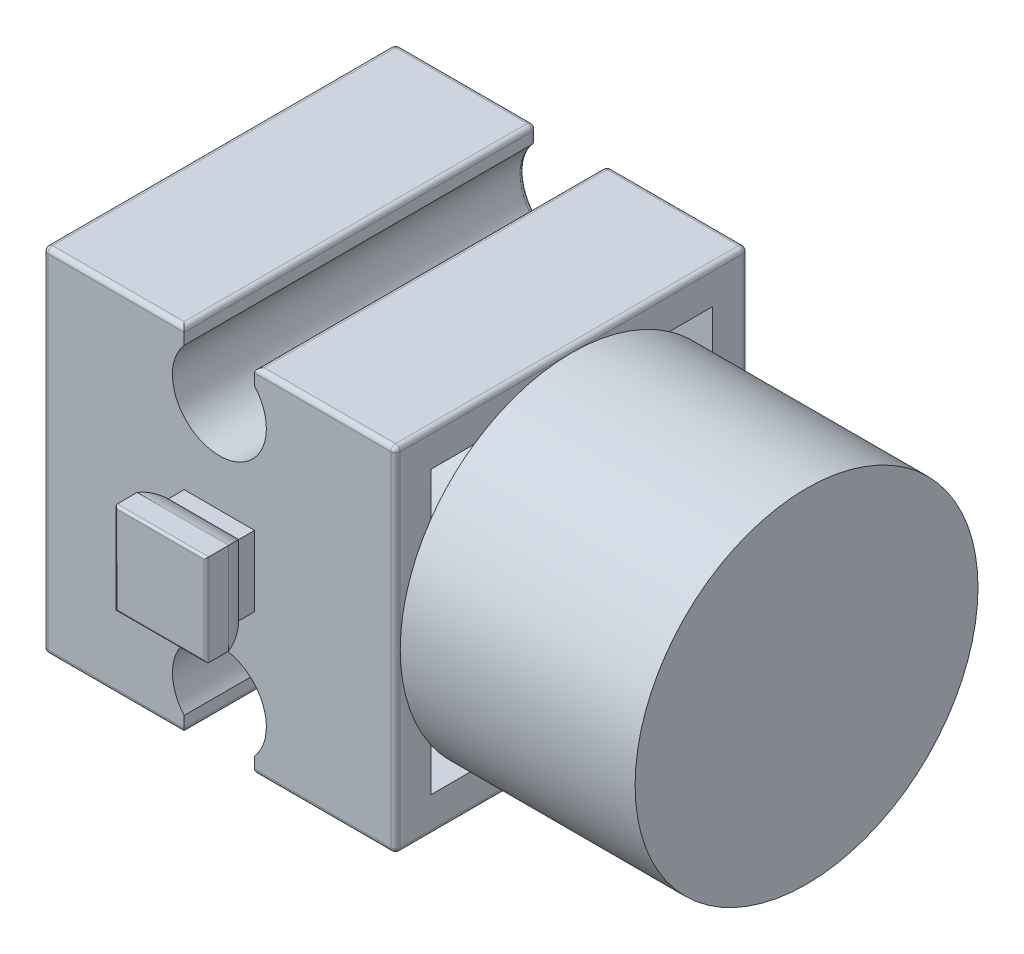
ISO-10303-21;
HEADER;
FILE_DESCRIPTION(('STEP AP214'),'2;1');
FILE_NAME('part.step','',(''),(''),'','','');
FILE_SCHEMA(('AUTOMOTIVE_DESIGN { 1 0 10303 214 1 1 1 1 }'));
ENDSEC;
DATA;
#1=APPLICATION_CONTEXT('core data for automotive mechanical design processes');
#2=APPLICATION_PROTOCOL_DEFINITION('international standard','automotive_design',2000,#1);
#3=PRODUCT_CONTEXT('',#1,'mechanical');
#4=PRODUCT('Part','Part','',(#3));
#5=PRODUCT_RELATED_PRODUCT_CATEGORY('part','',(#4));
#6=PRODUCT_DEFINITION_FORMATION('','',#4);
#7=PRODUCT_DEFINITION_CONTEXT('part definition',#1,'design');
#8=PRODUCT_DEFINITION('design','',#6,#7);
#9=PRODUCT_DEFINITION_SHAPE('','',#8);
#10=(LENGTH_UNIT() NAMED_UNIT(*) SI_UNIT(.MILLI.,.METRE.));
#11=(NAMED_UNIT(*) PLANE_ANGLE_UNIT() SI_UNIT($,.RADIAN.));
#12=(NAMED_UNIT(*) SI_UNIT($,.STERADIAN.) SOLID_ANGLE_UNIT());
#13=UNCERTAINTY_MEASURE_WITH_UNIT(LENGTH_MEASURE(1.E-05),#10,'distance_accuracy_value','');
#14=(GEOMETRIC_REPRESENTATION_CONTEXT(3) GLOBAL_UNCERTAINTY_ASSIGNED_CONTEXT((#13)) GLOBAL_UNIT_ASSIGNED_CONTEXT((#10,
#11,#12)) REPRESENTATION_CONTEXT('',''));
#15=CARTESIAN_POINT('',(0.,0.,0.));
#16=DIRECTION('',(0.,0.,1.));
#17=DIRECTION('',(1.,0.,0.));
#18=AXIS2_PLACEMENT_3D('',#15,#16,#17);
#19=CARTESIAN_POINT('',(-4.,0.,2.));
#20=DIRECTION('',(1.,0.,0.));
#21=DIRECTION('',(0.,0.,-1.));
#22=AXIS2_PLACEMENT_3D('',#19,#20,#21);
#23=CYLINDRICAL_SURFACE('',#22,2.);
#24=DIRECTION('',(1.,0.,0.));
#25=VECTOR('',#24,1.);
#26=CARTESIAN_POINT('',(-4.,-1.95,1.55559027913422));
#27=LINE('',#26,#25);
#28=CARTESIAN_POINT('',(-1.95,-1.95,1.55559027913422));
#29=VERTEX_POINT('',#28);
#30=CARTESIAN_POINT('',(1.95,-1.95,1.55559027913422));
#31=VERTEX_POINT('',#30);
#32=EDGE_CURVE('E132',#29,#31,#27,.T.);
#33=ORIENTED_EDGE('',*,*,#32,.F.);
#34=CARTESIAN_POINT('',(0.,0.,2.));
#35=DIRECTION('',(-0.707106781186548,0.707106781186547,0.));
#36=DIRECTION('',(0.707106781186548,0.707106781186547,0.));
#37=AXIS2_PLACEMENT_3D('',#34,#35,#36);
#38=ELLIPSE('',#37,2.82842712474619,2.);
#39=CARTESIAN_POINT('',(-1.5,-1.5,0.677124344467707));
#40=VERTEX_POINT('',#39);
#41=EDGE_CURVE('E116',#29,#40,#38,.F.);
#42=ORIENTED_EDGE('',*,*,#41,.T.);
#43=DIRECTION('',(1.,0.,0.));
#44=VECTOR('',#43,1.);
#45=CARTESIAN_POINT('',(-4.,-1.5,0.677124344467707));
#46=LINE('',#45,#44);
#47=CARTESIAN_POINT('',(1.5,-1.5,0.677124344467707));
#48=VERTEX_POINT('',#47);
#49=EDGE_CURVE('E130',#40,#48,#46,.T.);
#50=ORIENTED_EDGE('',*,*,#49,.T.);
#51=CARTESIAN_POINT('',(0.,0.,2.));
#52=DIRECTION('',(0.707106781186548,0.707106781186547,0.));
#53=DIRECTION('',(-0.707106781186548,0.707106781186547,0.));
#54=AXIS2_PLACEMENT_3D('',#51,#52,#53);
#55=ELLIPSE('',#54,2.82842712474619,2.);
#56=EDGE_CURVE('E174',#48,#31,#55,.F.);
#57=ORIENTED_EDGE('',*,*,#56,.T.);
#58=EDGE_LOOP('',(#33,#42,#50,#57));
#59=FACE_BOUND('',#58,.T.);
#60=ADVANCED_FACE('F46',(#59),#23,.T.);
#61=CARTESIAN_POINT('',(-4.,-1.95,2.5));
#62=DIRECTION('',(0.,-1.,0.));
#63=DIRECTION('',(0.,0.,-1.));
#64=AXIS2_PLACEMENT_3D('',#61,#62,#63);
#65=PLANE('',#64);
#66=DIRECTION('',(0.,0.,1.));
#67=VECTOR('',#66,1.);
#68=CARTESIAN_POINT('',(1.95,-1.95,2.5));
#69=LINE('',#68,#67);
#70=CARTESIAN_POINT('',(1.95,-1.95,2.4));
#71=VERTEX_POINT('',#70);
#72=EDGE_CURVE('E169',#31,#71,#69,.T.);
#73=ORIENTED_EDGE('',*,*,#72,.T.);
#74=DIRECTION('',(1.,0.,0.));
#75=VECTOR('',#74,1.);
#76=CARTESIAN_POINT('',(-4.,-1.95,2.4));
#77=LINE('',#76,#75);
#78=CARTESIAN_POINT('',(-1.95,-1.95,2.4));
#79=VERTEX_POINT('',#78);
#80=EDGE_CURVE('E70',#71,#79,#77,.F.);
#81=ORIENTED_EDGE('',*,*,#80,.T.);
#82=DIRECTION('',(0.,0.,-1.));
#83=VECTOR('',#82,1.);
#84=CARTESIAN_POINT('',(-1.95,-1.95,2.5));
#85=LINE('',#84,#83);
#86=EDGE_CURVE('E133',#79,#29,#85,.T.);
#87=ORIENTED_EDGE('',*,*,#86,.T.);
#88=ORIENTED_EDGE('',*,*,#32,.T.);
#89=EDGE_LOOP('',(#73,#81,#87,#88));
#90=FACE_BOUND('',#89,.T.);
#91=ADVANCED_FACE('F214',(#90),#65,.T.);
#92=CARTESIAN_POINT('',(-4.,1.95,2.5));
#93=DIRECTION('',(0.,0.,1.));
#94=DIRECTION('',(1.,0.,0.));
#95=AXIS2_PLACEMENT_3D('',#92,#93,#94);
#96=PLANE('',#95);
#97=DIRECTION('',(1.,0.,0.));
#98=VECTOR('',#97,1.);
#99=CARTESIAN_POINT('',(-4.,-1.85,2.5));
#100=LINE('',#99,#98);
#101=CARTESIAN_POINT('',(-1.85,-1.85,2.5));
#102=VERTEX_POINT('',#101);
#103=CARTESIAN_POINT('',(1.85,-1.85,2.5));
#104=VERTEX_POINT('',#103);
#105=EDGE_CURVE('E153',#102,#104,#100,.T.);
#106=ORIENTED_EDGE('',*,*,#105,.T.);
#107=DIRECTION('',(0.,-1.,0.));
#108=VECTOR('',#107,1.);
#109=CARTESIAN_POINT('',(1.85,1.95,2.5));
#110=LINE('',#109,#108);
#111=CARTESIAN_POINT('',(1.85,1.85,2.5));
#112=VERTEX_POINT('',#111);
#113=EDGE_CURVE('E155',#104,#112,#110,.F.);
#114=ORIENTED_EDGE('',*,*,#113,.T.);
#115=DIRECTION('',(1.,0.,0.));
#116=VECTOR('',#115,1.);
#117=CARTESIAN_POINT('',(-4.,1.85,2.5));
#118=LINE('',#117,#116);
#119=CARTESIAN_POINT('',(-1.85,1.85,2.5));
#120=VERTEX_POINT('',#119);
#121=EDGE_CURVE('E149',#112,#120,#118,.F.);
#122=ORIENTED_EDGE('',*,*,#121,.T.);
#123=DIRECTION('',(0.,-1.,0.));
#124=VECTOR('',#123,1.);
#125=CARTESIAN_POINT('',(-1.85,1.95,2.5));
#126=LINE('',#125,#124);
#127=EDGE_CURVE('E151',#120,#102,#126,.T.);
#128=ORIENTED_EDGE('',*,*,#127,.T.);
#129=EDGE_LOOP('',(#106,#114,#122,#128));
#130=FACE_BOUND('',#129,.T.);
#131=ADVANCED_FACE('F219',(#130),#96,.T.);
#132=CARTESIAN_POINT('',(-4.,1.95,2.5));
#133=DIRECTION('',(0.,1.,0.));
#134=DIRECTION('',(0.,0.,1.));
#135=AXIS2_PLACEMENT_3D('',#132,#133,#134);
#136=PLANE('',#135);
#137=DIRECTION('',(0.,0.,-1.));
#138=VECTOR('',#137,1.);
#139=CARTESIAN_POINT('',(-1.95,1.95,2.5));
#140=LINE('',#139,#138);
#141=CARTESIAN_POINT('',(-1.95,1.95,2.4));
#142=VERTEX_POINT('',#141);
#143=CARTESIAN_POINT('',(-1.95,1.95,1.55559027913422));
#144=VERTEX_POINT('',#143);
#145=EDGE_CURVE('E125',#142,#144,#140,.T.);
#146=ORIENTED_EDGE('',*,*,#145,.F.);
#147=DIRECTION('',(1.,0.,0.));
#148=VECTOR('',#147,1.);
#149=CARTESIAN_POINT('',(-4.,1.95,2.4));
#150=LINE('',#149,#148);
#151=CARTESIAN_POINT('',(1.95,1.95,2.4));
#152=VERTEX_POINT('',#151);
#153=EDGE_CURVE('E12',#142,#152,#150,.T.);
#154=ORIENTED_EDGE('',*,*,#153,.T.);
#155=DIRECTION('',(0.,0.,1.));
#156=VECTOR('',#155,1.);
#157=CARTESIAN_POINT('',(1.95,1.95,2.5));
#158=LINE('',#157,#156);
#159=CARTESIAN_POINT('',(1.95,1.95,1.55559027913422));
#160=VERTEX_POINT('',#159);
#161=EDGE_CURVE('E185',#160,#152,#158,.T.);
#162=ORIENTED_EDGE('',*,*,#161,.F.);
#163=DIRECTION('',(1.,0.,0.));
#164=VECTOR('',#163,1.);
#165=CARTESIAN_POINT('',(-4.,1.95,1.55559027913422));
#166=LINE('',#165,#164);
#167=EDGE_CURVE('E140',#144,#160,#166,.T.);
#168=ORIENTED_EDGE('',*,*,#167,.F.);
#169=EDGE_LOOP('',(#146,#154,#162,#168));
#170=FACE_BOUND('',#169,.T.);
#171=ADVANCED_FACE('F195',(#170),#136,.T.);
#172=CARTESIAN_POINT('',(-4.,0.,2.));
#173=DIRECTION('',(1.,0.,0.));
#174=DIRECTION('',(0.,0.,-1.));
#175=AXIS2_PLACEMENT_3D('',#172,#173,#174);
#176=CYLINDRICAL_SURFACE('',#175,2.);
#177=DIRECTION('',(1.,0.,0.));
#178=VECTOR('',#177,1.);
#179=CARTESIAN_POINT('',(-4.,1.5,0.677124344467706));
#180=LINE('',#179,#178);
#181=CARTESIAN_POINT('',(-1.5,1.5,0.677124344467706));
#182=VERTEX_POINT('',#181);
#183=CARTESIAN_POINT('',(1.5,1.5,0.677124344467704));
#184=VERTEX_POINT('',#183);
#185=EDGE_CURVE('E138',#182,#184,#180,.T.);
#186=ORIENTED_EDGE('',*,*,#185,.F.);
#187=CARTESIAN_POINT('',(0.,0.,2.));
#188=DIRECTION('',(-0.707106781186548,-0.707106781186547,0.));
#189=DIRECTION('',(0.707106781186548,-0.707106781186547,0.));
#190=AXIS2_PLACEMENT_3D('',#187,#188,#189);
#191=ELLIPSE('',#190,2.82842712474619,2.);
#192=EDGE_CURVE('E119',#144,#182,#191,.T.);
#193=ORIENTED_EDGE('',*,*,#192,.F.);
#194=ORIENTED_EDGE('',*,*,#167,.T.);
#195=CARTESIAN_POINT('',(0.,0.,2.));
#196=DIRECTION('',(0.707106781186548,-0.707106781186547,0.));
#197=DIRECTION('',(-0.707106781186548,-0.707106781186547,0.));
#198=AXIS2_PLACEMENT_3D('',#195,#196,#197);
#199=ELLIPSE('',#198,2.82842712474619,2.);
#200=EDGE_CURVE('E177',#184,#160,#199,.T.);
#201=ORIENTED_EDGE('',*,*,#200,.F.);
#202=EDGE_LOOP('',(#186,#193,#194,#201));
#203=FACE_BOUND('',#202,.T.);
#204=ADVANCED_FACE('F192',(#203),#176,.T.);
#205=CARTESIAN_POINT('',(-4.,1.5,0.677124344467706));
#206=DIRECTION('',(0.,0.,-1.));
#207=DIRECTION('',(0.,1.,0.));
#208=AXIS2_PLACEMENT_3D('',#205,#206,#207);
#209=PLANE('',#208);
#210=ORIENTED_EDGE('',*,*,#49,.F.);
#211=DIRECTION('',(0.,-1.,0.));
#212=VECTOR('',#211,1.);
#213=CARTESIAN_POINT('',(-1.5,7.501,0.677124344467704));
#214=LINE('',#213,#212);
#215=EDGE_CURVE('E112',#182,#40,#214,.T.);
#216=ORIENTED_EDGE('',*,*,#215,.F.);
#217=ORIENTED_EDGE('',*,*,#185,.T.);
#218=DIRECTION('',(0.,-1.,0.));
#219=VECTOR('',#218,1.);
#220=CARTESIAN_POINT('',(1.5,7.501,0.677124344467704));
#221=LINE('',#220,#219);
#222=EDGE_CURVE('E137',#184,#48,#221,.T.);
#223=ORIENTED_EDGE('',*,*,#222,.T.);
#224=EDGE_LOOP('',(#210,#216,#217,#223));
#225=FACE_BOUND('',#224,.T.);
#226=ADVANCED_FACE('F136',(#225),#209,.T.);
#227=CARTESIAN_POINT('',(0.,7.501,2.));
#228=DIRECTION('',(0.,-1.,0.));
#229=DIRECTION('',(0.,0.,-1.));
#230=AXIS2_PLACEMENT_3D('',#227,#228,#229);
#231=CYLINDRICAL_SURFACE('',#230,2.);
#232=ORIENTED_EDGE('',*,*,#200,.T.);
#233=DIRECTION('',(0.,-1.,0.));
#234=VECTOR('',#233,1.);
#235=CARTESIAN_POINT('',(1.95,7.501,1.55559027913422));
#236=LINE('',#235,#234);
#237=EDGE_CURVE('E182',#160,#31,#236,.T.);
#238=ORIENTED_EDGE('',*,*,#237,.T.);
#239=ORIENTED_EDGE('',*,*,#56,.F.);
#240=ORIENTED_EDGE('',*,*,#222,.F.);
#241=EDGE_LOOP('',(#232,#238,#239,#240));
#242=FACE_BOUND('',#241,.T.);
#243=ADVANCED_FACE('F224',(#242),#231,.T.);
#244=CARTESIAN_POINT('',(1.95,7.501,2.5));
#245=DIRECTION('',(1.,0.,0.));
#246=DIRECTION('',(0.,0.,-1.));
#247=AXIS2_PLACEMENT_3D('',#244,#245,#246);
#248=PLANE('',#247);
#249=ORIENTED_EDGE('',*,*,#161,.T.);
#250=DIRECTION('',(0.,-1.,0.));
#251=VECTOR('',#250,1.);
#252=CARTESIAN_POINT('',(1.95,7.501,2.4));
#253=LINE('',#252,#251);
#254=EDGE_CURVE('E146',#152,#71,#253,.T.);
#255=ORIENTED_EDGE('',*,*,#254,.T.);
#256=ORIENTED_EDGE('',*,*,#72,.F.);
#257=ORIENTED_EDGE('',*,*,#237,.F.);
#258=EDGE_LOOP('',(#249,#255,#256,#257));
#259=FACE_BOUND('',#258,.T.);
#260=ADVANCED_FACE('F198',(#259),#248,.T.);
#261=CARTESIAN_POINT('',(-1.95,7.501,2.5));
#262=DIRECTION('',(-1.,0.,0.));
#263=DIRECTION('',(0.,0.,1.));
#264=AXIS2_PLACEMENT_3D('',#261,#262,#263);
#265=PLANE('',#264);
#266=ORIENTED_EDGE('',*,*,#86,.F.);
#267=DIRECTION('',(0.,-1.,0.));
#268=VECTOR('',#267,1.);
#269=CARTESIAN_POINT('',(-1.95,7.501,2.4));
#270=LINE('',#269,#268);
#271=EDGE_CURVE('E55',#79,#142,#270,.F.);
#272=ORIENTED_EDGE('',*,*,#271,.T.);
#273=ORIENTED_EDGE('',*,*,#145,.T.);
#274=DIRECTION('',(0.,-1.,0.));
#275=VECTOR('',#274,1.);
#276=CARTESIAN_POINT('',(-1.95,7.501,1.55559027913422));
#277=LINE('',#276,#275);
#278=EDGE_CURVE('E124',#144,#29,#277,.T.);
#279=ORIENTED_EDGE('',*,*,#278,.T.);
#280=EDGE_LOOP('',(#266,#272,#273,#279));
#281=FACE_BOUND('',#280,.T.);
#282=ADVANCED_FACE('F237',(#281),#265,.T.);
#283=CARTESIAN_POINT('',(0.,7.501,2.));
#284=DIRECTION('',(0.,-1.,0.));
#285=DIRECTION('',(0.,0.,-1.));
#286=AXIS2_PLACEMENT_3D('',#283,#284,#285);
#287=CYLINDRICAL_SURFACE('',#286,2.);
#288=ORIENTED_EDGE('',*,*,#192,.T.);
#289=ORIENTED_EDGE('',*,*,#215,.T.);
#290=ORIENTED_EDGE('',*,*,#41,.F.);
#291=ORIENTED_EDGE('',*,*,#278,.F.);
#292=EDGE_LOOP('',(#288,#289,#290,#291));
#293=FACE_BOUND('',#292,.T.);
#294=ADVANCED_FACE('F114',(#293),#287,.T.);
#295=CARTESIAN_POINT('',(-1.85,1.95,2.4));
#296=DIRECTION('',(0.,-1.,0.));
#297=DIRECTION('',(0.,0.,-1.));
#298=AXIS2_PLACEMENT_3D('',#295,#296,#297);
#299=CYLINDRICAL_SURFACE('',#298,0.1);
#300=CARTESIAN_POINT('',(-1.85,-1.85,2.4));
#301=DIRECTION('',(0.707106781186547,-0.707106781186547,0.));
#302=DIRECTION('',(-0.707106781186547,-0.707106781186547,0.));
#303=AXIS2_PLACEMENT_3D('',#300,#301,#302);
#304=ELLIPSE('',#303,0.14142135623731,0.1);
#305=EDGE_CURVE('E163',#102,#79,#304,.T.);
#306=ORIENTED_EDGE('',*,*,#305,.F.);
#307=ORIENTED_EDGE('',*,*,#127,.F.);
#308=CARTESIAN_POINT('',(-1.85,1.85,2.4));
#309=DIRECTION('',(0.707106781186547,0.707106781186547,0.));
#310=DIRECTION('',(0.707106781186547,-0.707106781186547,0.));
#311=AXIS2_PLACEMENT_3D('',#308,#309,#310);
#312=ELLIPSE('',#311,0.14142135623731,0.1);
#313=EDGE_CURVE('E50',#142,#120,#312,.T.);
#314=ORIENTED_EDGE('',*,*,#313,.F.);
#315=ORIENTED_EDGE('',*,*,#271,.F.);
#316=EDGE_LOOP('',(#306,#307,#314,#315));
#317=FACE_BOUND('',#316,.T.);
#318=ADVANCED_FACE('F48',(#317),#299,.T.);
#319=CARTESIAN_POINT('',(-4.,1.85,2.4));
#320=DIRECTION('',(1.,0.,0.));
#321=DIRECTION('',(0.,0.,-1.));
#322=AXIS2_PLACEMENT_3D('',#319,#320,#321);
#323=CYLINDRICAL_SURFACE('',#322,0.1);
#324=ORIENTED_EDGE('',*,*,#313,.T.);
#325=ORIENTED_EDGE('',*,*,#121,.F.);
#326=CARTESIAN_POINT('',(1.85,1.85,2.4));
#327=DIRECTION('',(0.707106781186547,-0.707106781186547,0.));
#328=DIRECTION('',(0.707106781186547,0.707106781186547,0.));
#329=AXIS2_PLACEMENT_3D('',#326,#327,#328);
#330=ELLIPSE('',#329,0.14142135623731,0.1);
#331=EDGE_CURVE('E162',#152,#112,#330,.T.);
#332=ORIENTED_EDGE('',*,*,#331,.F.);
#333=ORIENTED_EDGE('',*,*,#153,.F.);
#334=EDGE_LOOP('',(#324,#325,#332,#333));
#335=FACE_BOUND('',#334,.T.);
#336=ADVANCED_FACE('F200',(#335),#323,.T.);
#337=CARTESIAN_POINT('',(-4.,-1.85,2.4));
#338=DIRECTION('',(1.,0.,0.));
#339=DIRECTION('',(0.,0.,-1.));
#340=AXIS2_PLACEMENT_3D('',#337,#338,#339);
#341=CYLINDRICAL_SURFACE('',#340,0.1);
#342=ORIENTED_EDGE('',*,*,#305,.T.);
#343=ORIENTED_EDGE('',*,*,#80,.F.);
#344=CARTESIAN_POINT('',(1.85,-1.85,2.4));
#345=DIRECTION('',(0.707106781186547,0.707106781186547,0.));
#346=DIRECTION('',(0.707106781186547,-0.707106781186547,0.));
#347=AXIS2_PLACEMENT_3D('',#344,#345,#346);
#348=ELLIPSE('',#347,0.14142135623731,0.1);
#349=EDGE_CURVE('E160',#104,#71,#348,.T.);
#350=ORIENTED_EDGE('',*,*,#349,.F.);
#351=ORIENTED_EDGE('',*,*,#105,.F.);
#352=EDGE_LOOP('',(#342,#343,#350,#351));
#353=FACE_BOUND('',#352,.T.);
#354=ADVANCED_FACE('F205',(#353),#341,.T.);
#355=CARTESIAN_POINT('',(1.85,7.501,2.4));
#356=DIRECTION('',(0.,-1.,0.));
#357=DIRECTION('',(0.,0.,-1.));
#358=AXIS2_PLACEMENT_3D('',#355,#356,#357);
#359=CYLINDRICAL_SURFACE('',#358,0.1);
#360=ORIENTED_EDGE('',*,*,#331,.T.);
#361=ORIENTED_EDGE('',*,*,#113,.F.);
#362=ORIENTED_EDGE('',*,*,#349,.T.);
#363=ORIENTED_EDGE('',*,*,#254,.F.);
#364=EDGE_LOOP('',(#360,#361,#362,#363));
#365=FACE_BOUND('',#364,.T.);
#366=ADVANCED_FACE('F203',(#365),#359,.T.);
#367=CLOSED_SHELL('',(#60,#91,#131,#171,#204,#226,#243,#260,#282,#294,#318,#336,#354,#366));
#368=MANIFOLD_SOLID_BREP('B2',#367);
#369=CARTESIAN_POINT('',(7.5,-7.5,-15.));
#370=DIRECTION('',(1.,0.,0.));
#371=DIRECTION('',(0.,0.,-1.));
#372=AXIS2_PLACEMENT_3D('',#369,#370,#371);
#373=PLANE('',#372);
#374=DIRECTION('',(0.,0.,-1.));
#375=VECTOR('',#374,1.);
#376=CARTESIAN_POINT('',(7.5,-6.,-13.5));
#377=LINE('',#376,#375);
#378=CARTESIAN_POINT('',(7.5,-6.,-11.6581245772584));
#379=VERTEX_POINT('',#378);
#380=CARTESIAN_POINT('',(7.5,-6.,-13.5));
#381=VERTEX_POINT('',#380);
#382=EDGE_CURVE('E1572',#379,#381,#377,.T.);
#383=ORIENTED_EDGE('',*,*,#382,.F.);
#384=CARTESIAN_POINT('',(7.5,0.,-7.5));
#385=DIRECTION('',(1.,0.,0.));
#386=DIRECTION('',(0.,0.,-1.));
#387=AXIS2_PLACEMENT_3D('',#384,#385,#386);
#388=CIRCLE('',#387,7.3);
#389=CARTESIAN_POINT('',(7.5,-7.3,-7.5));
#390=VERTEX_POINT('',#389);
#391=EDGE_CURVE('E3189',#390,#379,#388,.T.);
#392=ORIENTED_EDGE('',*,*,#391,.F.);
#393=DIRECTION('',(0.,0.,1.));
#394=VECTOR('',#393,1.);
#395=CARTESIAN_POINT('',(7.5,-7.3,-15.));
#396=LINE('',#395,#394);
#397=CARTESIAN_POINT('',(7.5,-7.3,-14.8));
#398=VERTEX_POINT('',#397);
#399=EDGE_CURVE('E918',#390,#398,#396,.F.);
#400=ORIENTED_EDGE('',*,*,#399,.T.);
#401=DIRECTION('',(0.,1.,0.));
#402=VECTOR('',#401,1.);
#403=CARTESIAN_POINT('',(7.5,-7.5,-14.8));
#404=LINE('',#403,#402);
#405=CARTESIAN_POINT('',(7.5,0.,-14.8));
#406=VERTEX_POINT('',#405);
#407=EDGE_CURVE('E908',#398,#406,#404,.T.);
#408=ORIENTED_EDGE('',*,*,#407,.T.);
#409=CARTESIAN_POINT('',(7.5,-4.1581245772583,-13.5));
#410=VERTEX_POINT('',#409);
#411=EDGE_CURVE('E880',#410,#406,#388,.T.);
#412=ORIENTED_EDGE('',*,*,#411,.F.);
#413=DIRECTION('',(0.,1.,0.));
#414=VECTOR('',#413,1.);
#415=CARTESIAN_POINT('',(7.5,-0.499999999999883,-13.5000000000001));
#416=LINE('',#415,#414);
#417=EDGE_CURVE('E1534',#381,#410,#416,.T.);
#418=ORIENTED_EDGE('',*,*,#417,.F.);
#419=EDGE_LOOP('',(#383,#392,#400,#408,#412,#418));
#420=FACE_BOUND('',#419,.T.);
#421=ADVANCED_FACE('F331',(#420),#373,.T.);
#422=CARTESIAN_POINT('',(7.5,-7.3,-0.2));
#423=VERTEX_POINT('',#422);
#424=EDGE_CURVE('E1429',#423,#390,#396,.F.);
#425=ORIENTED_EDGE('',*,*,#424,.T.);
#426=CARTESIAN_POINT('',(7.5,-6.,-3.34187542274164));
#427=VERTEX_POINT('',#426);
#428=EDGE_CURVE('E3191',#427,#390,#388,.T.);
#429=ORIENTED_EDGE('',*,*,#428,.F.);
#430=DIRECTION('',(0.,0.,-1.));
#431=VECTOR('',#430,1.);
#432=CARTESIAN_POINT('',(7.5,-6.,-7.00000000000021));
#433=LINE('',#432,#431);
#434=CARTESIAN_POINT('',(7.5,-6.,-1.5));
#435=VERTEX_POINT('',#434);
#436=EDGE_CURVE('E1520',#435,#427,#433,.T.);
#437=ORIENTED_EDGE('',*,*,#436,.F.);
#438=DIRECTION('',(0.,-1.,0.));
#439=VECTOR('',#438,1.);
#440=CARTESIAN_POINT('',(7.5,-0.500000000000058,-1.50000000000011));
#441=LINE('',#440,#439);
#442=CARTESIAN_POINT('',(7.5,-4.15812457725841,-1.50000000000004));
#443=VERTEX_POINT('',#442);
#444=EDGE_CURVE('E355',#443,#435,#441,.T.);
#445=ORIENTED_EDGE('',*,*,#444,.F.);
#446=CARTESIAN_POINT('',(7.5,0.,-0.2));
#447=VERTEX_POINT('',#446);
#448=EDGE_CURVE('E1465',#447,#443,#388,.T.);
#449=ORIENTED_EDGE('',*,*,#448,.F.);
#450=DIRECTION('',(0.,1.,0.));
#451=VECTOR('',#450,1.);
#452=CARTESIAN_POINT('',(7.5,-7.5,-0.2));
#453=LINE('',#452,#451);
#454=EDGE_CURVE('E1426',#447,#423,#453,.F.);
#455=ORIENTED_EDGE('',*,*,#454,.T.);
#456=EDGE_LOOP('',(#425,#429,#437,#445,#449,#455));
#457=FACE_BOUND('',#456,.T.);
#458=ADVANCED_FACE('F1766',(#457),#373,.T.);
#459=CARTESIAN_POINT('',(7.5,7.3,-0.2));
#460=VERTEX_POINT('',#459);
#461=EDGE_CURVE('E1427',#460,#447,#453,.F.);
#462=ORIENTED_EDGE('',*,*,#461,.T.);
#463=CARTESIAN_POINT('',(7.5,4.15812457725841,-1.50000000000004));
#464=VERTEX_POINT('',#463);
#465=EDGE_CURVE('E1458',#464,#447,#388,.T.);
#466=ORIENTED_EDGE('',*,*,#465,.F.);
#467=DIRECTION('',(0.,-1.,0.));
#468=VECTOR('',#467,1.);
#469=CARTESIAN_POINT('',(7.5,6.,-1.5));
#470=LINE('',#469,#468);
#471=CARTESIAN_POINT('',(7.5,6.,-1.5));
#472=VERTEX_POINT('',#471);
#473=EDGE_CURVE('E1460',#472,#464,#470,.T.);
#474=ORIENTED_EDGE('',*,*,#473,.F.);
#475=DIRECTION('',(0.,0.,1.));
#476=VECTOR('',#475,1.);
#477=CARTESIAN_POINT('',(7.5,6.,-7.));
#478=LINE('',#477,#476);
#479=CARTESIAN_POINT('',(7.5,6.,-3.34187542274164));
#480=VERTEX_POINT('',#479);
#481=EDGE_CURVE('E347',#480,#472,#478,.T.);
#482=ORIENTED_EDGE('',*,*,#481,.F.);
#483=CARTESIAN_POINT('',(7.5,7.3,-7.5));
#484=VERTEX_POINT('',#483);
#485=EDGE_CURVE('E3171',#484,#480,#388,.T.);
#486=ORIENTED_EDGE('',*,*,#485,.F.);
#487=DIRECTION('',(0.,0.,1.));
#488=VECTOR('',#487,1.);
#489=CARTESIAN_POINT('',(7.5,7.3,-15.));
#490=LINE('',#489,#488);
#491=EDGE_CURVE('E1431',#484,#460,#490,.T.);
#492=ORIENTED_EDGE('',*,*,#491,.T.);
#493=EDGE_LOOP('',(#462,#466,#474,#482,#486,#492));
#494=FACE_BOUND('',#493,.T.);
#495=ADVANCED_FACE('F1456',(#494),#373,.T.);
#496=CARTESIAN_POINT('',(7.5,7.3,-14.8));
#497=VERTEX_POINT('',#496);
#498=EDGE_CURVE('E913',#497,#484,#490,.T.);
#499=ORIENTED_EDGE('',*,*,#498,.T.);
#500=CARTESIAN_POINT('',(7.5,6.,-11.6581245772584));
#501=VERTEX_POINT('',#500);
#502=EDGE_CURVE('E1440',#501,#484,#388,.T.);
#503=ORIENTED_EDGE('',*,*,#502,.F.);
#504=DIRECTION('',(0.,0.,1.));
#505=VECTOR('',#504,1.);
#506=CARTESIAN_POINT('',(7.5,6.,-13.5));
#507=LINE('',#506,#505);
#508=CARTESIAN_POINT('',(7.5,6.,-13.5));
#509=VERTEX_POINT('',#508);
#510=EDGE_CURVE('E1594',#509,#501,#507,.T.);
#511=ORIENTED_EDGE('',*,*,#510,.F.);
#512=DIRECTION('',(0.,1.,0.));
#513=VECTOR('',#512,1.);
#514=CARTESIAN_POINT('',(7.5,6.,-13.5));
#515=LINE('',#514,#513);
#516=CARTESIAN_POINT('',(7.5,4.1581245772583,-13.5));
#517=VERTEX_POINT('',#516);
#518=EDGE_CURVE('E900',#517,#509,#515,.T.);
#519=ORIENTED_EDGE('',*,*,#518,.F.);
#520=EDGE_CURVE('E884',#406,#517,#388,.T.);
#521=ORIENTED_EDGE('',*,*,#520,.F.);
#522=EDGE_CURVE('E897',#406,#497,#404,.T.);
#523=ORIENTED_EDGE('',*,*,#522,.T.);
#524=EDGE_LOOP('',(#499,#503,#511,#519,#521,#523));
#525=FACE_BOUND('',#524,.T.);
#526=ADVANCED_FACE('F896',(#525),#373,.T.);
#527=CARTESIAN_POINT('',(-7.5,7.5,-15.));
#528=DIRECTION('',(0.,0.,-1.));
#529=DIRECTION('',(-1.,0.,0.));
#530=AXIS2_PLACEMENT_3D('',#527,#528,#529);
#531=PLANE('',#530);
#532=DIRECTION('',(0.,1.,0.));
#533=VECTOR('',#532,1.);
#534=CARTESIAN_POINT('',(1.7,-6.8228756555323,-15.));
#535=LINE('',#534,#533);
#536=CARTESIAN_POINT('',(1.7,-7.3,-15.));
#537=VERTEX_POINT('',#536);
#538=CARTESIAN_POINT('',(1.7,-6.896424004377,-15.));
#539=VERTEX_POINT('',#538);
#540=EDGE_CURVE('E1017',#537,#539,#535,.T.);
#541=ORIENTED_EDGE('',*,*,#540,.T.);
#542=CARTESIAN_POINT('',(0.,-5.5,-15.));
#543=DIRECTION('',(0.,0.,-1.));
#544=DIRECTION('',(-1.,0.,0.));
#545=AXIS2_PLACEMENT_3D('',#542,#543,#544);
#546=CIRCLE('',#545,2.2);
#547=CARTESIAN_POINT('',(-1.7,-6.896424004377,-15.));
#548=VERTEX_POINT('',#547);
#549=EDGE_CURVE('E1019',#539,#548,#546,.F.);
#550=ORIENTED_EDGE('',*,*,#549,.T.);
#551=DIRECTION('',(0.,-1.,0.));
#552=VECTOR('',#551,1.);
#553=CARTESIAN_POINT('',(-1.7,-7.5,-15.));
#554=LINE('',#553,#552);
#555=CARTESIAN_POINT('',(-1.7,-7.3,-15.));
#556=VERTEX_POINT('',#555);
#557=EDGE_CURVE('E997',#548,#556,#554,.T.);
#558=ORIENTED_EDGE('',*,*,#557,.T.);
#559=DIRECTION('',(1.,0.,0.));
#560=VECTOR('',#559,1.);
#561=CARTESIAN_POINT('',(-7.5,-7.3,-15.));
#562=LINE('',#561,#560);
#563=CARTESIAN_POINT('',(-7.3,-7.3,-15.));
#564=VERTEX_POINT('',#563);
#565=EDGE_CURVE('E999',#556,#564,#562,.F.);
#566=ORIENTED_EDGE('',*,*,#565,.T.);
#567=DIRECTION('',(0.,-1.,0.));
#568=VECTOR('',#567,1.);
#569=CARTESIAN_POINT('',(-7.3,7.5,-15.));
#570=LINE('',#569,#568);
#571=CARTESIAN_POINT('',(-7.3,7.3,-15.));
#572=VERTEX_POINT('',#571);
#573=EDGE_CURVE('E1001',#564,#572,#570,.F.);
#574=ORIENTED_EDGE('',*,*,#573,.T.);
#575=DIRECTION('',(-1.,0.,0.));
#576=VECTOR('',#575,1.);
#577=CARTESIAN_POINT('',(-7.5,7.3,-15.));
#578=LINE('',#577,#576);
#579=CARTESIAN_POINT('',(-1.7,7.3,-15.));
#580=VERTEX_POINT('',#579);
#581=EDGE_CURVE('E1003',#572,#580,#578,.F.);
#582=ORIENTED_EDGE('',*,*,#581,.T.);
#583=DIRECTION('',(0.,-1.,0.));
#584=VECTOR('',#583,1.);
#585=CARTESIAN_POINT('',(-1.7,6.82287565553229,-15.));
#586=LINE('',#585,#584);
#587=CARTESIAN_POINT('',(-1.7,6.896424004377,-15.));
#588=VERTEX_POINT('',#587);
#589=EDGE_CURVE('E1005',#580,#588,#586,.T.);
#590=ORIENTED_EDGE('',*,*,#589,.T.);
#591=CARTESIAN_POINT('',(0.,5.5,-15.));
#592=DIRECTION('',(0.,0.,-1.));
#593=DIRECTION('',(-1.,0.,0.));
#594=AXIS2_PLACEMENT_3D('',#591,#592,#593);
#595=CIRCLE('',#594,2.2);
#596=CARTESIAN_POINT('',(1.69999999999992,6.896424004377,-15.));
#597=VERTEX_POINT('',#596);
#598=EDGE_CURVE('E1007',#588,#597,#595,.F.);
#599=ORIENTED_EDGE('',*,*,#598,.T.);
#600=DIRECTION('',(0.,1.,0.));
#601=VECTOR('',#600,1.);
#602=CARTESIAN_POINT('',(1.7,7.5,-15.));
#603=LINE('',#602,#601);
#604=CARTESIAN_POINT('',(1.7,7.3,-15.));
#605=VERTEX_POINT('',#604);
#606=EDGE_CURVE('E1009',#597,#605,#603,.T.);
#607=ORIENTED_EDGE('',*,*,#606,.T.);
#608=DIRECTION('',(-1.,0.,0.));
#609=VECTOR('',#608,1.);
#610=CARTESIAN_POINT('',(-7.5,7.3,-15.));
#611=LINE('',#610,#609);
#612=CARTESIAN_POINT('',(7.3,7.3,-15.));
#613=VERTEX_POINT('',#612);
#614=EDGE_CURVE('E1011',#605,#613,#611,.F.);
#615=ORIENTED_EDGE('',*,*,#614,.T.);
#616=DIRECTION('',(0.,1.,0.));
#617=VECTOR('',#616,1.);
#618=CARTESIAN_POINT('',(7.3,7.5,-15.));
#619=LINE('',#618,#617);
#620=CARTESIAN_POINT('',(7.3,-7.3,-15.));
#621=VERTEX_POINT('',#620);
#622=EDGE_CURVE('E1013',#613,#621,#619,.F.);
#623=ORIENTED_EDGE('',*,*,#622,.T.);
#624=DIRECTION('',(1.,0.,0.));
#625=VECTOR('',#624,1.);
#626=CARTESIAN_POINT('',(-7.5,-7.3,-15.));
#627=LINE('',#626,#625);
#628=EDGE_CURVE('E1015',#621,#537,#627,.F.);
#629=ORIENTED_EDGE('',*,*,#628,.T.);
#630=EDGE_LOOP('',(#541,#550,#558,#566,#574,#582,#590,#599,#607,#615,#623,#629));
#631=FACE_BOUND('',#630,.T.);
#632=DIRECTION('',(-1.,0.,0.));
#633=VECTOR('',#632,1.);
#634=CARTESIAN_POINT('',(-1.5,1.5,-15.));
#635=LINE('',#634,#633);
#636=CARTESIAN_POINT('',(1.5,1.5,-15.));
#637=VERTEX_POINT('',#636);
#638=CARTESIAN_POINT('',(-1.5,1.5,-15.));
#639=VERTEX_POINT('',#638);
#640=EDGE_CURVE('E1707',#637,#639,#635,.T.);
#641=ORIENTED_EDGE('',*,*,#640,.T.);
#642=DIRECTION('',(0.,-1.,0.));
#643=VECTOR('',#642,1.);
#644=CARTESIAN_POINT('',(-1.5,-1.5,-15.));
#645=LINE('',#644,#643);
#646=CARTESIAN_POINT('',(-1.5,-1.5,-15.));
#647=VERTEX_POINT('',#646);
#648=EDGE_CURVE('E1029',#639,#647,#645,.T.);
#649=ORIENTED_EDGE('',*,*,#648,.T.);
#650=DIRECTION('',(1.,0.,0.));
#651=VECTOR('',#650,1.);
#652=CARTESIAN_POINT('',(-1.5,-1.5,-15.));
#653=LINE('',#652,#651);
#654=CARTESIAN_POINT('',(1.5,-1.5,-15.));
#655=VERTEX_POINT('',#654);
#656=EDGE_CURVE('E1719',#647,#655,#653,.T.);
#657=ORIENTED_EDGE('',*,*,#656,.T.);
#658=DIRECTION('',(0.,1.,0.));
#659=VECTOR('',#658,1.);
#660=CARTESIAN_POINT('',(1.5,-1.5,-15.));
#661=LINE('',#660,#659);
#662=EDGE_CURVE('E1714',#655,#637,#661,.T.);
#663=ORIENTED_EDGE('',*,*,#662,.T.);
#664=EDGE_LOOP('',(#641,#649,#657,#663));
#665=FACE_BOUND('',#664,.T.);
#666=ADVANCED_FACE('F1728',(#631,#665),#531,.T.);
#667=CARTESIAN_POINT('',(-7.5,-7.5,-15.));
#668=DIRECTION('',(0.,-1.,0.));
#669=DIRECTION('',(0.,0.,-1.));
#670=AXIS2_PLACEMENT_3D('',#667,#668,#669);
#671=PLANE('',#670);
#672=DIRECTION('',(1.,0.,0.));
#673=VECTOR('',#672,1.);
#674=CARTESIAN_POINT('',(-7.5,-7.5,-0.2));
#675=LINE('',#674,#673);
#676=CARTESIAN_POINT('',(-1.7,-7.5,-0.2));
#677=VERTEX_POINT('',#676);
#678=CARTESIAN_POINT('',(-7.3,-7.5,-0.2));
#679=VERTEX_POINT('',#678);
#680=EDGE_CURVE('E988',#677,#679,#675,.F.);
#681=ORIENTED_EDGE('',*,*,#680,.T.);
#682=DIRECTION('',(0.,0.,1.));
#683=VECTOR('',#682,1.);
#684=CARTESIAN_POINT('',(-7.3,-7.5,-15.));
#685=LINE('',#684,#683);
#686=CARTESIAN_POINT('',(-7.3,-7.5,-14.8));
#687=VERTEX_POINT('',#686);
#688=EDGE_CURVE('E990',#679,#687,#685,.F.);
#689=ORIENTED_EDGE('',*,*,#688,.T.);
#690=DIRECTION('',(1.,0.,0.));
#691=VECTOR('',#690,1.);
#692=CARTESIAN_POINT('',(-7.5,-7.5,-14.8));
#693=LINE('',#692,#691);
#694=CARTESIAN_POINT('',(-1.7,-7.5,-14.8));
#695=VERTEX_POINT('',#694);
#696=EDGE_CURVE('E984',#687,#695,#693,.T.);
#697=ORIENTED_EDGE('',*,*,#696,.T.);
#698=DIRECTION('',(0.,0.,1.));
#699=VECTOR('',#698,1.);
#700=CARTESIAN_POINT('',(-1.7,-7.5,0.));
#701=LINE('',#700,#699);
#702=EDGE_CURVE('E986',#695,#677,#701,.T.);
#703=ORIENTED_EDGE('',*,*,#702,.T.);
#704=EDGE_LOOP('',(#681,#689,#697,#703));
#705=FACE_BOUND('',#704,.T.);
#706=ADVANCED_FACE('F1781',(#705),#671,.T.);
#707=CARTESIAN_POINT('',(-7.5,7.5,-15.));
#708=DIRECTION('',(0.,1.,0.));
#709=DIRECTION('',(0.,0.,1.));
#710=AXIS2_PLACEMENT_3D('',#707,#708,#709);
#711=PLANE('',#710);
#712=DIRECTION('',(0.,0.,1.));
#713=VECTOR('',#712,1.);
#714=CARTESIAN_POINT('',(-7.3,7.5,-15.));
#715=LINE('',#714,#713);
#716=CARTESIAN_POINT('',(-7.3,7.5,-14.8));
#717=VERTEX_POINT('',#716);
#718=CARTESIAN_POINT('',(-7.3,7.5,-0.2));
#719=VERTEX_POINT('',#718);
#720=EDGE_CURVE('E953',#717,#719,#715,.T.);
#721=ORIENTED_EDGE('',*,*,#720,.T.);
#722=DIRECTION('',(-1.,0.,0.));
#723=VECTOR('',#722,1.);
#724=CARTESIAN_POINT('',(-1.5,7.5,-0.2));
#725=LINE('',#724,#723);
#726=CARTESIAN_POINT('',(-1.7,7.5,-0.2));
#727=VERTEX_POINT('',#726);
#728=EDGE_CURVE('E955',#719,#727,#725,.F.);
#729=ORIENTED_EDGE('',*,*,#728,.T.);
#730=DIRECTION('',(0.,0.,1.));
#731=VECTOR('',#730,1.);
#732=CARTESIAN_POINT('',(-1.7,7.5,-15.));
#733=LINE('',#732,#731);
#734=CARTESIAN_POINT('',(-1.7,7.5,-14.8));
#735=VERTEX_POINT('',#734);
#736=EDGE_CURVE('E951',#727,#735,#733,.F.);
#737=ORIENTED_EDGE('',*,*,#736,.T.);
#738=DIRECTION('',(-1.,0.,0.));
#739=VECTOR('',#738,1.);
#740=CARTESIAN_POINT('',(-7.5,7.5,-14.8));
#741=LINE('',#740,#739);
#742=EDGE_CURVE('E949',#735,#717,#741,.T.);
#743=ORIENTED_EDGE('',*,*,#742,.T.);
#744=EDGE_LOOP('',(#721,#729,#737,#743));
#745=FACE_BOUND('',#744,.T.);
#746=ADVANCED_FACE('F2437',(#745),#711,.T.);
#747=CARTESIAN_POINT('',(-7.5,7.5,0.));
#748=DIRECTION('',(0.,0.,-1.));
#749=DIRECTION('',(-1.,0.,0.));
#750=AXIS2_PLACEMENT_3D('',#747,#748,#749);
#751=PLANE('',#750);
#752=DIRECTION('',(0.,-1.,0.));
#753=VECTOR('',#752,1.);
#754=CARTESIAN_POINT('',(-1.5,7.5,0.));
#755=LINE('',#754,#753);
#756=CARTESIAN_POINT('',(-1.5,7.3,0.));
#757=VERTEX_POINT('',#756);
#758=CARTESIAN_POINT('',(-1.5,6.82287565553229,0.));
#759=VERTEX_POINT('',#758);
#760=EDGE_CURVE('E1224',#757,#759,#755,.T.);
#761=ORIENTED_EDGE('',*,*,#760,.F.);
#762=DIRECTION('',(-1.,0.,0.));
#763=VECTOR('',#762,1.);
#764=CARTESIAN_POINT('',(-7.5,7.3,0.));
#765=LINE('',#764,#763);
#766=CARTESIAN_POINT('',(-7.3,7.3,0.));
#767=VERTEX_POINT('',#766);
#768=EDGE_CURVE('E943',#757,#767,#765,.T.);
#769=ORIENTED_EDGE('',*,*,#768,.T.);
#770=DIRECTION('',(0.,-1.,0.));
#771=VECTOR('',#770,1.);
#772=CARTESIAN_POINT('',(-7.3,-7.5,0.));
#773=LINE('',#772,#771);
#774=CARTESIAN_POINT('',(-7.3,-7.3,0.));
#775=VERTEX_POINT('',#774);
#776=EDGE_CURVE('E939',#767,#775,#773,.T.);
#777=ORIENTED_EDGE('',*,*,#776,.T.);
#778=DIRECTION('',(1.,0.,0.));
#779=VECTOR('',#778,1.);
#780=CARTESIAN_POINT('',(-1.5,-7.3,0.));
#781=LINE('',#780,#779);
#782=CARTESIAN_POINT('',(-1.5,-7.3,0.));
#783=VERTEX_POINT('',#782);
#784=EDGE_CURVE('E941',#775,#783,#781,.T.);
#785=ORIENTED_EDGE('',*,*,#784,.T.);
#786=DIRECTION('',(0.,-1.,0.));
#787=VECTOR('',#786,1.);
#788=CARTESIAN_POINT('',(-1.5,-7.5,0.));
#789=LINE('',#788,#787);
#790=CARTESIAN_POINT('',(-1.5,-6.82287565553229,0.));
#791=VERTEX_POINT('',#790);
#792=EDGE_CURVE('E1207',#791,#783,#789,.T.);
#793=ORIENTED_EDGE('',*,*,#792,.F.);
#794=CARTESIAN_POINT('',(0.,-5.5,0.));
#795=DIRECTION('',(0.,0.,1.));
#796=DIRECTION('',(1.,0.,0.));
#797=AXIS2_PLACEMENT_3D('',#794,#795,#796);
#798=CIRCLE('',#797,2.);
#799=CARTESIAN_POINT('',(1.5,-6.8228756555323,0.));
#800=VERTEX_POINT('',#799);
#801=EDGE_CURVE('E1200',#800,#791,#798,.T.);
#802=ORIENTED_EDGE('',*,*,#801,.F.);
#803=DIRECTION('',(0.,1.,0.));
#804=VECTOR('',#803,1.);
#805=CARTESIAN_POINT('',(1.5,-7.5,0.));
#806=LINE('',#805,#804);
#807=CARTESIAN_POINT('',(1.5,-7.3,0.));
#808=VERTEX_POINT('',#807);
#809=EDGE_CURVE('E1194',#808,#800,#806,.T.);
#810=ORIENTED_EDGE('',*,*,#809,.F.);
#811=DIRECTION('',(1.,0.,0.));
#812=VECTOR('',#811,1.);
#813=CARTESIAN_POINT('',(7.5,-7.3,0.));
#814=LINE('',#813,#812);
#815=CARTESIAN_POINT('',(7.3,-7.3,0.));
#816=VERTEX_POINT('',#815);
#817=EDGE_CURVE('E934',#808,#816,#814,.T.);
#818=ORIENTED_EDGE('',*,*,#817,.T.);
#819=DIRECTION('',(0.,1.,0.));
#820=VECTOR('',#819,1.);
#821=CARTESIAN_POINT('',(7.3,7.5,0.));
#822=LINE('',#821,#820);
#823=CARTESIAN_POINT('',(7.3,7.3,0.));
#824=VERTEX_POINT('',#823);
#825=EDGE_CURVE('E932',#816,#824,#822,.T.);
#826=ORIENTED_EDGE('',*,*,#825,.T.);
#827=DIRECTION('',(-1.,0.,0.));
#828=VECTOR('',#827,1.);
#829=CARTESIAN_POINT('',(1.5,7.3,0.));
#830=LINE('',#829,#828);
#831=CARTESIAN_POINT('',(1.5,7.3,0.));
#832=VERTEX_POINT('',#831);
#833=EDGE_CURVE('E936',#824,#832,#830,.T.);
#834=ORIENTED_EDGE('',*,*,#833,.T.);
#835=DIRECTION('',(0.,1.,0.));
#836=VECTOR('',#835,1.);
#837=CARTESIAN_POINT('',(1.5,7.5,0.));
#838=LINE('',#837,#836);
#839=CARTESIAN_POINT('',(1.5,6.8228756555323,0.));
#840=VERTEX_POINT('',#839);
#841=EDGE_CURVE('E1221',#840,#832,#838,.T.);
#842=ORIENTED_EDGE('',*,*,#841,.F.);
#843=CARTESIAN_POINT('',(0.,5.5,0.));
#844=DIRECTION('',(0.,0.,1.));
#845=DIRECTION('',(1.,0.,0.));
#846=AXIS2_PLACEMENT_3D('',#843,#844,#845);
#847=CIRCLE('',#846,2.);
#848=EDGE_CURVE('E1217',#759,#840,#847,.T.);
#849=ORIENTED_EDGE('',*,*,#848,.F.);
#850=EDGE_LOOP('',(#761,#769,#777,#785,#793,#802,#810,#818,#826,#834,#842,#849));
#851=FACE_BOUND('',#850,.T.);
#852=DIRECTION('',(0.,-1.,0.));
#853=VECTOR('',#852,1.);
#854=CARTESIAN_POINT('',(-1.5,-1.5,0.));
#855=LINE('',#854,#853);
#856=CARTESIAN_POINT('',(-1.5,1.5,0.));
#857=VERTEX_POINT('',#856);
#858=CARTESIAN_POINT('',(-1.5,-1.5,0.));
#859=VERTEX_POINT('',#858);
#860=EDGE_CURVE('E1395',#857,#859,#855,.T.);
#861=ORIENTED_EDGE('',*,*,#860,.F.);
#862=DIRECTION('',(-1.,0.,0.));
#863=VECTOR('',#862,1.);
#864=CARTESIAN_POINT('',(-1.5,1.5,0.));
#865=LINE('',#864,#863);
#866=CARTESIAN_POINT('',(1.5,1.5,0.));
#867=VERTEX_POINT('',#866);
#868=EDGE_CURVE('E1402',#867,#857,#865,.T.);
#869=ORIENTED_EDGE('',*,*,#868,.F.);
#870=DIRECTION('',(0.,1.,0.));
#871=VECTOR('',#870,1.);
#872=CARTESIAN_POINT('',(1.5,-1.5,0.));
#873=LINE('',#872,#871);
#874=CARTESIAN_POINT('',(1.5,-1.5,0.));
#875=VERTEX_POINT('',#874);
#876=EDGE_CURVE('E1414',#875,#867,#873,.T.);
#877=ORIENTED_EDGE('',*,*,#876,.F.);
#878=DIRECTION('',(1.,0.,0.));
#879=VECTOR('',#878,1.);
#880=CARTESIAN_POINT('',(-1.5,-1.5,0.));
#881=LINE('',#880,#879);
#882=EDGE_CURVE('E1411',#859,#875,#881,.T.);
#883=ORIENTED_EDGE('',*,*,#882,.F.);
#884=EDGE_LOOP('',(#861,#869,#877,#883));
#885=FACE_BOUND('',#884,.T.);
#886=ADVANCED_FACE('F2445',(#851,#885),#751,.F.);
#887=CARTESIAN_POINT('',(-7.5,-7.5,-15.));
#888=DIRECTION('',(-1.,0.,0.));
#889=DIRECTION('',(0.,0.,1.));
#890=AXIS2_PLACEMENT_3D('',#887,#888,#889);
#891=PLANE('',#890);
#892=DIRECTION('',(0.,0.,1.));
#893=VECTOR('',#892,1.);
#894=CARTESIAN_POINT('',(-7.5,7.3,-15.));
#895=LINE('',#894,#893);
#896=CARTESIAN_POINT('',(-7.5,7.3,-0.2));
#897=VERTEX_POINT('',#896);
#898=CARTESIAN_POINT('',(-7.5,7.3,-14.8));
#899=VERTEX_POINT('',#898);
#900=EDGE_CURVE('E962',#897,#899,#895,.F.);
#901=ORIENTED_EDGE('',*,*,#900,.T.);
#902=DIRECTION('',(0.,-1.,0.));
#903=VECTOR('',#902,1.);
#904=CARTESIAN_POINT('',(-7.5,-7.5,-14.8));
#905=LINE('',#904,#903);
#906=CARTESIAN_POINT('',(-7.5,-7.3,-14.8));
#907=VERTEX_POINT('',#906);
#908=EDGE_CURVE('E965',#899,#907,#905,.T.);
#909=ORIENTED_EDGE('',*,*,#908,.T.);
#910=DIRECTION('',(0.,0.,1.));
#911=VECTOR('',#910,1.);
#912=CARTESIAN_POINT('',(-7.5,-7.3,-15.));
#913=LINE('',#912,#911);
#914=CARTESIAN_POINT('',(-7.5,-7.3,-0.2));
#915=VERTEX_POINT('',#914);
#916=EDGE_CURVE('E960',#907,#915,#913,.T.);
#917=ORIENTED_EDGE('',*,*,#916,.T.);
#918=DIRECTION('',(0.,-1.,0.));
#919=VECTOR('',#918,1.);
#920=CARTESIAN_POINT('',(-7.5,7.5,-0.2));
#921=LINE('',#920,#919);
#922=EDGE_CURVE('E958',#915,#897,#921,.F.);
#923=ORIENTED_EDGE('',*,*,#922,.T.);
#924=EDGE_LOOP('',(#901,#909,#917,#923));
#925=FACE_BOUND('',#924,.T.);
#926=DIRECTION('',(0.,0.,1.));
#927=VECTOR('',#926,1.);
#928=CARTESIAN_POINT('',(-7.5,-6.5,-7.));
#929=LINE('',#928,#927);
#930=CARTESIAN_POINT('',(-7.5,-6.5,-7.));
#931=VERTEX_POINT('',#930);
#932=CARTESIAN_POINT('',(-7.5,-6.5,-0.999999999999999));
#933=VERTEX_POINT('',#932);
#934=EDGE_CURVE('E1230',#931,#933,#929,.T.);
#935=ORIENTED_EDGE('',*,*,#934,.F.);
#936=DIRECTION('',(0.,-1.,0.));
#937=VECTOR('',#936,1.);
#938=CARTESIAN_POINT('',(-7.5,-2.95803989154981,-7.));
#939=LINE('',#938,#937);
#940=CARTESIAN_POINT('',(-7.5,-2.95803989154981,-7.));
#941=VERTEX_POINT('',#940);
#942=EDGE_CURVE('E1236',#941,#931,#939,.T.);
#943=ORIENTED_EDGE('',*,*,#942,.F.);
#944=CARTESIAN_POINT('',(-7.5,0.,-7.5));
#945=DIRECTION('',(1.,0.,0.));
#946=DIRECTION('',(0.,0.,1.));
#947=AXIS2_PLACEMENT_3D('',#944,#945,#946);
#948=CIRCLE('',#947,3.);
#949=CARTESIAN_POINT('',(-7.5,-0.5,-4.54196010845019));
#950=VERTEX_POINT('',#949);
#951=EDGE_CURVE('E1256',#950,#941,#948,.T.);
#952=ORIENTED_EDGE('',*,*,#951,.F.);
#953=DIRECTION('',(0.,0.,-1.));
#954=VECTOR('',#953,1.);
#955=CARTESIAN_POINT('',(-7.5,-0.5,-4.54196010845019));
#956=LINE('',#955,#954);
#957=CARTESIAN_POINT('',(-7.5,-0.5,-0.999999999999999));
#958=VERTEX_POINT('',#957);
#959=EDGE_CURVE('E1253',#958,#950,#956,.T.);
#960=ORIENTED_EDGE('',*,*,#959,.F.);
#961=DIRECTION('',(0.,1.,0.));
#962=VECTOR('',#961,1.);
#963=CARTESIAN_POINT('',(-7.5,-6.5,-0.999999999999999));
#964=LINE('',#963,#962);
#965=EDGE_CURVE('E1250',#933,#958,#964,.T.);
#966=ORIENTED_EDGE('',*,*,#965,.F.);
#967=EDGE_LOOP('',(#935,#943,#952,#960,#966));
#968=FACE_BOUND('',#967,.T.);
#969=DIRECTION('',(0.,-1.,0.));
#970=VECTOR('',#969,1.);
#971=CARTESIAN_POINT('',(-7.5,0.5,-14.));
#972=LINE('',#971,#970);
#973=CARTESIAN_POINT('',(-7.5,6.5,-14.));
#974=VERTEX_POINT('',#973);
#975=CARTESIAN_POINT('',(-7.5,0.5,-14.));
#976=VERTEX_POINT('',#975);
#977=EDGE_CURVE('E1263',#974,#976,#972,.T.);
#978=ORIENTED_EDGE('',*,*,#977,.F.);
#979=DIRECTION('',(0.,0.,-1.));
#980=VECTOR('',#979,1.);
#981=CARTESIAN_POINT('',(-7.5,6.5,-14.));
#982=LINE('',#981,#980);
#983=CARTESIAN_POINT('',(-7.5,6.5,-8.));
#984=VERTEX_POINT('',#983);
#985=EDGE_CURVE('E1276',#984,#974,#982,.T.);
#986=ORIENTED_EDGE('',*,*,#985,.F.);
#987=DIRECTION('',(0.,1.,0.));
#988=VECTOR('',#987,1.);
#989=CARTESIAN_POINT('',(-7.5,6.5,-8.));
#990=LINE('',#989,#988);
#991=CARTESIAN_POINT('',(-7.5,2.95803989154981,-8.));
#992=VERTEX_POINT('',#991);
#993=EDGE_CURVE('E1296',#992,#984,#990,.T.);
#994=ORIENTED_EDGE('',*,*,#993,.F.);
#995=CARTESIAN_POINT('',(-7.5,0.,-7.5));
#996=DIRECTION('',(1.,0.,0.));
#997=DIRECTION('',(0.,0.,1.));
#998=AXIS2_PLACEMENT_3D('',#995,#996,#997);
#999=CIRCLE('',#998,3.);
#1000=CARTESIAN_POINT('',(-7.5,0.5,-10.4580398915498));
#1001=VERTEX_POINT('',#1000);
#1002=EDGE_CURVE('E1293',#1001,#992,#999,.T.);
#1003=ORIENTED_EDGE('',*,*,#1002,.F.);
#1004=DIRECTION('',(0.,0.,1.));
#1005=VECTOR('',#1004,1.);
#1006=CARTESIAN_POINT('',(-7.5,0.5,-14.));
#1007=LINE('',#1006,#1005);
#1008=EDGE_CURVE('E1290',#976,#1001,#1007,.T.);
#1009=ORIENTED_EDGE('',*,*,#1008,.F.);
#1010=EDGE_LOOP('',(#978,#986,#994,#1003,#1009));
#1011=FACE_BOUND('',#1010,.T.);
#1012=DIRECTION('',(0.,1.,0.));
#1013=VECTOR('',#1012,1.);
#1014=CARTESIAN_POINT('',(-7.5,0.5,-0.999999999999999));
#1015=LINE('',#1014,#1013);
#1016=CARTESIAN_POINT('',(-7.5,0.5,-0.999999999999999));
#1017=VERTEX_POINT('',#1016);
#1018=CARTESIAN_POINT('',(-7.5,6.5,-0.999999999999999));
#1019=VERTEX_POINT('',#1018);
#1020=EDGE_CURVE('E1303',#1017,#1019,#1015,.T.);
#1021=ORIENTED_EDGE('',*,*,#1020,.F.);
#1022=DIRECTION('',(0.,0.,1.));
#1023=VECTOR('',#1022,1.);
#1024=CARTESIAN_POINT('',(-7.5,0.5,-4.54196010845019));
#1025=LINE('',#1024,#1023);
#1026=CARTESIAN_POINT('',(-7.5,0.5,-4.54196010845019));
#1027=VERTEX_POINT('',#1026);
#1028=EDGE_CURVE('E1316',#1027,#1017,#1025,.T.);
#1029=ORIENTED_EDGE('',*,*,#1028,.F.);
#1030=CARTESIAN_POINT('',(-7.5,0.,-7.5));
#1031=DIRECTION('',(1.,0.,0.));
#1032=DIRECTION('',(0.,0.,1.));
#1033=AXIS2_PLACEMENT_3D('',#1030,#1031,#1032);
#1034=CIRCLE('',#1033,3.);
#1035=CARTESIAN_POINT('',(-7.5,2.95803989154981,-7.));
#1036=VERTEX_POINT('',#1035);
#1037=EDGE_CURVE('E1336',#1036,#1027,#1034,.T.);
#1038=ORIENTED_EDGE('',*,*,#1037,.F.);
#1039=DIRECTION('',(0.,-1.,0.));
#1040=VECTOR('',#1039,1.);
#1041=CARTESIAN_POINT('',(-7.5,6.5,-7.));
#1042=LINE('',#1041,#1040);
#1043=CARTESIAN_POINT('',(-7.5,6.5,-7.));
#1044=VERTEX_POINT('',#1043);
#1045=EDGE_CURVE('E1333',#1044,#1036,#1042,.T.);
#1046=ORIENTED_EDGE('',*,*,#1045,.F.);
#1047=DIRECTION('',(0.,0.,-1.));
#1048=VECTOR('',#1047,1.);
#1049=CARTESIAN_POINT('',(-7.5,6.5,-7.));
#1050=LINE('',#1049,#1048);
#1051=EDGE_CURVE('E1330',#1019,#1044,#1050,.T.);
#1052=ORIENTED_EDGE('',*,*,#1051,.F.);
#1053=EDGE_LOOP('',(#1021,#1029,#1038,#1046,#1052));
#1054=FACE_BOUND('',#1053,.T.);
#1055=DIRECTION('',(0.,-1.,0.));
#1056=VECTOR('',#1055,1.);
#1057=CARTESIAN_POINT('',(-7.5,-6.5,-14.));
#1058=LINE('',#1057,#1056);
#1059=CARTESIAN_POINT('',(-7.5,-0.5,-14.));
#1060=VERTEX_POINT('',#1059);
#1061=CARTESIAN_POINT('',(-7.5,-6.5,-14.));
#1062=VERTEX_POINT('',#1061);
#1063=EDGE_CURVE('E1343',#1060,#1062,#1058,.T.);
#1064=ORIENTED_EDGE('',*,*,#1063,.F.);
#1065=DIRECTION('',(0.,0.,-1.));
#1066=VECTOR('',#1065,1.);
#1067=CARTESIAN_POINT('',(-7.5,-0.5,-14.));
#1068=LINE('',#1067,#1066);
#1069=CARTESIAN_POINT('',(-7.5,-0.5,-10.4580398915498));
#1070=VERTEX_POINT('',#1069);
#1071=EDGE_CURVE('E1356',#1070,#1060,#1068,.T.);
#1072=ORIENTED_EDGE('',*,*,#1071,.F.);
#1073=CARTESIAN_POINT('',(-7.5,0.,-7.5));
#1074=DIRECTION('',(1.,0.,0.));
#1075=DIRECTION('',(0.,0.,1.));
#1076=AXIS2_PLACEMENT_3D('',#1073,#1074,#1075);
#1077=CIRCLE('',#1076,3.);
#1078=CARTESIAN_POINT('',(-7.5,-2.95803989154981,-8.));
#1079=VERTEX_POINT('',#1078);
#1080=EDGE_CURVE('E1376',#1079,#1070,#1077,.T.);
#1081=ORIENTED_EDGE('',*,*,#1080,.F.);
#1082=DIRECTION('',(0.,1.,0.));
#1083=VECTOR('',#1082,1.);
#1084=CARTESIAN_POINT('',(-7.5,-2.95803989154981,-8.));
#1085=LINE('',#1084,#1083);
#1086=CARTESIAN_POINT('',(-7.5,-6.5,-8.));
#1087=VERTEX_POINT('',#1086);
#1088=EDGE_CURVE('E1373',#1087,#1079,#1085,.T.);
#1089=ORIENTED_EDGE('',*,*,#1088,.F.);
#1090=DIRECTION('',(0.,0.,1.));
#1091=VECTOR('',#1090,1.);
#1092=CARTESIAN_POINT('',(-7.5,-6.5,-14.));
#1093=LINE('',#1092,#1091);
#1094=EDGE_CURVE('E1370',#1062,#1087,#1093,.T.);
#1095=ORIENTED_EDGE('',*,*,#1094,.F.);
#1096=EDGE_LOOP('',(#1064,#1072,#1081,#1089,#1095));
#1097=FACE_BOUND('',#1096,.T.);
#1098=CARTESIAN_POINT('',(-7.5,0.,-7.5));
#1099=DIRECTION('',(-1.,0.,0.));
#1100=DIRECTION('',(0.,0.,1.));
#1101=AXIS2_PLACEMENT_3D('',#1098,#1099,#1100);
#1102=CIRCLE('',#1101,2.);
#1103=CARTESIAN_POINT('',(-7.5,0.,-5.5));
#1104=VERTEX_POINT('',#1103);
#1105=EDGE_CURVE('E1383',#1104,#1104,#1102,.T.);
#1106=ORIENTED_EDGE('',*,*,#1105,.F.);
#1107=EDGE_LOOP('',(#1106));
#1108=FACE_BOUND('',#1107,.T.);
#1109=ADVANCED_FACE('F2435',(#925,#968,#1011,#1054,#1097,#1108),#891,.T.);
#1110=DIRECTION('',(-1.,0.,0.));
#1111=VECTOR('',#1110,1.);
#1112=CARTESIAN_POINT('',(7.5,7.5,-0.2));
#1113=LINE('',#1112,#1111);
#1114=CARTESIAN_POINT('',(1.7,7.5,-0.2));
#1115=VERTEX_POINT('',#1114);
#1116=CARTESIAN_POINT('',(7.3,7.5,-0.2));
#1117=VERTEX_POINT('',#1116);
#1118=EDGE_CURVE('E927',#1115,#1117,#1113,.F.);
#1119=ORIENTED_EDGE('',*,*,#1118,.T.);
#1120=DIRECTION('',(0.,0.,1.));
#1121=VECTOR('',#1120,1.);
#1122=CARTESIAN_POINT('',(7.3,7.5,-15.));
#1123=LINE('',#1122,#1121);
#1124=CARTESIAN_POINT('',(7.3,7.5,-14.8));
#1125=VERTEX_POINT('',#1124);
#1126=EDGE_CURVE('E929',#1117,#1125,#1123,.F.);
#1127=ORIENTED_EDGE('',*,*,#1126,.T.);
#1128=DIRECTION('',(-1.,0.,0.));
#1129=VECTOR('',#1128,1.);
#1130=CARTESIAN_POINT('',(-7.5,7.5,-14.8));
#1131=LINE('',#1130,#1129);
#1132=CARTESIAN_POINT('',(1.7,7.5,-14.8));
#1133=VERTEX_POINT('',#1132);
#1134=EDGE_CURVE('E920',#1125,#1133,#1131,.T.);
#1135=ORIENTED_EDGE('',*,*,#1134,.T.);
#1136=DIRECTION('',(0.,0.,1.));
#1137=VECTOR('',#1136,1.);
#1138=CARTESIAN_POINT('',(1.7,7.5,0.));
#1139=LINE('',#1138,#1137);
#1140=EDGE_CURVE('E921',#1133,#1115,#1139,.T.);
#1141=ORIENTED_EDGE('',*,*,#1140,.T.);
#1142=EDGE_LOOP('',(#1119,#1127,#1135,#1141));
#1143=FACE_BOUND('',#1142,.T.);
#1144=ADVANCED_FACE('F2424',(#1143),#711,.T.);
#1145=DIRECTION('',(0.,0.,1.));
#1146=VECTOR('',#1145,1.);
#1147=CARTESIAN_POINT('',(7.3,-7.5,-15.));
#1148=LINE('',#1147,#1146);
#1149=CARTESIAN_POINT('',(7.3,-7.5,-14.8));
#1150=VERTEX_POINT('',#1149);
#1151=CARTESIAN_POINT('',(7.3,-7.5,-0.2));
#1152=VERTEX_POINT('',#1151);
#1153=EDGE_CURVE('E975',#1150,#1152,#1148,.T.);
#1154=ORIENTED_EDGE('',*,*,#1153,.T.);
#1155=DIRECTION('',(1.,0.,0.));
#1156=VECTOR('',#1155,1.);
#1157=CARTESIAN_POINT('',(1.5,-7.5,-0.2));
#1158=LINE('',#1157,#1156);
#1159=CARTESIAN_POINT('',(1.7,-7.5,-0.2));
#1160=VERTEX_POINT('',#1159);
#1161=EDGE_CURVE('E977',#1152,#1160,#1158,.F.);
#1162=ORIENTED_EDGE('',*,*,#1161,.T.);
#1163=DIRECTION('',(0.,0.,1.));
#1164=VECTOR('',#1163,1.);
#1165=CARTESIAN_POINT('',(1.7,-7.5,-15.));
#1166=LINE('',#1165,#1164);
#1167=CARTESIAN_POINT('',(1.7,-7.5,-14.8));
#1168=VERTEX_POINT('',#1167);
#1169=EDGE_CURVE('E973',#1160,#1168,#1166,.F.);
#1170=ORIENTED_EDGE('',*,*,#1169,.T.);
#1171=DIRECTION('',(1.,0.,0.));
#1172=VECTOR('',#1171,1.);
#1173=CARTESIAN_POINT('',(-7.5,-7.5,-14.8));
#1174=LINE('',#1173,#1172);
#1175=EDGE_CURVE('E971',#1168,#1150,#1174,.T.);
#1176=ORIENTED_EDGE('',*,*,#1175,.T.);
#1177=EDGE_LOOP('',(#1154,#1162,#1170,#1176));
#1178=FACE_BOUND('',#1177,.T.);
#1179=ADVANCED_FACE('F2418',(#1178),#671,.T.);
#1180=CARTESIAN_POINT('',(-1.5,-1.5,1.));
#1181=DIRECTION('',(1.,0.,0.));
#1182=DIRECTION('',(0.,0.,-1.));
#1183=AXIS2_PLACEMENT_3D('',#1180,#1181,#1182);
#1184=PLANE('',#1183);
#1185=DIRECTION('',(0.,0.,-1.));
#1186=VECTOR('',#1185,1.);
#1187=CARTESIAN_POINT('',(-1.5,1.5,1.));
#1188=LINE('',#1187,#1186);
#1189=CARTESIAN_POINT('',(-1.5,1.5,1.));
#1190=VERTEX_POINT('',#1189);
#1191=EDGE_CURVE('E1408',#1190,#857,#1188,.T.);
#1192=ORIENTED_EDGE('',*,*,#1191,.T.);
#1193=ORIENTED_EDGE('',*,*,#860,.T.);
#1194=DIRECTION('',(0.,0.,-1.));
#1195=VECTOR('',#1194,1.);
#1196=CARTESIAN_POINT('',(-1.5,-1.5,1.));
#1197=LINE('',#1196,#1195);
#1198=CARTESIAN_POINT('',(-1.5,-1.5,1.));
#1199=VERTEX_POINT('',#1198);
#1200=EDGE_CURVE('E1424',#1199,#859,#1197,.T.);
#1201=ORIENTED_EDGE('',*,*,#1200,.F.);
#1202=DIRECTION('',(0.,-1.,0.));
#1203=VECTOR('',#1202,1.);
#1204=CARTESIAN_POINT('',(-1.5,-1.5,1.));
#1205=LINE('',#1204,#1203);
#1206=EDGE_CURVE('E1398',#1190,#1199,#1205,.T.);
#1207=ORIENTED_EDGE('',*,*,#1206,.F.);
#1208=EDGE_LOOP('',(#1192,#1193,#1201,#1207));
#1209=FACE_BOUND('',#1208,.T.);
#1210=ADVANCED_FACE('F2423',(#1209),#1184,.F.);
#1211=CARTESIAN_POINT('',(-1.5,-1.5,1.));
#1212=DIRECTION('',(0.,1.,0.));
#1213=DIRECTION('',(0.,0.,1.));
#1214=AXIS2_PLACEMENT_3D('',#1211,#1212,#1213);
#1215=PLANE('',#1214);
#1216=ORIENTED_EDGE('',*,*,#882,.T.);
#1217=DIRECTION('',(0.,0.,-1.));
#1218=VECTOR('',#1217,1.);
#1219=CARTESIAN_POINT('',(1.5,-1.5,1.));
#1220=LINE('',#1219,#1218);
#1221=CARTESIAN_POINT('',(1.5,-1.5,1.));
#1222=VERTEX_POINT('',#1221);
#1223=EDGE_CURVE('E1422',#1222,#875,#1220,.T.);
#1224=ORIENTED_EDGE('',*,*,#1223,.F.);
#1225=DIRECTION('',(1.,0.,0.));
#1226=VECTOR('',#1225,1.);
#1227=CARTESIAN_POINT('',(-1.5,-1.5,1.));
#1228=LINE('',#1227,#1226);
#1229=EDGE_CURVE('E1401',#1199,#1222,#1228,.T.);
#1230=ORIENTED_EDGE('',*,*,#1229,.F.);
#1231=ORIENTED_EDGE('',*,*,#1200,.T.);
#1232=EDGE_LOOP('',(#1216,#1224,#1230,#1231));
#1233=FACE_BOUND('',#1232,.T.);
#1234=ADVANCED_FACE('F2750',(#1233),#1215,.F.);
#1235=CARTESIAN_POINT('',(1.5,-1.5,1.));
#1236=DIRECTION('',(-1.,0.,0.));
#1237=DIRECTION('',(0.,0.,1.));
#1238=AXIS2_PLACEMENT_3D('',#1235,#1236,#1237);
#1239=PLANE('',#1238);
#1240=ORIENTED_EDGE('',*,*,#876,.T.);
#1241=DIRECTION('',(0.,0.,-1.));
#1242=VECTOR('',#1241,1.);
#1243=CARTESIAN_POINT('',(1.5,1.5,1.));
#1244=LINE('',#1243,#1242);
#1245=CARTESIAN_POINT('',(1.5,1.5,1.));
#1246=VERTEX_POINT('',#1245);
#1247=EDGE_CURVE('E1420',#1246,#867,#1244,.T.);
#1248=ORIENTED_EDGE('',*,*,#1247,.F.);
#1249=DIRECTION('',(0.,1.,0.));
#1250=VECTOR('',#1249,1.);
#1251=CARTESIAN_POINT('',(1.5,-1.5,1.));
#1252=LINE('',#1251,#1250);
#1253=EDGE_CURVE('E1404',#1222,#1246,#1252,.T.);
#1254=ORIENTED_EDGE('',*,*,#1253,.F.);
#1255=ORIENTED_EDGE('',*,*,#1223,.T.);
#1256=EDGE_LOOP('',(#1240,#1248,#1254,#1255));
#1257=FACE_BOUND('',#1256,.T.);
#1258=ADVANCED_FACE('F2740',(#1257),#1239,.F.);
#1259=CARTESIAN_POINT('',(-1.5,1.5,1.));
#1260=DIRECTION('',(0.,-1.,0.));
#1261=DIRECTION('',(0.,0.,-1.));
#1262=AXIS2_PLACEMENT_3D('',#1259,#1260,#1261);
#1263=PLANE('',#1262);
#1264=ORIENTED_EDGE('',*,*,#868,.T.);
#1265=ORIENTED_EDGE('',*,*,#1191,.F.);
#1266=DIRECTION('',(-1.,0.,0.));
#1267=VECTOR('',#1266,1.);
#1268=CARTESIAN_POINT('',(-1.5,1.5,1.));
#1269=LINE('',#1268,#1267);
#1270=EDGE_CURVE('E1406',#1246,#1190,#1269,.T.);
#1271=ORIENTED_EDGE('',*,*,#1270,.F.);
#1272=ORIENTED_EDGE('',*,*,#1247,.T.);
#1273=EDGE_LOOP('',(#1264,#1265,#1271,#1272));
#1274=FACE_BOUND('',#1273,.T.);
#1275=ADVANCED_FACE('F2735',(#1274),#1263,.F.);
#1276=CARTESIAN_POINT('',(-1.5,1.5,1.));
#1277=DIRECTION('',(0.,0.,-1.));
#1278=DIRECTION('',(-1.,0.,0.));
#1279=AXIS2_PLACEMENT_3D('',#1276,#1277,#1278);
#1280=PLANE('',#1279);
#1281=ORIENTED_EDGE('',*,*,#1206,.T.);
#1282=ORIENTED_EDGE('',*,*,#1229,.T.);
#1283=ORIENTED_EDGE('',*,*,#1253,.T.);
#1284=ORIENTED_EDGE('',*,*,#1270,.T.);
#1285=EDGE_LOOP('',(#1281,#1282,#1283,#1284));
#1286=FACE_BOUND('',#1285,.T.);
#1287=ADVANCED_FACE('F2727',(#1286),#1280,.F.);
#1288=CARTESIAN_POINT('',(2.5,0.,-7.5));
#1289=DIRECTION('',(-1.,0.,0.));
#1290=DIRECTION('',(0.,0.,1.));
#1291=AXIS2_PLACEMENT_3D('',#1288,#1289,#1290);
#1292=CYLINDRICAL_SURFACE('',#1291,2.);
#1293=CARTESIAN_POINT('',(2.5,0.,-7.5));
#1294=DIRECTION('',(-1.,0.,0.));
#1295=DIRECTION('',(0.,0.,1.));
#1296=AXIS2_PLACEMENT_3D('',#1293,#1294,#1295);
#1297=CIRCLE('',#1296,2.);
#1298=CARTESIAN_POINT('',(2.5,0.,-5.5));
#1299=VERTEX_POINT('',#1298);
#1300=EDGE_CURVE('E1392',#1299,#1299,#1297,.T.);
#1301=ORIENTED_EDGE('',*,*,#1300,.F.);
#1302=EDGE_LOOP('',(#1301));
#1303=FACE_BOUND('',#1302,.T.);
#1304=ORIENTED_EDGE('',*,*,#1105,.T.);
#1305=EDGE_LOOP('',(#1304));
#1306=FACE_BOUND('',#1305,.T.);
#1307=ADVANCED_FACE('F2717',(#1303,#1306),#1292,.F.);
#1308=CARTESIAN_POINT('',(2.5,0.,-7.5));
#1309=DIRECTION('',(-1.,0.,0.));
#1310=DIRECTION('',(0.,0.,1.));
#1311=AXIS2_PLACEMENT_3D('',#1308,#1309,#1310);
#1312=PLANE('',#1311);
#1313=ORIENTED_EDGE('',*,*,#1300,.T.);
#1314=EDGE_LOOP('',(#1313));
#1315=FACE_BOUND('',#1314,.T.);
#1316=ADVANCED_FACE('F2707',(#1315),#1312,.T.);
#1317=CARTESIAN_POINT('',(-3.5,-6.5,-14.));
#1318=DIRECTION('',(0.,0.,-1.));
#1319=DIRECTION('',(-1.,0.,0.));
#1320=AXIS2_PLACEMENT_3D('',#1317,#1318,#1319);
#1321=PLANE('',#1320);
#1322=ORIENTED_EDGE('',*,*,#1063,.T.);
#1323=DIRECTION('',(-1.,0.,0.));
#1324=VECTOR('',#1323,1.);
#1325=CARTESIAN_POINT('',(-3.5,-6.5,-14.));
#1326=LINE('',#1325,#1324);
#1327=CARTESIAN_POINT('',(-3.5,-6.5,-14.));
#1328=VERTEX_POINT('',#1327);
#1329=EDGE_CURVE('E1368',#1328,#1062,#1326,.T.);
#1330=ORIENTED_EDGE('',*,*,#1329,.F.);
#1331=DIRECTION('',(0.,-1.,0.));
#1332=VECTOR('',#1331,1.);
#1333=CARTESIAN_POINT('',(-3.5,-6.5,-14.));
#1334=LINE('',#1333,#1332);
#1335=CARTESIAN_POINT('',(-3.5,-0.5,-14.));
#1336=VERTEX_POINT('',#1335);
#1337=EDGE_CURVE('E1352',#1336,#1328,#1334,.T.);
#1338=ORIENTED_EDGE('',*,*,#1337,.F.);
#1339=DIRECTION('',(-1.,0.,0.));
#1340=VECTOR('',#1339,1.);
#1341=CARTESIAN_POINT('',(-3.5,-0.5,-14.));
#1342=LINE('',#1341,#1340);
#1343=EDGE_CURVE('E1381',#1336,#1060,#1342,.T.);
#1344=ORIENTED_EDGE('',*,*,#1343,.T.);
#1345=EDGE_LOOP('',(#1322,#1330,#1338,#1344));
#1346=FACE_BOUND('',#1345,.T.);
#1347=ADVANCED_FACE('F2697',(#1346),#1321,.F.);
#1348=CARTESIAN_POINT('',(-3.5,-0.5,-14.));
#1349=DIRECTION('',(0.,1.,0.));
#1350=DIRECTION('',(0.,0.,1.));
#1351=AXIS2_PLACEMENT_3D('',#1348,#1349,#1350);
#1352=PLANE('',#1351);
#1353=ORIENTED_EDGE('',*,*,#1071,.T.);
#1354=ORIENTED_EDGE('',*,*,#1343,.F.);
#1355=DIRECTION('',(0.,0.,-1.));
#1356=VECTOR('',#1355,1.);
#1357=CARTESIAN_POINT('',(-3.5,-0.5,-14.));
#1358=LINE('',#1357,#1356);
#1359=CARTESIAN_POINT('',(-3.5,-0.5,-10.4580398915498));
#1360=VERTEX_POINT('',#1359);
#1361=EDGE_CURVE('E1365',#1360,#1336,#1358,.T.);
#1362=ORIENTED_EDGE('',*,*,#1361,.F.);
#1363=DIRECTION('',(-1.,0.,0.));
#1364=VECTOR('',#1363,1.);
#1365=CARTESIAN_POINT('',(-3.5,-0.5,-10.4580398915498));
#1366=LINE('',#1365,#1364);
#1367=EDGE_CURVE('E1384',#1360,#1070,#1366,.T.);
#1368=ORIENTED_EDGE('',*,*,#1367,.T.);
#1369=EDGE_LOOP('',(#1353,#1354,#1362,#1368));
#1370=FACE_BOUND('',#1369,.T.);
#1371=ADVANCED_FACE('F2687',(#1370),#1352,.F.);
#1372=CARTESIAN_POINT('',(-3.5,0.,-7.5));
#1373=DIRECTION('',(-1.,0.,0.));
#1374=DIRECTION('',(0.,0.,1.));
#1375=AXIS2_PLACEMENT_3D('',#1372,#1373,#1374);
#1376=CYLINDRICAL_SURFACE('',#1375,3.);
#1377=ORIENTED_EDGE('',*,*,#1080,.T.);
#1378=ORIENTED_EDGE('',*,*,#1367,.F.);
#1379=CARTESIAN_POINT('',(-3.5,0.,-7.5));
#1380=DIRECTION('',(1.,0.,0.));
#1381=DIRECTION('',(0.,0.,1.));
#1382=AXIS2_PLACEMENT_3D('',#1379,#1380,#1381);
#1383=CIRCLE('',#1382,3.);
#1384=CARTESIAN_POINT('',(-3.5,-2.95803989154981,-8.));
#1385=VERTEX_POINT('',#1384);
#1386=EDGE_CURVE('E1362',#1385,#1360,#1383,.T.);
#1387=ORIENTED_EDGE('',*,*,#1386,.F.);
#1388=DIRECTION('',(-1.,0.,0.));
#1389=VECTOR('',#1388,1.);
#1390=CARTESIAN_POINT('',(-3.5,-2.95803989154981,-8.));
#1391=LINE('',#1390,#1389);
#1392=EDGE_CURVE('E1386',#1385,#1079,#1391,.T.);
#1393=ORIENTED_EDGE('',*,*,#1392,.T.);
#1394=EDGE_LOOP('',(#1377,#1378,#1387,#1393));
#1395=FACE_BOUND('',#1394,.T.);
#1396=ADVANCED_FACE('F2677',(#1395),#1376,.T.);
#1397=CARTESIAN_POINT('',(-3.5,-2.95803989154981,-8.));
#1398=DIRECTION('',(0.,0.,1.));
#1399=DIRECTION('',(1.,0.,0.));
#1400=AXIS2_PLACEMENT_3D('',#1397,#1398,#1399);
#1401=PLANE('',#1400);
#1402=ORIENTED_EDGE('',*,*,#1088,.T.);
#1403=ORIENTED_EDGE('',*,*,#1392,.F.);
#1404=DIRECTION('',(0.,1.,0.));
#1405=VECTOR('',#1404,1.);
#1406=CARTESIAN_POINT('',(-3.5,-2.95803989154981,-8.));
#1407=LINE('',#1406,#1405);
#1408=CARTESIAN_POINT('',(-3.5,-6.5,-8.));
#1409=VERTEX_POINT('',#1408);
#1410=EDGE_CURVE('E1359',#1409,#1385,#1407,.T.);
#1411=ORIENTED_EDGE('',*,*,#1410,.F.);
#1412=DIRECTION('',(-1.,0.,0.));
#1413=VECTOR('',#1412,1.);
#1414=CARTESIAN_POINT('',(-3.5,-6.5,-8.));
#1415=LINE('',#1414,#1413);
#1416=EDGE_CURVE('E1388',#1409,#1087,#1415,.T.);
#1417=ORIENTED_EDGE('',*,*,#1416,.T.);
#1418=EDGE_LOOP('',(#1402,#1403,#1411,#1417));
#1419=FACE_BOUND('',#1418,.T.);
#1420=ADVANCED_FACE('F2667',(#1419),#1401,.F.);
#1421=CARTESIAN_POINT('',(-3.5,-6.5,-14.));
#1422=DIRECTION('',(0.,-1.,0.));
#1423=DIRECTION('',(0.,0.,-1.));
#1424=AXIS2_PLACEMENT_3D('',#1421,#1422,#1423);
#1425=PLANE('',#1424);
#1426=ORIENTED_EDGE('',*,*,#1094,.T.);
#1427=ORIENTED_EDGE('',*,*,#1416,.F.);
#1428=DIRECTION('',(0.,0.,1.));
#1429=VECTOR('',#1428,1.);
#1430=CARTESIAN_POINT('',(-3.5,-6.5,-14.));
#1431=LINE('',#1430,#1429);
#1432=EDGE_CURVE('E1355',#1328,#1409,#1431,.T.);
#1433=ORIENTED_EDGE('',*,*,#1432,.F.);
#1434=ORIENTED_EDGE('',*,*,#1329,.T.);
#1435=EDGE_LOOP('',(#1426,#1427,#1433,#1434));
#1436=FACE_BOUND('',#1435,.T.);
#1437=ADVANCED_FACE('F2657',(#1436),#1425,.F.);
#1438=CARTESIAN_POINT('',(-3.5,0.,-7.5));
#1439=DIRECTION('',(-1.,0.,0.));
#1440=DIRECTION('',(0.,0.,1.));
#1441=AXIS2_PLACEMENT_3D('',#1438,#1439,#1440);
#1442=PLANE('',#1441);
#1443=ORIENTED_EDGE('',*,*,#1337,.T.);
#1444=ORIENTED_EDGE('',*,*,#1432,.T.);
#1445=ORIENTED_EDGE('',*,*,#1410,.T.);
#1446=ORIENTED_EDGE('',*,*,#1386,.T.);
#1447=ORIENTED_EDGE('',*,*,#1361,.T.);
#1448=EDGE_LOOP('',(#1443,#1444,#1445,#1446,#1447));
#1449=FACE_BOUND('',#1448,.T.);
#1450=ADVANCED_FACE('F2647',(#1449),#1442,.T.);
#1451=CARTESIAN_POINT('',(-3.5,0.5,-0.999999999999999));
#1452=DIRECTION('',(0.,0.,1.));
#1453=DIRECTION('',(0.,-1.,0.));
#1454=AXIS2_PLACEMENT_3D('',#1451,#1452,#1453);
#1455=PLANE('',#1454);
#1456=ORIENTED_EDGE('',*,*,#1020,.T.);
#1457=DIRECTION('',(-1.,0.,0.));
#1458=VECTOR('',#1457,1.);
#1459=CARTESIAN_POINT('',(-3.5,6.5,-1.));
#1460=LINE('',#1459,#1458);
#1461=CARTESIAN_POINT('',(-3.5,6.5,-1.));
#1462=VERTEX_POINT('',#1461);
#1463=EDGE_CURVE('E1328',#1462,#1019,#1460,.T.);
#1464=ORIENTED_EDGE('',*,*,#1463,.F.);
#1465=DIRECTION('',(0.,1.,0.));
#1466=VECTOR('',#1465,1.);
#1467=CARTESIAN_POINT('',(-3.5,0.5,-0.999999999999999));
#1468=LINE('',#1467,#1466);
#1469=CARTESIAN_POINT('',(-3.5,0.5,-0.999999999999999));
#1470=VERTEX_POINT('',#1469);
#1471=EDGE_CURVE('E1312',#1470,#1462,#1468,.T.);
#1472=ORIENTED_EDGE('',*,*,#1471,.F.);
#1473=DIRECTION('',(-1.,0.,0.));
#1474=VECTOR('',#1473,1.);
#1475=CARTESIAN_POINT('',(-3.5,0.5,-0.999999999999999));
#1476=LINE('',#1475,#1474);
#1477=EDGE_CURVE('E1341',#1470,#1017,#1476,.T.);
#1478=ORIENTED_EDGE('',*,*,#1477,.T.);
#1479=EDGE_LOOP('',(#1456,#1464,#1472,#1478));
#1480=FACE_BOUND('',#1479,.T.);
#1481=ADVANCED_FACE('F2637',(#1480),#1455,.F.);
#1482=CARTESIAN_POINT('',(-3.5,0.5,-4.54196010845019));
#1483=DIRECTION('',(0.,-1.,0.));
#1484=DIRECTION('',(0.,0.,-1.));
#1485=AXIS2_PLACEMENT_3D('',#1482,#1483,#1484);
#1486=PLANE('',#1485);
#1487=ORIENTED_EDGE('',*,*,#1028,.T.);
#1488=ORIENTED_EDGE('',*,*,#1477,.F.);
#1489=DIRECTION('',(0.,0.,1.));
#1490=VECTOR('',#1489,1.);
#1491=CARTESIAN_POINT('',(-3.5,0.5,-4.54196010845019));
#1492=LINE('',#1491,#1490);
#1493=CARTESIAN_POINT('',(-3.5,0.5,-4.54196010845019));
#1494=VERTEX_POINT('',#1493);
#1495=EDGE_CURVE('E1325',#1494,#1470,#1492,.T.);
#1496=ORIENTED_EDGE('',*,*,#1495,.F.);
#1497=DIRECTION('',(-1.,0.,0.));
#1498=VECTOR('',#1497,1.);
#1499=CARTESIAN_POINT('',(-3.5,0.5,-4.54196010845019));
#1500=LINE('',#1499,#1498);
#1501=EDGE_CURVE('E1344',#1494,#1027,#1500,.T.);
#1502=ORIENTED_EDGE('',*,*,#1501,.T.);
#1503=EDGE_LOOP('',(#1487,#1488,#1496,#1502));
#1504=FACE_BOUND('',#1503,.T.);
#1505=ADVANCED_FACE('F2627',(#1504),#1486,.F.);
#1506=CARTESIAN_POINT('',(-3.5,0.,-7.5));
#1507=DIRECTION('',(-1.,0.,0.));
#1508=DIRECTION('',(0.,0.,1.));
#1509=AXIS2_PLACEMENT_3D('',#1506,#1507,#1508);
#1510=CYLINDRICAL_SURFACE('',#1509,3.);
#1511=ORIENTED_EDGE('',*,*,#1037,.T.);
#1512=ORIENTED_EDGE('',*,*,#1501,.F.);
#1513=CARTESIAN_POINT('',(-3.5,0.,-7.5));
#1514=DIRECTION('',(1.,0.,0.));
#1515=DIRECTION('',(0.,0.,1.));
#1516=AXIS2_PLACEMENT_3D('',#1513,#1514,#1515);
#1517=CIRCLE('',#1516,3.);
#1518=CARTESIAN_POINT('',(-3.5,2.95803989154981,-7.));
#1519=VERTEX_POINT('',#1518);
#1520=EDGE_CURVE('E1322',#1519,#1494,#1517,.T.);
#1521=ORIENTED_EDGE('',*,*,#1520,.F.);
#1522=DIRECTION('',(-1.,0.,0.));
#1523=VECTOR('',#1522,1.);
#1524=CARTESIAN_POINT('',(-3.5,2.95803989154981,-7.));
#1525=LINE('',#1524,#1523);
#1526=EDGE_CURVE('E1346',#1519,#1036,#1525,.T.);
#1527=ORIENTED_EDGE('',*,*,#1526,.T.);
#1528=EDGE_LOOP('',(#1511,#1512,#1521,#1527));
#1529=FACE_BOUND('',#1528,.T.);
#1530=ADVANCED_FACE('F2617',(#1529),#1510,.T.);
#1531=CARTESIAN_POINT('',(-3.5,6.5,-7.));
#1532=DIRECTION('',(0.,0.,-1.));
#1533=DIRECTION('',(0.,1.,0.));
#1534=AXIS2_PLACEMENT_3D('',#1531,#1532,#1533);
#1535=PLANE('',#1534);
#1536=ORIENTED_EDGE('',*,*,#1045,.T.);
#1537=ORIENTED_EDGE('',*,*,#1526,.F.);
#1538=DIRECTION('',(0.,-1.,0.));
#1539=VECTOR('',#1538,1.);
#1540=CARTESIAN_POINT('',(-3.5,6.5,-7.));
#1541=LINE('',#1540,#1539);
#1542=CARTESIAN_POINT('',(-3.5,6.5,-7.));
#1543=VERTEX_POINT('',#1542);
#1544=EDGE_CURVE('E1319',#1543,#1519,#1541,.T.);
#1545=ORIENTED_EDGE('',*,*,#1544,.F.);
#1546=DIRECTION('',(-1.,0.,0.));
#1547=VECTOR('',#1546,1.);
#1548=CARTESIAN_POINT('',(-3.5,6.5,-7.));
#1549=LINE('',#1548,#1547);
#1550=EDGE_CURVE('E1348',#1543,#1044,#1549,.T.);
#1551=ORIENTED_EDGE('',*,*,#1550,.T.);
#1552=EDGE_LOOP('',(#1536,#1537,#1545,#1551));
#1553=FACE_BOUND('',#1552,.T.);
#1554=ADVANCED_FACE('F2607',(#1553),#1535,.F.);
#1555=CARTESIAN_POINT('',(-3.5,6.5,-7.));
#1556=DIRECTION('',(0.,1.,0.));
#1557=DIRECTION('',(0.,0.,1.));
#1558=AXIS2_PLACEMENT_3D('',#1555,#1556,#1557);
#1559=PLANE('',#1558);
#1560=ORIENTED_EDGE('',*,*,#1051,.T.);
#1561=ORIENTED_EDGE('',*,*,#1550,.F.);
#1562=DIRECTION('',(0.,0.,-1.));
#1563=VECTOR('',#1562,1.);
#1564=CARTESIAN_POINT('',(-3.5,6.5,-7.));
#1565=LINE('',#1564,#1563);
#1566=EDGE_CURVE('E1315',#1462,#1543,#1565,.T.);
#1567=ORIENTED_EDGE('',*,*,#1566,.F.);
#1568=ORIENTED_EDGE('',*,*,#1463,.T.);
#1569=EDGE_LOOP('',(#1560,#1561,#1567,#1568));
#1570=FACE_BOUND('',#1569,.T.);
#1571=ADVANCED_FACE('F2597',(#1570),#1559,.F.);
#1572=CARTESIAN_POINT('',(-3.5,0.,-7.5));
#1573=DIRECTION('',(-1.,0.,0.));
#1574=DIRECTION('',(0.,0.,1.));
#1575=AXIS2_PLACEMENT_3D('',#1572,#1573,#1574);
#1576=PLANE('',#1575);
#1577=ORIENTED_EDGE('',*,*,#1471,.T.);
#1578=ORIENTED_EDGE('',*,*,#1566,.T.);
#1579=ORIENTED_EDGE('',*,*,#1544,.T.);
#1580=ORIENTED_EDGE('',*,*,#1520,.T.);
#1581=ORIENTED_EDGE('',*,*,#1495,.T.);
#1582=EDGE_LOOP('',(#1577,#1578,#1579,#1580,#1581));
#1583=FACE_BOUND('',#1582,.T.);
#1584=ADVANCED_FACE('F2587',(#1583),#1576,.T.);
#1585=CARTESIAN_POINT('',(-3.5,0.5,-14.));
#1586=DIRECTION('',(0.,0.,-1.));
#1587=DIRECTION('',(-1.,0.,0.));
#1588=AXIS2_PLACEMENT_3D('',#1585,#1586,#1587);
#1589=PLANE('',#1588);
#1590=ORIENTED_EDGE('',*,*,#977,.T.);
#1591=DIRECTION('',(-1.,0.,0.));
#1592=VECTOR('',#1591,1.);
#1593=CARTESIAN_POINT('',(-3.5,0.5,-14.));
#1594=LINE('',#1593,#1592);
#1595=CARTESIAN_POINT('',(-3.5,0.5,-14.));
#1596=VERTEX_POINT('',#1595);
#1597=EDGE_CURVE('E1288',#1596,#976,#1594,.T.);
#1598=ORIENTED_EDGE('',*,*,#1597,.F.);
#1599=DIRECTION('',(0.,-1.,0.));
#1600=VECTOR('',#1599,1.);
#1601=CARTESIAN_POINT('',(-3.5,0.5,-14.));
#1602=LINE('',#1601,#1600);
#1603=CARTESIAN_POINT('',(-3.5,6.5,-14.));
#1604=VERTEX_POINT('',#1603);
#1605=EDGE_CURVE('E1272',#1604,#1596,#1602,.T.);
#1606=ORIENTED_EDGE('',*,*,#1605,.F.);
#1607=DIRECTION('',(-1.,0.,0.));
#1608=VECTOR('',#1607,1.);
#1609=CARTESIAN_POINT('',(-3.5,6.5,-14.));
#1610=LINE('',#1609,#1608);
#1611=EDGE_CURVE('E1301',#1604,#974,#1610,.T.);
#1612=ORIENTED_EDGE('',*,*,#1611,.T.);
#1613=EDGE_LOOP('',(#1590,#1598,#1606,#1612));
#1614=FACE_BOUND('',#1613,.T.);
#1615=ADVANCED_FACE('F2577',(#1614),#1589,.F.);
#1616=CARTESIAN_POINT('',(-3.5,6.5,-14.));
#1617=DIRECTION('',(0.,1.,0.));
#1618=DIRECTION('',(0.,0.,1.));
#1619=AXIS2_PLACEMENT_3D('',#1616,#1617,#1618);
#1620=PLANE('',#1619);
#1621=ORIENTED_EDGE('',*,*,#985,.T.);
#1622=ORIENTED_EDGE('',*,*,#1611,.F.);
#1623=DIRECTION('',(0.,0.,-1.));
#1624=VECTOR('',#1623,1.);
#1625=CARTESIAN_POINT('',(-3.5,6.5,-14.));
#1626=LINE('',#1625,#1624);
#1627=CARTESIAN_POINT('',(-3.5,6.5,-8.));
#1628=VERTEX_POINT('',#1627);
#1629=EDGE_CURVE('E1285',#1628,#1604,#1626,.T.);
#1630=ORIENTED_EDGE('',*,*,#1629,.F.);
#1631=DIRECTION('',(-1.,0.,0.));
#1632=VECTOR('',#1631,1.);
#1633=CARTESIAN_POINT('',(-3.5,6.5,-8.));
#1634=LINE('',#1633,#1632);
#1635=EDGE_CURVE('E1304',#1628,#984,#1634,.T.);
#1636=ORIENTED_EDGE('',*,*,#1635,.T.);
#1637=EDGE_LOOP('',(#1621,#1622,#1630,#1636));
#1638=FACE_BOUND('',#1637,.T.);
#1639=ADVANCED_FACE('F2567',(#1638),#1620,.F.);
#1640=CARTESIAN_POINT('',(-3.5,6.5,-8.));
#1641=DIRECTION('',(0.,0.,1.));
#1642=DIRECTION('',(0.,-1.,0.));
#1643=AXIS2_PLACEMENT_3D('',#1640,#1641,#1642);
#1644=PLANE('',#1643);
#1645=ORIENTED_EDGE('',*,*,#993,.T.);
#1646=ORIENTED_EDGE('',*,*,#1635,.F.);
#1647=DIRECTION('',(0.,1.,0.));
#1648=VECTOR('',#1647,1.);
#1649=CARTESIAN_POINT('',(-3.5,6.5,-8.));
#1650=LINE('',#1649,#1648);
#1651=CARTESIAN_POINT('',(-3.5,2.95803989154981,-8.));
#1652=VERTEX_POINT('',#1651);
#1653=EDGE_CURVE('E1282',#1652,#1628,#1650,.T.);
#1654=ORIENTED_EDGE('',*,*,#1653,.F.);
#1655=DIRECTION('',(-1.,0.,0.));
#1656=VECTOR('',#1655,1.);
#1657=CARTESIAN_POINT('',(-3.5,2.95803989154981,-8.));
#1658=LINE('',#1657,#1656);
#1659=EDGE_CURVE('E1306',#1652,#992,#1658,.T.);
#1660=ORIENTED_EDGE('',*,*,#1659,.T.);
#1661=EDGE_LOOP('',(#1645,#1646,#1654,#1660));
#1662=FACE_BOUND('',#1661,.T.);
#1663=ADVANCED_FACE('F2557',(#1662),#1644,.F.);
#1664=CARTESIAN_POINT('',(-3.5,0.,-7.5));
#1665=DIRECTION('',(-1.,0.,0.));
#1666=DIRECTION('',(0.,0.,1.));
#1667=AXIS2_PLACEMENT_3D('',#1664,#1665,#1666);
#1668=CYLINDRICAL_SURFACE('',#1667,3.);
#1669=ORIENTED_EDGE('',*,*,#1002,.T.);
#1670=ORIENTED_EDGE('',*,*,#1659,.F.);
#1671=CARTESIAN_POINT('',(-3.5,0.,-7.5));
#1672=DIRECTION('',(1.,0.,0.));
#1673=DIRECTION('',(0.,0.,1.));
#1674=AXIS2_PLACEMENT_3D('',#1671,#1672,#1673);
#1675=CIRCLE('',#1674,3.);
#1676=CARTESIAN_POINT('',(-3.5,0.5,-10.4580398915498));
#1677=VERTEX_POINT('',#1676);
#1678=EDGE_CURVE('E1279',#1677,#1652,#1675,.T.);
#1679=ORIENTED_EDGE('',*,*,#1678,.F.);
#1680=DIRECTION('',(-1.,0.,0.));
#1681=VECTOR('',#1680,1.);
#1682=CARTESIAN_POINT('',(-3.5,0.5,-10.4580398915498));
#1683=LINE('',#1682,#1681);
#1684=EDGE_CURVE('E1308',#1677,#1001,#1683,.T.);
#1685=ORIENTED_EDGE('',*,*,#1684,.T.);
#1686=EDGE_LOOP('',(#1669,#1670,#1679,#1685));
#1687=FACE_BOUND('',#1686,.T.);
#1688=ADVANCED_FACE('F2547',(#1687),#1668,.T.);
#1689=CARTESIAN_POINT('',(-3.5,0.5,-14.));
#1690=DIRECTION('',(0.,-1.,0.));
#1691=DIRECTION('',(0.,0.,-1.));
#1692=AXIS2_PLACEMENT_3D('',#1689,#1690,#1691);
#1693=PLANE('',#1692);
#1694=ORIENTED_EDGE('',*,*,#1008,.T.);
#1695=ORIENTED_EDGE('',*,*,#1684,.F.);
#1696=DIRECTION('',(0.,0.,1.));
#1697=VECTOR('',#1696,1.);
#1698=CARTESIAN_POINT('',(-3.5,0.5,-14.));
#1699=LINE('',#1698,#1697);
#1700=EDGE_CURVE('E1275',#1596,#1677,#1699,.T.);
#1701=ORIENTED_EDGE('',*,*,#1700,.F.);
#1702=ORIENTED_EDGE('',*,*,#1597,.T.);
#1703=EDGE_LOOP('',(#1694,#1695,#1701,#1702));
#1704=FACE_BOUND('',#1703,.T.);
#1705=ADVANCED_FACE('F2537',(#1704),#1693,.F.);
#1706=CARTESIAN_POINT('',(-3.5,0.,-7.5));
#1707=DIRECTION('',(-1.,0.,0.));
#1708=DIRECTION('',(0.,0.,1.));
#1709=AXIS2_PLACEMENT_3D('',#1706,#1707,#1708);
#1710=PLANE('',#1709);
#1711=ORIENTED_EDGE('',*,*,#1605,.T.);
#1712=ORIENTED_EDGE('',*,*,#1700,.T.);
#1713=ORIENTED_EDGE('',*,*,#1678,.T.);
#1714=ORIENTED_EDGE('',*,*,#1653,.T.);
#1715=ORIENTED_EDGE('',*,*,#1629,.T.);
#1716=EDGE_LOOP('',(#1711,#1712,#1713,#1714,#1715));
#1717=FACE_BOUND('',#1716,.T.);
#1718=ADVANCED_FACE('F2527',(#1717),#1710,.T.);
#1719=CARTESIAN_POINT('',(-3.5,-6.5,-7.));
#1720=DIRECTION('',(0.,-1.,0.));
#1721=DIRECTION('',(0.,0.,-1.));
#1722=AXIS2_PLACEMENT_3D('',#1719,#1720,#1721);
#1723=PLANE('',#1722);
#1724=ORIENTED_EDGE('',*,*,#934,.T.);
#1725=DIRECTION('',(-1.,0.,0.));
#1726=VECTOR('',#1725,1.);
#1727=CARTESIAN_POINT('',(-3.5,-6.5,-0.999999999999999));
#1728=LINE('',#1727,#1726);
#1729=CARTESIAN_POINT('',(-3.5,-6.5,-0.999999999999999));
#1730=VERTEX_POINT('',#1729);
#1731=EDGE_CURVE('E1248',#1730,#933,#1728,.T.);
#1732=ORIENTED_EDGE('',*,*,#1731,.F.);
#1733=DIRECTION('',(0.,0.,1.));
#1734=VECTOR('',#1733,1.);
#1735=CARTESIAN_POINT('',(-3.5,-6.5,-7.));
#1736=LINE('',#1735,#1734);
#1737=CARTESIAN_POINT('',(-3.5,-6.5,-7.));
#1738=VERTEX_POINT('',#1737);
#1739=EDGE_CURVE('E1232',#1738,#1730,#1736,.T.);
#1740=ORIENTED_EDGE('',*,*,#1739,.F.);
#1741=DIRECTION('',(-1.,0.,0.));
#1742=VECTOR('',#1741,1.);
#1743=CARTESIAN_POINT('',(-3.5,-6.5,-7.));
#1744=LINE('',#1743,#1742);
#1745=EDGE_CURVE('E1261',#1738,#931,#1744,.T.);
#1746=ORIENTED_EDGE('',*,*,#1745,.T.);
#1747=EDGE_LOOP('',(#1724,#1732,#1740,#1746));
#1748=FACE_BOUND('',#1747,.T.);
#1749=ADVANCED_FACE('F2517',(#1748),#1723,.F.);
#1750=CARTESIAN_POINT('',(-3.5,-2.95803989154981,-7.));
#1751=DIRECTION('',(0.,0.,-1.));
#1752=DIRECTION('',(0.,1.,0.));
#1753=AXIS2_PLACEMENT_3D('',#1750,#1751,#1752);
#1754=PLANE('',#1753);
#1755=ORIENTED_EDGE('',*,*,#942,.T.);
#1756=ORIENTED_EDGE('',*,*,#1745,.F.);
#1757=DIRECTION('',(0.,-1.,0.));
#1758=VECTOR('',#1757,1.);
#1759=CARTESIAN_POINT('',(-3.5,-2.95803989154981,-7.));
#1760=LINE('',#1759,#1758);
#1761=CARTESIAN_POINT('',(-3.5,-2.95803989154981,-7.));
#1762=VERTEX_POINT('',#1761);
#1763=EDGE_CURVE('E1245',#1762,#1738,#1760,.T.);
#1764=ORIENTED_EDGE('',*,*,#1763,.F.);
#1765=DIRECTION('',(-1.,0.,0.));
#1766=VECTOR('',#1765,1.);
#1767=CARTESIAN_POINT('',(-3.5,-2.95803989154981,-7.));
#1768=LINE('',#1767,#1766);
#1769=EDGE_CURVE('E1264',#1762,#941,#1768,.T.);
#1770=ORIENTED_EDGE('',*,*,#1769,.T.);
#1771=EDGE_LOOP('',(#1755,#1756,#1764,#1770));
#1772=FACE_BOUND('',#1771,.T.);
#1773=ADVANCED_FACE('F2507',(#1772),#1754,.F.);
#1774=CARTESIAN_POINT('',(-3.5,0.,-7.5));
#1775=DIRECTION('',(-1.,0.,0.));
#1776=DIRECTION('',(0.,0.,1.));
#1777=AXIS2_PLACEMENT_3D('',#1774,#1775,#1776);
#1778=CYLINDRICAL_SURFACE('',#1777,3.);
#1779=ORIENTED_EDGE('',*,*,#951,.T.);
#1780=ORIENTED_EDGE('',*,*,#1769,.F.);
#1781=CARTESIAN_POINT('',(-3.5,0.,-7.5));
#1782=DIRECTION('',(1.,0.,0.));
#1783=DIRECTION('',(0.,0.,1.));
#1784=AXIS2_PLACEMENT_3D('',#1781,#1782,#1783);
#1785=CIRCLE('',#1784,3.);
#1786=CARTESIAN_POINT('',(-3.5,-0.5,-4.54196010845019));
#1787=VERTEX_POINT('',#1786);
#1788=EDGE_CURVE('E1242',#1787,#1762,#1785,.T.);
#1789=ORIENTED_EDGE('',*,*,#1788,.F.);
#1790=DIRECTION('',(-1.,0.,0.));
#1791=VECTOR('',#1790,1.);
#1792=CARTESIAN_POINT('',(-3.5,-0.5,-4.54196010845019));
#1793=LINE('',#1792,#1791);
#1794=EDGE_CURVE('E1266',#1787,#950,#1793,.T.);
#1795=ORIENTED_EDGE('',*,*,#1794,.T.);
#1796=EDGE_LOOP('',(#1779,#1780,#1789,#1795));
#1797=FACE_BOUND('',#1796,.T.);
#1798=ADVANCED_FACE('F2497',(#1797),#1778,.T.);
#1799=CARTESIAN_POINT('',(-3.5,-0.5,-4.54196010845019));
#1800=DIRECTION('',(0.,1.,0.));
#1801=DIRECTION('',(0.,0.,1.));
#1802=AXIS2_PLACEMENT_3D('',#1799,#1800,#1801);
#1803=PLANE('',#1802);
#1804=ORIENTED_EDGE('',*,*,#959,.T.);
#1805=ORIENTED_EDGE('',*,*,#1794,.F.);
#1806=DIRECTION('',(0.,0.,-1.));
#1807=VECTOR('',#1806,1.);
#1808=CARTESIAN_POINT('',(-3.5,-0.5,-4.54196010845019));
#1809=LINE('',#1808,#1807);
#1810=CARTESIAN_POINT('',(-3.5,-0.5,-0.999999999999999));
#1811=VERTEX_POINT('',#1810);
#1812=EDGE_CURVE('E1239',#1811,#1787,#1809,.T.);
#1813=ORIENTED_EDGE('',*,*,#1812,.F.);
#1814=DIRECTION('',(-1.,0.,0.));
#1815=VECTOR('',#1814,1.);
#1816=CARTESIAN_POINT('',(-3.5,-0.5,-0.999999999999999));
#1817=LINE('',#1816,#1815);
#1818=EDGE_CURVE('E1268',#1811,#958,#1817,.T.);
#1819=ORIENTED_EDGE('',*,*,#1818,.T.);
#1820=EDGE_LOOP('',(#1804,#1805,#1813,#1819));
#1821=FACE_BOUND('',#1820,.T.);
#1822=ADVANCED_FACE('F2487',(#1821),#1803,.F.);
#1823=CARTESIAN_POINT('',(-3.5,-6.5,-0.999999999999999));
#1824=DIRECTION('',(0.,0.,1.));
#1825=DIRECTION('',(1.,0.,0.));
#1826=AXIS2_PLACEMENT_3D('',#1823,#1824,#1825);
#1827=PLANE('',#1826);
#1828=ORIENTED_EDGE('',*,*,#965,.T.);
#1829=ORIENTED_EDGE('',*,*,#1818,.F.);
#1830=DIRECTION('',(0.,1.,0.));
#1831=VECTOR('',#1830,1.);
#1832=CARTESIAN_POINT('',(-3.5,-6.5,-0.999999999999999));
#1833=LINE('',#1832,#1831);
#1834=EDGE_CURVE('E1235',#1730,#1811,#1833,.T.);
#1835=ORIENTED_EDGE('',*,*,#1834,.F.);
#1836=ORIENTED_EDGE('',*,*,#1731,.T.);
#1837=EDGE_LOOP('',(#1828,#1829,#1835,#1836));
#1838=FACE_BOUND('',#1837,.T.);
#1839=ADVANCED_FACE('F2477',(#1838),#1827,.F.);
#1840=CARTESIAN_POINT('',(-3.5,0.,-7.5));
#1841=DIRECTION('',(-1.,0.,0.));
#1842=DIRECTION('',(0.,0.,1.));
#1843=AXIS2_PLACEMENT_3D('',#1840,#1841,#1842);
#1844=PLANE('',#1843);
#1845=ORIENTED_EDGE('',*,*,#1739,.T.);
#1846=ORIENTED_EDGE('',*,*,#1834,.T.);
#1847=ORIENTED_EDGE('',*,*,#1812,.T.);
#1848=ORIENTED_EDGE('',*,*,#1788,.T.);
#1849=ORIENTED_EDGE('',*,*,#1763,.T.);
#1850=EDGE_LOOP('',(#1845,#1846,#1847,#1848,#1849));
#1851=FACE_BOUND('',#1850,.T.);
#1852=ADVANCED_FACE('F2410',(#1851),#1844,.T.);
#1853=CARTESIAN_POINT('',(0.,5.5,-15.));
#1854=DIRECTION('',(0.,0.,1.));
#1855=DIRECTION('',(1.,0.,0.));
#1856=AXIS2_PLACEMENT_3D('',#1853,#1854,#1855);
#1857=CYLINDRICAL_SURFACE('',#1856,2.);
#1858=DIRECTION('',(0.,0.,1.));
#1859=VECTOR('',#1858,1.);
#1860=CARTESIAN_POINT('',(1.5,6.8228756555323,-15.));
#1861=LINE('',#1860,#1859);
#1862=CARTESIAN_POINT('',(1.5,6.8228756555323,-14.8));
#1863=VERTEX_POINT('',#1862);
#1864=EDGE_CURVE('E1227',#1863,#840,#1861,.T.);
#1865=ORIENTED_EDGE('',*,*,#1864,.F.);
#1866=CARTESIAN_POINT('',(0.,5.5,-14.8));
#1867=DIRECTION('',(0.,0.,-1.));
#1868=DIRECTION('',(-1.,0.,0.));
#1869=AXIS2_PLACEMENT_3D('',#1866,#1867,#1868);
#1870=CIRCLE('',#1869,2.);
#1871=CARTESIAN_POINT('',(-1.5,6.82287565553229,-14.8));
#1872=VERTEX_POINT('',#1871);
#1873=EDGE_CURVE('E340',#1863,#1872,#1870,.T.);
#1874=ORIENTED_EDGE('',*,*,#1873,.T.);
#1875=DIRECTION('',(0.,0.,1.));
#1876=VECTOR('',#1875,1.);
#1877=CARTESIAN_POINT('',(-1.5,6.82287565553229,-15.));
#1878=LINE('',#1877,#1876);
#1879=EDGE_CURVE('E1228',#1872,#759,#1878,.T.);
#1880=ORIENTED_EDGE('',*,*,#1879,.T.);
#1881=ORIENTED_EDGE('',*,*,#848,.T.);
#1882=EDGE_LOOP('',(#1865,#1874,#1880,#1881));
#1883=FACE_BOUND('',#1882,.T.);
#1884=ADVANCED_FACE('F2400',(#1883),#1857,.F.);
#1885=CARTESIAN_POINT('',(-1.5,7.5,-15.));
#1886=DIRECTION('',(-1.,0.,0.));
#1887=DIRECTION('',(0.,0.,1.));
#1888=AXIS2_PLACEMENT_3D('',#1885,#1886,#1887);
#1889=PLANE('',#1888);
#1890=DIRECTION('',(0.,-1.,0.));
#1891=VECTOR('',#1890,1.);
#1892=CARTESIAN_POINT('',(-1.5,7.5,-14.8));
#1893=LINE('',#1892,#1891);
#1894=CARTESIAN_POINT('',(-1.5,7.3,-14.8));
#1895=VERTEX_POINT('',#1894);
#1896=EDGE_CURVE('E967',#1872,#1895,#1893,.F.);
#1897=ORIENTED_EDGE('',*,*,#1896,.T.);
#1898=DIRECTION('',(0.,0.,1.));
#1899=VECTOR('',#1898,1.);
#1900=CARTESIAN_POINT('',(-1.5,7.3,0.));
#1901=LINE('',#1900,#1899);
#1902=EDGE_CURVE('E969',#1895,#757,#1901,.T.);
#1903=ORIENTED_EDGE('',*,*,#1902,.T.);
#1904=ORIENTED_EDGE('',*,*,#760,.T.);
#1905=ORIENTED_EDGE('',*,*,#1879,.F.);
#1906=EDGE_LOOP('',(#1897,#1903,#1904,#1905));
#1907=FACE_BOUND('',#1906,.T.);
#1908=ADVANCED_FACE('F2390',(#1907),#1889,.F.);
#1909=CARTESIAN_POINT('',(1.5,7.5,-15.));
#1910=DIRECTION('',(1.,0.,0.));
#1911=DIRECTION('',(0.,1.,0.));
#1912=AXIS2_PLACEMENT_3D('',#1909,#1910,#1911);
#1913=PLANE('',#1912);
#1914=ORIENTED_EDGE('',*,*,#841,.T.);
#1915=DIRECTION('',(0.,0.,1.));
#1916=VECTOR('',#1915,1.);
#1917=CARTESIAN_POINT('',(1.5,7.3,-15.));
#1918=LINE('',#1917,#1916);
#1919=CARTESIAN_POINT('',(1.5,7.3,-14.8));
#1920=VERTEX_POINT('',#1919);
#1921=EDGE_CURVE('E947',#832,#1920,#1918,.F.);
#1922=ORIENTED_EDGE('',*,*,#1921,.T.);
#1923=DIRECTION('',(0.,1.,0.));
#1924=VECTOR('',#1923,1.);
#1925=CARTESIAN_POINT('',(1.5,6.8228756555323,-14.8));
#1926=LINE('',#1925,#1924);
#1927=EDGE_CURVE('E945',#1920,#1863,#1926,.F.);
#1928=ORIENTED_EDGE('',*,*,#1927,.T.);
#1929=ORIENTED_EDGE('',*,*,#1864,.T.);
#1930=EDGE_LOOP('',(#1914,#1922,#1928,#1929));
#1931=FACE_BOUND('',#1930,.T.);
#1932=ADVANCED_FACE('F2380',(#1931),#1913,.F.);
#1933=CARTESIAN_POINT('',(-1.5,-7.5,-15.));
#1934=DIRECTION('',(-1.,0.,0.));
#1935=DIRECTION('',(0.,0.,1.));
#1936=AXIS2_PLACEMENT_3D('',#1933,#1934,#1935);
#1937=PLANE('',#1936);
#1938=ORIENTED_EDGE('',*,*,#792,.T.);
#1939=DIRECTION('',(0.,0.,1.));
#1940=VECTOR('',#1939,1.);
#1941=CARTESIAN_POINT('',(-1.5,-7.3,-15.));
#1942=LINE('',#1941,#1940);
#1943=CARTESIAN_POINT('',(-1.5,-7.3,-14.8));
#1944=VERTEX_POINT('',#1943);
#1945=EDGE_CURVE('E995',#783,#1944,#1942,.F.);
#1946=ORIENTED_EDGE('',*,*,#1945,.T.);
#1947=DIRECTION('',(0.,-1.,0.));
#1948=VECTOR('',#1947,1.);
#1949=CARTESIAN_POINT('',(-1.5,-6.82287565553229,-14.8));
#1950=LINE('',#1949,#1948);
#1951=CARTESIAN_POINT('',(-1.5,-6.82287565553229,-14.8));
#1952=VERTEX_POINT('',#1951);
#1953=EDGE_CURVE('E993',#1944,#1952,#1950,.F.);
#1954=ORIENTED_EDGE('',*,*,#1953,.T.);
#1955=DIRECTION('',(0.,0.,1.));
#1956=VECTOR('',#1955,1.);
#1957=CARTESIAN_POINT('',(-1.5,-6.82287565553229,-15.));
#1958=LINE('',#1957,#1956);
#1959=EDGE_CURVE('E1215',#1952,#791,#1958,.T.);
#1960=ORIENTED_EDGE('',*,*,#1959,.T.);
#1961=EDGE_LOOP('',(#1938,#1946,#1954,#1960));
#1962=FACE_BOUND('',#1961,.T.);
#1963=ADVANCED_FACE('F2370',(#1962),#1937,.F.);
#1964=CARTESIAN_POINT('',(0.,-5.5,-15.));
#1965=DIRECTION('',(0.,0.,1.));
#1966=DIRECTION('',(1.,0.,0.));
#1967=AXIS2_PLACEMENT_3D('',#1964,#1965,#1966);
#1968=CYLINDRICAL_SURFACE('',#1967,2.);
#1969=ORIENTED_EDGE('',*,*,#1959,.F.);
#1970=CARTESIAN_POINT('',(0.,-5.5,-14.8));
#1971=DIRECTION('',(0.,0.,-1.));
#1972=DIRECTION('',(-1.,0.,0.));
#1973=AXIS2_PLACEMENT_3D('',#1970,#1971,#1972);
#1974=CIRCLE('',#1973,2.);
#1975=CARTESIAN_POINT('',(1.5,-6.8228756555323,-14.8));
#1976=VERTEX_POINT('',#1975);
#1977=EDGE_CURVE('E1022',#1952,#1976,#1974,.T.);
#1978=ORIENTED_EDGE('',*,*,#1977,.T.);
#1979=DIRECTION('',(0.,0.,1.));
#1980=VECTOR('',#1979,1.);
#1981=CARTESIAN_POINT('',(1.5,-6.8228756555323,-15.));
#1982=LINE('',#1981,#1980);
#1983=EDGE_CURVE('E1214',#1976,#800,#1982,.T.);
#1984=ORIENTED_EDGE('',*,*,#1983,.T.);
#1985=ORIENTED_EDGE('',*,*,#801,.T.);
#1986=EDGE_LOOP('',(#1969,#1978,#1984,#1985));
#1987=FACE_BOUND('',#1986,.T.);
#1988=ADVANCED_FACE('F2361',(#1987),#1968,.F.);
#1989=CARTESIAN_POINT('',(1.5,-7.5,-15.));
#1990=DIRECTION('',(1.,0.,0.));
#1991=DIRECTION('',(0.,1.,0.));
#1992=AXIS2_PLACEMENT_3D('',#1989,#1990,#1991);
#1993=PLANE('',#1992);
#1994=DIRECTION('',(0.,1.,0.));
#1995=VECTOR('',#1994,1.);
#1996=CARTESIAN_POINT('',(1.5,-7.5,-14.8));
#1997=LINE('',#1996,#1995);
#1998=CARTESIAN_POINT('',(1.5,-7.3,-14.8));
#1999=VERTEX_POINT('',#1998);
#2000=EDGE_CURVE('E980',#1976,#1999,#1997,.F.);
#2001=ORIENTED_EDGE('',*,*,#2000,.T.);
#2002=DIRECTION('',(0.,0.,1.));
#2003=VECTOR('',#2002,1.);
#2004=CARTESIAN_POINT('',(1.5,-7.3,0.));
#2005=LINE('',#2004,#2003);
#2006=EDGE_CURVE('E982',#1999,#808,#2005,.T.);
#2007=ORIENTED_EDGE('',*,*,#2006,.T.);
#2008=ORIENTED_EDGE('',*,*,#809,.T.);
#2009=ORIENTED_EDGE('',*,*,#1983,.F.);
#2010=EDGE_LOOP('',(#2001,#2007,#2008,#2009));
#2011=FACE_BOUND('',#2010,.T.);
#2012=ADVANCED_FACE('F2352',(#2011),#1993,.F.);
#2013=CARTESIAN_POINT('',(-7.3,-7.3,-15.));
#2014=DIRECTION('',(0.,0.,1.));
#2015=DIRECTION('',(1.,0.,0.));
#2016=AXIS2_PLACEMENT_3D('',#2013,#2014,#2015);
#2017=CYLINDRICAL_SURFACE('',#2016,0.2);
#2018=CARTESIAN_POINT('',(-7.3,-7.3,-0.2));
#2019=DIRECTION('',(0.,0.,1.));
#2020=DIRECTION('',(1.,0.,0.));
#2021=AXIS2_PLACEMENT_3D('',#2018,#2019,#2020);
#2022=CIRCLE('',#2021,0.2);
#2023=EDGE_CURVE('E1192',#915,#679,#2022,.T.);
#2024=ORIENTED_EDGE('',*,*,#2023,.F.);
#2025=ORIENTED_EDGE('',*,*,#916,.F.);
#2026=CARTESIAN_POINT('',(-7.3,-7.3,-14.8));
#2027=DIRECTION('',(0.,0.,-1.));
#2028=DIRECTION('',(-1.,0.,0.));
#2029=AXIS2_PLACEMENT_3D('',#2026,#2027,#2028);
#2030=CIRCLE('',#2029,0.2);
#2031=EDGE_CURVE('E1187',#687,#907,#2030,.T.);
#2032=ORIENTED_EDGE('',*,*,#2031,.F.);
#2033=ORIENTED_EDGE('',*,*,#688,.F.);
#2034=EDGE_LOOP('',(#2024,#2025,#2032,#2033));
#2035=FACE_BOUND('',#2034,.T.);
#2036=ADVANCED_FACE('F2343',(#2035),#2017,.T.);
#2037=CARTESIAN_POINT('',(-7.3,-7.3,-0.2));
#2038=DIRECTION('',(0.,0.,1.));
#2039=DIRECTION('',(1.,0.,0.));
#2040=AXIS2_PLACEMENT_3D('',#2037,#2038,#2039);
#2041=SPHERICAL_SURFACE('',#2040,0.2);
#2042=CARTESIAN_POINT('',(-7.3,-7.3,-0.2));
#2043=DIRECTION('',(-1.,0.,0.));
#2044=DIRECTION('',(0.,0.,1.));
#2045=AXIS2_PLACEMENT_3D('',#2042,#2043,#2044);
#2046=CIRCLE('',#2045,0.2);
#2047=EDGE_CURVE('E1184',#775,#679,#2046,.F.);
#2048=ORIENTED_EDGE('',*,*,#2047,.F.);
#2049=CARTESIAN_POINT('',(-7.3,-7.3,-0.2));
#2050=DIRECTION('',(0.,-1.,0.));
#2051=DIRECTION('',(1.,0.,0.));
#2052=AXIS2_PLACEMENT_3D('',#2049,#2050,#2051);
#2053=CIRCLE('',#2052,0.2);
#2054=EDGE_CURVE('E1190',#915,#775,#2053,.F.);
#2055=ORIENTED_EDGE('',*,*,#2054,.F.);
#2056=ORIENTED_EDGE('',*,*,#2023,.T.);
#2057=EDGE_LOOP('',(#2048,#2055,#2056));
#2058=FACE_BOUND('',#2057,.T.);
#2059=ADVANCED_FACE('F2333',(#2058),#2041,.T.);
#2060=CARTESIAN_POINT('',(-7.3,7.5,-0.2));
#2061=DIRECTION('',(0.,1.,0.));
#2062=DIRECTION('',(0.,0.,1.));
#2063=AXIS2_PLACEMENT_3D('',#2060,#2061,#2062);
#2064=CYLINDRICAL_SURFACE('',#2063,0.2);
#2065=ORIENTED_EDGE('',*,*,#2054,.T.);
#2066=ORIENTED_EDGE('',*,*,#776,.F.);
#2067=CARTESIAN_POINT('',(-7.3,7.3,-0.2));
#2068=DIRECTION('',(0.,1.,0.));
#2069=DIRECTION('',(0.,0.,1.));
#2070=AXIS2_PLACEMENT_3D('',#2067,#2068,#2069);
#2071=CIRCLE('',#2070,0.2);
#2072=EDGE_CURVE('E1181',#897,#767,#2071,.T.);
#2073=ORIENTED_EDGE('',*,*,#2072,.F.);
#2074=ORIENTED_EDGE('',*,*,#922,.F.);
#2075=EDGE_LOOP('',(#2065,#2066,#2073,#2074));
#2076=FACE_BOUND('',#2075,.T.);
#2077=ADVANCED_FACE('F2323',(#2076),#2064,.T.);
#2078=CARTESIAN_POINT('',(-7.3,-7.3,-14.8));
#2079=DIRECTION('',(0.,0.,1.));
#2080=DIRECTION('',(1.,0.,0.));
#2081=AXIS2_PLACEMENT_3D('',#2078,#2079,#2080);
#2082=SPHERICAL_SURFACE('',#2081,0.2);
#2083=CARTESIAN_POINT('',(-7.3,-7.3,-14.8));
#2084=DIRECTION('',(-1.,0.,0.));
#2085=DIRECTION('',(0.,0.,1.));
#2086=AXIS2_PLACEMENT_3D('',#2083,#2084,#2085);
#2087=CIRCLE('',#2086,0.2);
#2088=EDGE_CURVE('E1172',#687,#564,#2087,.F.);
#2089=ORIENTED_EDGE('',*,*,#2088,.F.);
#2090=ORIENTED_EDGE('',*,*,#2031,.T.);
#2091=CARTESIAN_POINT('',(-7.3,-7.3,-14.8));
#2092=DIRECTION('',(0.,-1.,0.));
#2093=DIRECTION('',(0.,0.,-1.));
#2094=AXIS2_PLACEMENT_3D('',#2091,#2092,#2093);
#2095=CIRCLE('',#2094,0.2);
#2096=EDGE_CURVE('E1175',#564,#907,#2095,.F.);
#2097=ORIENTED_EDGE('',*,*,#2096,.F.);
#2098=EDGE_LOOP('',(#2089,#2090,#2097));
#2099=FACE_BOUND('',#2098,.T.);
#2100=ADVANCED_FACE('F2313',(#2099),#2082,.T.);
#2101=CARTESIAN_POINT('',(-7.5,-7.3,-0.2));
#2102=DIRECTION('',(-1.,0.,0.));
#2103=DIRECTION('',(0.,0.,1.));
#2104=AXIS2_PLACEMENT_3D('',#2101,#2102,#2103);
#2105=CYLINDRICAL_SURFACE('',#2104,0.2);
#2106=ORIENTED_EDGE('',*,*,#2047,.T.);
#2107=ORIENTED_EDGE('',*,*,#680,.F.);
#2108=CARTESIAN_POINT('',(-1.7,-7.3,-0.2));
#2109=DIRECTION('',(0.707106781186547,0.,-0.707106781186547));
#2110=DIRECTION('',(-0.707106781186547,0.,-0.707106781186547));
#2111=AXIS2_PLACEMENT_3D('',#2108,#2109,#2110);
#2112=ELLIPSE('',#2111,0.282842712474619,0.2);
#2113=EDGE_CURVE('E1169',#783,#677,#2112,.T.);
#2114=ORIENTED_EDGE('',*,*,#2113,.F.);
#2115=ORIENTED_EDGE('',*,*,#784,.F.);
#2116=EDGE_LOOP('',(#2106,#2107,#2114,#2115));
#2117=FACE_BOUND('',#2116,.T.);
#2118=ADVANCED_FACE('F2303',(#2117),#2105,.T.);
#2119=CARTESIAN_POINT('',(-7.3,7.3,-0.2));
#2120=DIRECTION('',(0.,0.,1.));
#2121=DIRECTION('',(1.,0.,0.));
#2122=AXIS2_PLACEMENT_3D('',#2119,#2120,#2121);
#2123=SPHERICAL_SURFACE('',#2122,0.2);
#2124=CARTESIAN_POINT('',(-7.3,7.3,-0.2));
#2125=DIRECTION('',(-1.,0.,0.));
#2126=DIRECTION('',(0.,0.,1.));
#2127=AXIS2_PLACEMENT_3D('',#2124,#2125,#2126);
#2128=CIRCLE('',#2127,0.2);
#2129=EDGE_CURVE('E1166',#719,#767,#2128,.F.);
#2130=ORIENTED_EDGE('',*,*,#2129,.F.);
#2131=CARTESIAN_POINT('',(-7.3,7.3,-0.2));
#2132=DIRECTION('',(0.,0.,1.));
#2133=DIRECTION('',(1.,0.,0.));
#2134=AXIS2_PLACEMENT_3D('',#2131,#2132,#2133);
#2135=CIRCLE('',#2134,0.2);
#2136=EDGE_CURVE('E1178',#897,#719,#2135,.F.);
#2137=ORIENTED_EDGE('',*,*,#2136,.F.);
#2138=ORIENTED_EDGE('',*,*,#2072,.T.);
#2139=EDGE_LOOP('',(#2130,#2137,#2138));
#2140=FACE_BOUND('',#2139,.T.);
#2141=ADVANCED_FACE('F2293',(#2140),#2123,.T.);
#2142=CARTESIAN_POINT('',(-7.3,7.3,-15.));
#2143=DIRECTION('',(0.,0.,1.));
#2144=DIRECTION('',(1.,0.,0.));
#2145=AXIS2_PLACEMENT_3D('',#2142,#2143,#2144);
#2146=CYLINDRICAL_SURFACE('',#2145,0.2);
#2147=ORIENTED_EDGE('',*,*,#2136,.T.);
#2148=ORIENTED_EDGE('',*,*,#720,.F.);
#2149=CARTESIAN_POINT('',(-7.3,7.3,-14.8));
#2150=DIRECTION('',(0.,0.,-1.));
#2151=DIRECTION('',(-1.,0.,0.));
#2152=AXIS2_PLACEMENT_3D('',#2149,#2150,#2151);
#2153=CIRCLE('',#2152,0.2);
#2154=EDGE_CURVE('E1163',#899,#717,#2153,.T.);
#2155=ORIENTED_EDGE('',*,*,#2154,.F.);
#2156=ORIENTED_EDGE('',*,*,#900,.F.);
#2157=EDGE_LOOP('',(#2147,#2148,#2155,#2156));
#2158=FACE_BOUND('',#2157,.T.);
#2159=ADVANCED_FACE('F2283',(#2158),#2146,.T.);
#2160=CARTESIAN_POINT('',(-7.3,-7.5,-14.8));
#2161=DIRECTION('',(0.,-1.,0.));
#2162=DIRECTION('',(0.,0.,-1.));
#2163=AXIS2_PLACEMENT_3D('',#2160,#2161,#2162);
#2164=CYLINDRICAL_SURFACE('',#2163,0.2);
#2165=ORIENTED_EDGE('',*,*,#2096,.T.);
#2166=ORIENTED_EDGE('',*,*,#908,.F.);
#2167=CARTESIAN_POINT('',(-7.3,7.3,-14.8));
#2168=DIRECTION('',(0.,1.,0.));
#2169=DIRECTION('',(0.,0.,1.));
#2170=AXIS2_PLACEMENT_3D('',#2167,#2168,#2169);
#2171=CIRCLE('',#2170,0.2);
#2172=EDGE_CURVE('E1161',#572,#899,#2171,.T.);
#2173=ORIENTED_EDGE('',*,*,#2172,.F.);
#2174=ORIENTED_EDGE('',*,*,#573,.F.);
#2175=EDGE_LOOP('',(#2165,#2166,#2173,#2174));
#2176=FACE_BOUND('',#2175,.T.);
#2177=ADVANCED_FACE('F2273',(#2176),#2164,.T.);
#2178=CARTESIAN_POINT('',(-7.5,-7.3,-14.8));
#2179=DIRECTION('',(1.,0.,0.));
#2180=DIRECTION('',(0.,0.,-1.));
#2181=AXIS2_PLACEMENT_3D('',#2178,#2179,#2180);
#2182=CYLINDRICAL_SURFACE('',#2181,0.2);
#2183=ORIENTED_EDGE('',*,*,#2088,.T.);
#2184=ORIENTED_EDGE('',*,*,#565,.F.);
#2185=CARTESIAN_POINT('',(-1.7,-7.3,-14.8));
#2186=DIRECTION('',(1.,0.,0.));
#2187=DIRECTION('',(0.,0.,-1.));
#2188=AXIS2_PLACEMENT_3D('',#2185,#2186,#2187);
#2189=CIRCLE('',#2188,0.2);
#2190=EDGE_CURVE('E1158',#695,#556,#2189,.T.);
#2191=ORIENTED_EDGE('',*,*,#2190,.F.);
#2192=ORIENTED_EDGE('',*,*,#696,.F.);
#2193=EDGE_LOOP('',(#2183,#2184,#2191,#2192));
#2194=FACE_BOUND('',#2193,.T.);
#2195=ADVANCED_FACE('F2263',(#2194),#2182,.T.);
#2196=CARTESIAN_POINT('',(-1.7,-7.3,-15.));
#2197=DIRECTION('',(0.,0.,-1.));
#2198=DIRECTION('',(-1.,0.,0.));
#2199=AXIS2_PLACEMENT_3D('',#2196,#2197,#2198);
#2200=CYLINDRICAL_SURFACE('',#2199,0.2);
#2201=ORIENTED_EDGE('',*,*,#2113,.T.);
#2202=ORIENTED_EDGE('',*,*,#702,.F.);
#2203=CARTESIAN_POINT('',(-1.7,-7.3,-14.8));
#2204=DIRECTION('',(0.,0.,-1.));
#2205=DIRECTION('',(-1.,0.,0.));
#2206=AXIS2_PLACEMENT_3D('',#2203,#2204,#2205);
#2207=CIRCLE('',#2206,0.2);
#2208=EDGE_CURVE('E1155',#1944,#695,#2207,.T.);
#2209=ORIENTED_EDGE('',*,*,#2208,.F.);
#2210=ORIENTED_EDGE('',*,*,#1945,.F.);
#2211=EDGE_LOOP('',(#2201,#2202,#2209,#2210));
#2212=FACE_BOUND('',#2211,.T.);
#2213=ADVANCED_FACE('F2253',(#2212),#2200,.T.);
#2214=CARTESIAN_POINT('',(-7.5,7.3,-0.2));
#2215=DIRECTION('',(1.,0.,0.));
#2216=DIRECTION('',(0.,0.,-1.));
#2217=AXIS2_PLACEMENT_3D('',#2214,#2215,#2216);
#2218=CYLINDRICAL_SURFACE('',#2217,0.2);
#2219=ORIENTED_EDGE('',*,*,#2129,.T.);
#2220=ORIENTED_EDGE('',*,*,#768,.F.);
#2221=CARTESIAN_POINT('',(-1.7,7.3,-0.2));
#2222=DIRECTION('',(0.707106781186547,0.,-0.707106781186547));
#2223=DIRECTION('',(-0.707106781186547,0.,-0.707106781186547));
#2224=AXIS2_PLACEMENT_3D('',#2221,#2222,#2223);
#2225=ELLIPSE('',#2224,0.282842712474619,0.2);
#2226=EDGE_CURVE('E1152',#727,#757,#2225,.T.);
#2227=ORIENTED_EDGE('',*,*,#2226,.F.);
#2228=ORIENTED_EDGE('',*,*,#728,.F.);
#2229=EDGE_LOOP('',(#2219,#2220,#2227,#2228));
#2230=FACE_BOUND('',#2229,.T.);
#2231=ADVANCED_FACE('F2243',(#2230),#2218,.T.);
#2232=CARTESIAN_POINT('',(-7.3,7.3,-14.8));
#2233=DIRECTION('',(0.,0.,1.));
#2234=DIRECTION('',(1.,0.,0.));
#2235=AXIS2_PLACEMENT_3D('',#2232,#2233,#2234);
#2236=SPHERICAL_SURFACE('',#2235,0.2);
#2237=ORIENTED_EDGE('',*,*,#2172,.T.);
#2238=ORIENTED_EDGE('',*,*,#2154,.T.);
#2239=CARTESIAN_POINT('',(-7.3,7.3,-14.8));
#2240=DIRECTION('',(-1.,0.,0.));
#2241=DIRECTION('',(0.,0.,1.));
#2242=AXIS2_PLACEMENT_3D('',#2239,#2240,#2241);
#2243=CIRCLE('',#2242,0.2);
#2244=EDGE_CURVE('E1149',#572,#717,#2243,.F.);
#2245=ORIENTED_EDGE('',*,*,#2244,.F.);
#2246=EDGE_LOOP('',(#2237,#2238,#2245));
#2247=FACE_BOUND('',#2246,.T.);
#2248=ADVANCED_FACE('F2233',(#2247),#2236,.T.);
#2249=CARTESIAN_POINT('',(-1.7,-7.3,-14.8));
#2250=DIRECTION('',(0.,0.,1.));
#2251=DIRECTION('',(1.,0.,0.));
#2252=AXIS2_PLACEMENT_3D('',#2249,#2250,#2251);
#2253=SPHERICAL_SURFACE('',#2252,0.2);
#2254=ORIENTED_EDGE('',*,*,#2208,.T.);
#2255=ORIENTED_EDGE('',*,*,#2190,.T.);
#2256=CARTESIAN_POINT('',(-1.7,-7.3,-14.8));
#2257=DIRECTION('',(0.,-1.,0.));
#2258=DIRECTION('',(0.,0.,-1.));
#2259=AXIS2_PLACEMENT_3D('',#2256,#2257,#2258);
#2260=CIRCLE('',#2259,0.2);
#2261=EDGE_CURVE('E1146',#1944,#556,#2260,.F.);
#2262=ORIENTED_EDGE('',*,*,#2261,.F.);
#2263=EDGE_LOOP('',(#2254,#2255,#2262));
#2264=FACE_BOUND('',#2263,.T.);
#2265=ADVANCED_FACE('F2223',(#2264),#2253,.T.);
#2266=CARTESIAN_POINT('',(-1.7,7.3,-15.));
#2267=DIRECTION('',(0.,0.,-1.));
#2268=DIRECTION('',(-1.,0.,0.));
#2269=AXIS2_PLACEMENT_3D('',#2266,#2267,#2268);
#2270=CYLINDRICAL_SURFACE('',#2269,0.2);
#2271=ORIENTED_EDGE('',*,*,#2226,.T.);
#2272=ORIENTED_EDGE('',*,*,#1902,.F.);
#2273=CARTESIAN_POINT('',(-1.7,7.3,-14.8));
#2274=DIRECTION('',(0.,0.,-1.));
#2275=DIRECTION('',(-1.,0.,0.));
#2276=AXIS2_PLACEMENT_3D('',#2273,#2274,#2275);
#2277=CIRCLE('',#2276,0.2);
#2278=EDGE_CURVE('E1143',#735,#1895,#2277,.T.);
#2279=ORIENTED_EDGE('',*,*,#2278,.F.);
#2280=ORIENTED_EDGE('',*,*,#736,.F.);
#2281=EDGE_LOOP('',(#2271,#2272,#2279,#2280));
#2282=FACE_BOUND('',#2281,.T.);
#2283=ADVANCED_FACE('F2213',(#2282),#2270,.T.);
#2284=CARTESIAN_POINT('',(-7.5,7.3,-14.8));
#2285=DIRECTION('',(-1.,0.,0.));
#2286=DIRECTION('',(0.,0.,1.));
#2287=AXIS2_PLACEMENT_3D('',#2284,#2285,#2286);
#2288=CYLINDRICAL_SURFACE('',#2287,0.2);
#2289=ORIENTED_EDGE('',*,*,#2244,.T.);
#2290=ORIENTED_EDGE('',*,*,#742,.F.);
#2291=CARTESIAN_POINT('',(-1.7,7.3,-14.8));
#2292=DIRECTION('',(1.,0.,0.));
#2293=DIRECTION('',(0.,1.,0.));
#2294=AXIS2_PLACEMENT_3D('',#2291,#2292,#2293);
#2295=CIRCLE('',#2294,0.2);
#2296=EDGE_CURVE('E1140',#580,#735,#2295,.T.);
#2297=ORIENTED_EDGE('',*,*,#2296,.F.);
#2298=ORIENTED_EDGE('',*,*,#581,.F.);
#2299=EDGE_LOOP('',(#2289,#2290,#2297,#2298));
#2300=FACE_BOUND('',#2299,.T.);
#2301=ADVANCED_FACE('F2204',(#2300),#2288,.T.);
#2302=CARTESIAN_POINT('',(-1.7,7.5,-14.8));
#2303=DIRECTION('',(0.,1.,0.));
#2304=DIRECTION('',(0.,0.,1.));
#2305=AXIS2_PLACEMENT_3D('',#2302,#2303,#2304);
#2306=CYLINDRICAL_SURFACE('',#2305,0.2);
#2307=ORIENTED_EDGE('',*,*,#2261,.T.);
#2308=ORIENTED_EDGE('',*,*,#557,.F.);
#2309=CARTESIAN_POINT('',(-1.5,-6.82287565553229,-14.8));
#2310=CARTESIAN_POINT('',(-1.49998836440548,-6.82287079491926,-14.8107367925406));
#2311=CARTESIAN_POINT('',(-1.50086378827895,-6.82320213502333,-14.8214662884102));
#2312=CARTESIAN_POINT('',(-1.50429786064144,-6.82449937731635,-14.8425859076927));
#2313=CARTESIAN_POINT('',(-1.50685220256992,-6.8254636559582,-14.8529768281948));
#2314=CARTESIAN_POINT('',(-1.51355342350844,-6.82798904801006,-14.8731505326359));
#2315=CARTESIAN_POINT('',(-1.51770000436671,-6.82955004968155,-14.882933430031));
#2316=CARTESIAN_POINT('',(-1.52743330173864,-6.83320540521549,-14.9016461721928));
#2317=CARTESIAN_POINT('',(-1.53302045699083,-6.83529992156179,-14.9105757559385));
#2318=CARTESIAN_POINT('',(-1.54562510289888,-6.84001148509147,-14.9276078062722));
#2319=CARTESIAN_POINT('',(-1.55267793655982,-6.84264140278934,-14.9356804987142));
#2320=CARTESIAN_POINT('',(-1.56789528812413,-6.84829643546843,-14.9505373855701));
#2321=CARTESIAN_POINT('',(-1.57606021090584,-6.85132169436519,-14.9573211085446));
#2322=CARTESIAN_POINT('',(-1.59380048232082,-6.8578703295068,-14.9698429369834));
#2323=CARTESIAN_POINT('',(-1.60343145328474,-6.861412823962,-14.9754921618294));
#2324=CARTESIAN_POINT('',(-1.62342225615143,-6.86873505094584,-14.9850912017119));
#2325=CARTESIAN_POINT('',(-1.63378209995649,-6.87251478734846,-14.9890409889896));
#2326=CARTESIAN_POINT('',(-1.65288513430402,-6.87945451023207,-14.9945737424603));
#2327=CARTESIAN_POINT('',(-1.66154856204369,-6.88259124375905,-14.9964684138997));
#2328=CARTESIAN_POINT('',(-1.6790261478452,-6.88889742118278,-14.9990927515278));
#2329=CARTESIAN_POINT('',(-1.68784000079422,-6.89206679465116,-14.9998245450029));
#2330=CARTESIAN_POINT('',(-1.69777185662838,-6.89562603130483,-14.9999907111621));
#2331=CARTESIAN_POINT('',(-1.69888597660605,-6.89602512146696,-15.0000000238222));
#2332=CARTESIAN_POINT('',(-1.7,-6.89642400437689,-15.));
#2333=B_SPLINE_CURVE_WITH_KNOTS('',3,(#2309,#2310,#2311,#2312,#2313,#2314,#2315,#2316,#2317,
#2318,#2319,#2320,#2321,#2322,#2323,#2324,#2325,#2326,#2327,#2328,#2329,#2330,#2331,#2332),
.UNSPECIFIED.,.F.,.F.,(4,2,2,2,2,2,2,2,2,2,2,4),(0.,0.0321583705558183,0.0642345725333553,
0.0963047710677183,0.12838474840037,0.161353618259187,0.194334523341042,0.229324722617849,
0.264315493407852,0.292467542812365,0.320568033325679,0.324118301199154),.UNSPECIFIED.);
#2334=EDGE_CURVE('E1135',#1952,#548,#2333,.T.);
#2335=ORIENTED_EDGE('',*,*,#2334,.F.);
#2336=ORIENTED_EDGE('',*,*,#1953,.F.);
#2337=EDGE_LOOP('',(#2307,#2308,#2335,#2336));
#2338=FACE_BOUND('',#2337,.T.);
#2339=ADVANCED_FACE('F1131',(#2338),#2306,.T.);
#2340=CARTESIAN_POINT('',(-1.7,7.3,-14.8));
#2341=DIRECTION('',(0.,0.,1.));
#2342=DIRECTION('',(1.,0.,0.));
#2343=AXIS2_PLACEMENT_3D('',#2340,#2341,#2342);
#2344=SPHERICAL_SURFACE('',#2343,0.2);
#2345=ORIENTED_EDGE('',*,*,#2296,.T.);
#2346=ORIENTED_EDGE('',*,*,#2278,.T.);
#2347=CARTESIAN_POINT('',(-1.7,7.3,-14.8));
#2348=DIRECTION('',(0.,1.,0.));
#2349=DIRECTION('',(0.,0.,1.));
#2350=AXIS2_PLACEMENT_3D('',#2347,#2348,#2349);
#2351=CIRCLE('',#2350,0.2);
#2352=EDGE_CURVE('E1124',#580,#1895,#2351,.F.);
#2353=ORIENTED_EDGE('',*,*,#2352,.F.);
#2354=EDGE_LOOP('',(#2345,#2346,#2353));
#2355=FACE_BOUND('',#2354,.T.);
#2356=ADVANCED_FACE('F1129',(#2355),#2344,.T.);
#2357=CARTESIAN_POINT('',(0.,-5.5,-14.8));
#2358=DIRECTION('',(0.,0.,-1.));
#2359=DIRECTION('',(-1.,0.,0.));
#2360=AXIS2_PLACEMENT_3D('',#2357,#2358,#2359);
#2361=TOROIDAL_SURFACE('',#2360,2.2,0.2);
#2362=ORIENTED_EDGE('',*,*,#2334,.T.);
#2363=ORIENTED_EDGE('',*,*,#549,.F.);
#2364=CARTESIAN_POINT('',(1.5,-6.8228756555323,-14.8));
#2365=CARTESIAN_POINT('',(1.49998836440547,-6.82287079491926,-14.8107367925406));
#2366=CARTESIAN_POINT('',(1.50086378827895,-6.82320213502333,-14.8214662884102));
#2367=CARTESIAN_POINT('',(1.50429786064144,-6.82449937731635,-14.8425859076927));
#2368=CARTESIAN_POINT('',(1.50685220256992,-6.8254636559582,-14.8529768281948));
#2369=CARTESIAN_POINT('',(1.51355342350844,-6.82798904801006,-14.8731505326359));
#2370=CARTESIAN_POINT('',(1.51770000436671,-6.82955004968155,-14.882933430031));
#2371=CARTESIAN_POINT('',(1.52743330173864,-6.83320540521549,-14.9016461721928));
#2372=CARTESIAN_POINT('',(1.53302045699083,-6.83529992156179,-14.9105757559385));
#2373=CARTESIAN_POINT('',(1.54562510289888,-6.84001148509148,-14.9276078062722));
#2374=CARTESIAN_POINT('',(1.55267793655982,-6.84264140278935,-14.9356804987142));
#2375=CARTESIAN_POINT('',(1.56789528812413,-6.84829643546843,-14.9505373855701));
#2376=CARTESIAN_POINT('',(1.57606021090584,-6.85132169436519,-14.9573211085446));
#2377=CARTESIAN_POINT('',(1.59380048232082,-6.8578703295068,-14.9698429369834));
#2378=CARTESIAN_POINT('',(1.60343145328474,-6.861412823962,-14.9754921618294));
#2379=CARTESIAN_POINT('',(1.62342225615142,-6.86873505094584,-14.9850912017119));
#2380=CARTESIAN_POINT('',(1.63378209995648,-6.87251478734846,-14.9890409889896));
#2381=CARTESIAN_POINT('',(1.65288513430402,-6.87945451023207,-14.9945737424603));
#2382=CARTESIAN_POINT('',(1.66154856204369,-6.88259124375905,-14.9964684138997));
#2383=CARTESIAN_POINT('',(1.6790261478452,-6.88889742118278,-14.9990927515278));
#2384=CARTESIAN_POINT('',(1.68784000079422,-6.89206679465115,-14.9998245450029));
#2385=CARTESIAN_POINT('',(1.69777185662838,-6.89562603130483,-14.9999907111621));
#2386=CARTESIAN_POINT('',(1.69888597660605,-6.89602512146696,-15.0000000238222));
#2387=CARTESIAN_POINT('',(1.7,-6.8964240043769,-15.));
#2388=B_SPLINE_CURVE_WITH_KNOTS('',3,(#2364,#2365,#2366,#2367,#2368,#2369,#2370,#2371,#2372,
#2373,#2374,#2375,#2376,#2377,#2378,#2379,#2380,#2381,#2382,#2383,#2384,#2385,#2386,#2387),
.UNSPECIFIED.,.F.,.F.,(4,2,2,2,2,2,2,2,2,2,2,4),(0.,0.0321583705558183,0.0642345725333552,
0.0963047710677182,0.12838474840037,0.161353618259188,0.194334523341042,0.229324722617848,
0.264315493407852,0.292467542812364,0.32056803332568,0.324118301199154),.UNSPECIFIED.);
#2389=EDGE_CURVE('E1117',#1976,#539,#2388,.T.);
#2390=ORIENTED_EDGE('',*,*,#2389,.F.);
#2391=ORIENTED_EDGE('',*,*,#1977,.F.);
#2392=EDGE_LOOP('',(#2362,#2363,#2390,#2391));
#2393=FACE_BOUND('',#2392,.T.);
#2394=ADVANCED_FACE('F1106',(#2393),#2361,.T.);
#2395=CARTESIAN_POINT('',(-1.7,7.5,-14.8));
#2396=DIRECTION('',(0.,1.,0.));
#2397=DIRECTION('',(0.,0.,1.));
#2398=AXIS2_PLACEMENT_3D('',#2395,#2396,#2397);
#2399=CYLINDRICAL_SURFACE('',#2398,0.2);
#2400=ORIENTED_EDGE('',*,*,#2352,.T.);
#2401=ORIENTED_EDGE('',*,*,#1896,.F.);
#2402=CARTESIAN_POINT('',(-1.5,6.82287565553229,-14.8));
#2403=CARTESIAN_POINT('',(-1.49998836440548,6.82287079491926,-14.8107367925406));
#2404=CARTESIAN_POINT('',(-1.50086378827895,6.82320213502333,-14.8214662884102));
#2405=CARTESIAN_POINT('',(-1.50429786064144,6.82449937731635,-14.8425859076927));
#2406=CARTESIAN_POINT('',(-1.50685220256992,6.8254636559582,-14.8529768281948));
#2407=CARTESIAN_POINT('',(-1.51355342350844,6.82798904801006,-14.8731505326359));
#2408=CARTESIAN_POINT('',(-1.51770000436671,6.82955004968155,-14.882933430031));
#2409=CARTESIAN_POINT('',(-1.52743330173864,6.83320540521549,-14.9016461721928));
#2410=CARTESIAN_POINT('',(-1.53302045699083,6.83529992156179,-14.9105757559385));
#2411=CARTESIAN_POINT('',(-1.54562510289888,6.84001148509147,-14.9276078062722));
#2412=CARTESIAN_POINT('',(-1.55267793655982,6.84264140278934,-14.9356804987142));
#2413=CARTESIAN_POINT('',(-1.56789528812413,6.84829643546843,-14.9505373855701));
#2414=CARTESIAN_POINT('',(-1.57606021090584,6.85132169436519,-14.9573211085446));
#2415=CARTESIAN_POINT('',(-1.59380048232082,6.8578703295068,-14.9698429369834));
#2416=CARTESIAN_POINT('',(-1.60343145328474,6.861412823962,-14.9754921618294));
#2417=CARTESIAN_POINT('',(-1.62342225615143,6.86873505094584,-14.9850912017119));
#2418=CARTESIAN_POINT('',(-1.63378209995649,6.87251478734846,-14.9890409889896));
#2419=CARTESIAN_POINT('',(-1.65288513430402,6.87945451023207,-14.9945737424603));
#2420=CARTESIAN_POINT('',(-1.66154856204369,6.88259124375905,-14.9964684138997));
#2421=CARTESIAN_POINT('',(-1.6790261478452,6.88889742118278,-14.9990927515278));
#2422=CARTESIAN_POINT('',(-1.68784000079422,6.89206679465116,-14.9998245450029));
#2423=CARTESIAN_POINT('',(-1.69777185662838,6.89562603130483,-14.9999907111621));
#2424=CARTESIAN_POINT('',(-1.69888597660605,6.89602512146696,-15.0000000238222));
#2425=CARTESIAN_POINT('',(-1.7,6.89642400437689,-15.));
#2426=B_SPLINE_CURVE_WITH_KNOTS('',3,(#2402,#2403,#2404,#2405,#2406,#2407,#2408,#2409,#2410,
#2411,#2412,#2413,#2414,#2415,#2416,#2417,#2418,#2419,#2420,#2421,#2422,#2423,#2424,#2425),
.UNSPECIFIED.,.F.,.F.,(4,2,2,2,2,2,2,2,2,2,2,4),(0.,0.0321583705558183,0.0642345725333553,
0.0963047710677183,0.12838474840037,0.161353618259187,0.194334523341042,0.229324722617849,
0.264315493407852,0.292467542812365,0.320568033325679,0.324118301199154),.UNSPECIFIED.);
#2427=EDGE_CURVE('E1111',#588,#1872,#2426,.F.);
#2428=ORIENTED_EDGE('',*,*,#2427,.F.);
#2429=ORIENTED_EDGE('',*,*,#589,.F.);
#2430=EDGE_LOOP('',(#2400,#2401,#2428,#2429));
#2431=FACE_BOUND('',#2430,.T.);
#2432=ADVANCED_FACE('F1101',(#2431),#2399,.T.);
#2433=CARTESIAN_POINT('',(1.69999999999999,7.50000000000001,-14.8));
#2434=DIRECTION('',(0.,-1.,0.));
#2435=DIRECTION('',(1.,0.,0.));
#2436=AXIS2_PLACEMENT_3D('',#2433,#2434,#2435);
#2437=CYLINDRICAL_SURFACE('',#2436,0.2);
#2438=ORIENTED_EDGE('',*,*,#2389,.T.);
#2439=ORIENTED_EDGE('',*,*,#540,.F.);
#2440=CARTESIAN_POINT('',(1.7,-7.3,-14.8));
#2441=DIRECTION('',(0.,-1.,0.));
#2442=DIRECTION('',(0.,0.,-1.));
#2443=AXIS2_PLACEMENT_3D('',#2440,#2441,#2442);
#2444=CIRCLE('',#2443,0.2);
#2445=EDGE_CURVE('E1118',#1999,#537,#2444,.T.);
#2446=ORIENTED_EDGE('',*,*,#2445,.F.);
#2447=ORIENTED_EDGE('',*,*,#2000,.F.);
#2448=EDGE_LOOP('',(#2438,#2439,#2446,#2447));
#2449=FACE_BOUND('',#2448,.T.);
#2450=ADVANCED_FACE('F1105',(#2449),#2437,.T.);
#2451=CARTESIAN_POINT('',(0.,5.5,-14.8));
#2452=DIRECTION('',(0.,0.,-1.));
#2453=DIRECTION('',(-1.,0.,0.));
#2454=AXIS2_PLACEMENT_3D('',#2451,#2452,#2453);
#2455=TOROIDAL_SURFACE('',#2454,2.2,0.2);
#2456=ORIENTED_EDGE('',*,*,#2427,.T.);
#2457=ORIENTED_EDGE('',*,*,#1873,.F.);
#2458=CARTESIAN_POINT('',(1.5,6.8228756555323,-14.8));
#2459=CARTESIAN_POINT('',(1.49998836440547,6.82287079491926,-14.8107367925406));
#2460=CARTESIAN_POINT('',(1.50086378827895,6.82320213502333,-14.8214662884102));
#2461=CARTESIAN_POINT('',(1.50429786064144,6.82449937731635,-14.8425859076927));
#2462=CARTESIAN_POINT('',(1.50685220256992,6.8254636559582,-14.8529768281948));
#2463=CARTESIAN_POINT('',(1.51355342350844,6.82798904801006,-14.8731505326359));
#2464=CARTESIAN_POINT('',(1.51770000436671,6.82955004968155,-14.882933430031));
#2465=CARTESIAN_POINT('',(1.52743330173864,6.83320540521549,-14.9016461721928));
#2466=CARTESIAN_POINT('',(1.53302045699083,6.83529992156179,-14.9105757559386));
#2467=CARTESIAN_POINT('',(1.54562510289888,6.84001148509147,-14.9276078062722));
#2468=CARTESIAN_POINT('',(1.55267793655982,6.84264140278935,-14.9356804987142));
#2469=CARTESIAN_POINT('',(1.56789528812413,6.84829643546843,-14.9505373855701));
#2470=CARTESIAN_POINT('',(1.57606021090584,6.85132169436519,-14.9573211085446));
#2471=CARTESIAN_POINT('',(1.59380048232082,6.8578703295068,-14.9698429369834));
#2472=CARTESIAN_POINT('',(1.60343145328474,6.861412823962,-14.9754921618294));
#2473=CARTESIAN_POINT('',(1.62342225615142,6.86873505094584,-14.9850912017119));
#2474=CARTESIAN_POINT('',(1.63378209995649,6.87251478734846,-14.9890409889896));
#2475=CARTESIAN_POINT('',(1.65288513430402,6.87945451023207,-14.9945737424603));
#2476=CARTESIAN_POINT('',(1.66154856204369,6.88259124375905,-14.9964684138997));
#2477=CARTESIAN_POINT('',(1.6790261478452,6.88889742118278,-14.9990927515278));
#2478=CARTESIAN_POINT('',(1.68784000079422,6.89206679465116,-14.9998245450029));
#2479=CARTESIAN_POINT('',(1.69777185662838,6.89562603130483,-14.9999907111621));
#2480=CARTESIAN_POINT('',(1.69888597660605,6.89602512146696,-15.0000000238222));
#2481=CARTESIAN_POINT('',(1.7,6.89642400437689,-15.));
#2482=B_SPLINE_CURVE_WITH_KNOTS('',3,(#2458,#2459,#2460,#2461,#2462,#2463,#2464,#2465,#2466,
#2467,#2468,#2469,#2470,#2471,#2472,#2473,#2474,#2475,#2476,#2477,#2478,#2479,#2480,#2481),
.UNSPECIFIED.,.F.,.F.,(4,2,2,2,2,2,2,2,2,2,2,4),(0.,0.0321583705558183,0.0642345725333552,
0.0963047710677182,0.128384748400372,0.161353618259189,0.194334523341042,0.229324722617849,
0.264315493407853,0.292467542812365,0.32056803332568,0.324118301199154),.UNSPECIFIED.);
#2483=EDGE_CURVE('E1074',#597,#1863,#2482,.F.);
#2484=ORIENTED_EDGE('',*,*,#2483,.F.);
#2485=ORIENTED_EDGE('',*,*,#598,.F.);
#2486=EDGE_LOOP('',(#2456,#2457,#2484,#2485));
#2487=FACE_BOUND('',#2486,.T.);
#2488=ADVANCED_FACE('F1084',(#2487),#2455,.T.);
#2489=CARTESIAN_POINT('',(1.7,-7.3,-14.8));
#2490=DIRECTION('',(0.,0.,1.));
#2491=DIRECTION('',(1.,0.,0.));
#2492=AXIS2_PLACEMENT_3D('',#2489,#2490,#2491);
#2493=SPHERICAL_SURFACE('',#2492,0.2);
#2494=CARTESIAN_POINT('',(1.7,-7.3,-14.8));
#2495=DIRECTION('',(-1.,0.,0.));
#2496=DIRECTION('',(0.,-1.,0.));
#2497=AXIS2_PLACEMENT_3D('',#2494,#2495,#2496);
#2498=CIRCLE('',#2497,0.2);
#2499=EDGE_CURVE('E1071',#1168,#537,#2498,.F.);
#2500=ORIENTED_EDGE('',*,*,#2499,.F.);
#2501=CARTESIAN_POINT('',(1.7,-7.3,-14.8));
#2502=DIRECTION('',(0.,0.,-1.));
#2503=DIRECTION('',(-1.,0.,0.));
#2504=AXIS2_PLACEMENT_3D('',#2501,#2502,#2503);
#2505=CIRCLE('',#2504,0.2);
#2506=EDGE_CURVE('E1082',#1999,#1168,#2505,.F.);
#2507=ORIENTED_EDGE('',*,*,#2506,.F.);
#2508=ORIENTED_EDGE('',*,*,#2445,.T.);
#2509=EDGE_LOOP('',(#2500,#2507,#2508));
#2510=FACE_BOUND('',#2509,.T.);
#2511=ADVANCED_FACE('F1096',(#2510),#2493,.T.);
#2512=CARTESIAN_POINT('',(1.7,-7.3,-15.));
#2513=DIRECTION('',(0.,0.,-1.));
#2514=DIRECTION('',(-1.,0.,0.));
#2515=AXIS2_PLACEMENT_3D('',#2512,#2513,#2514);
#2516=CYLINDRICAL_SURFACE('',#2515,0.2);
#2517=ORIENTED_EDGE('',*,*,#2506,.T.);
#2518=ORIENTED_EDGE('',*,*,#1169,.F.);
#2519=CARTESIAN_POINT('',(1.7,-7.3,-0.2));
#2520=DIRECTION('',(-0.707106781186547,0.,-0.707106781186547));
#2521=DIRECTION('',(0.707106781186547,0.,-0.707106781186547));
#2522=AXIS2_PLACEMENT_3D('',#2519,#2520,#2521);
#2523=ELLIPSE('',#2522,0.282842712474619,0.2);
#2524=EDGE_CURVE('E1069',#808,#1160,#2523,.F.);
#2525=ORIENTED_EDGE('',*,*,#2524,.F.);
#2526=ORIENTED_EDGE('',*,*,#2006,.F.);
#2527=EDGE_LOOP('',(#2517,#2518,#2525,#2526));
#2528=FACE_BOUND('',#2527,.T.);
#2529=ADVANCED_FACE('F1092',(#2528),#2516,.T.);
#2530=CARTESIAN_POINT('',(1.7,7.49999999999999,-14.8));
#2531=DIRECTION('',(0.,-1.,0.));
#2532=DIRECTION('',(1.,0.,0.));
#2533=AXIS2_PLACEMENT_3D('',#2530,#2531,#2532);
#2534=CYLINDRICAL_SURFACE('',#2533,0.2);
#2535=ORIENTED_EDGE('',*,*,#2483,.T.);
#2536=ORIENTED_EDGE('',*,*,#1927,.F.);
#2537=CARTESIAN_POINT('',(1.7,7.3,-14.8));
#2538=DIRECTION('',(0.,1.,0.));
#2539=DIRECTION('',(0.,0.,1.));
#2540=AXIS2_PLACEMENT_3D('',#2537,#2538,#2539);
#2541=CIRCLE('',#2540,0.2);
#2542=EDGE_CURVE('E1066',#605,#1920,#2541,.T.);
#2543=ORIENTED_EDGE('',*,*,#2542,.F.);
#2544=ORIENTED_EDGE('',*,*,#606,.F.);
#2545=EDGE_LOOP('',(#2535,#2536,#2543,#2544));
#2546=FACE_BOUND('',#2545,.T.);
#2547=ADVANCED_FACE('F1087',(#2546),#2534,.T.);
#2548=CARTESIAN_POINT('',(-7.5,-7.3,-14.8));
#2549=DIRECTION('',(1.,0.,0.));
#2550=DIRECTION('',(0.,0.,-1.));
#2551=AXIS2_PLACEMENT_3D('',#2548,#2549,#2550);
#2552=CYLINDRICAL_SURFACE('',#2551,0.2);
#2553=ORIENTED_EDGE('',*,*,#2499,.T.);
#2554=ORIENTED_EDGE('',*,*,#628,.F.);
#2555=CARTESIAN_POINT('',(7.3,-7.3,-14.8));
#2556=DIRECTION('',(1.,0.,0.));
#2557=DIRECTION('',(0.,0.,-1.));
#2558=AXIS2_PLACEMENT_3D('',#2555,#2556,#2557);
#2559=CIRCLE('',#2558,0.2);
#2560=EDGE_CURVE('E1063',#1150,#621,#2559,.T.);
#2561=ORIENTED_EDGE('',*,*,#2560,.F.);
#2562=ORIENTED_EDGE('',*,*,#1175,.F.);
#2563=EDGE_LOOP('',(#2553,#2554,#2561,#2562));
#2564=FACE_BOUND('',#2563,.T.);
#2565=ADVANCED_FACE('F1091',(#2564),#2552,.T.);
#2566=CARTESIAN_POINT('',(7.3,-7.3,-15.));
#2567=DIRECTION('',(0.,0.,1.));
#2568=DIRECTION('',(1.,0.,0.));
#2569=AXIS2_PLACEMENT_3D('',#2566,#2567,#2568);
#2570=CYLINDRICAL_SURFACE('',#2569,0.2);
#2571=CARTESIAN_POINT('',(7.3,-7.3,-0.2));
#2572=DIRECTION('',(0.,0.,1.));
#2573=DIRECTION('',(1.,0.,0.));
#2574=AXIS2_PLACEMENT_3D('',#2571,#2572,#2573);
#2575=CIRCLE('',#2574,0.2);
#2576=EDGE_CURVE('E1057',#1152,#423,#2575,.T.);
#2577=ORIENTED_EDGE('',*,*,#2576,.F.);
#2578=ORIENTED_EDGE('',*,*,#1153,.F.);
#2579=CARTESIAN_POINT('',(7.3,-7.3,-14.8));
#2580=DIRECTION('',(0.,0.,-1.));
#2581=DIRECTION('',(-1.,0.,0.));
#2582=AXIS2_PLACEMENT_3D('',#2579,#2580,#2581);
#2583=CIRCLE('',#2582,0.2);
#2584=EDGE_CURVE('E1060',#398,#1150,#2583,.T.);
#2585=ORIENTED_EDGE('',*,*,#2584,.F.);
#2586=ORIENTED_EDGE('',*,*,#399,.F.);
#2587=ORIENTED_EDGE('',*,*,#424,.F.);
#2588=EDGE_LOOP('',(#2577,#2578,#2585,#2586,#2587));
#2589=FACE_BOUND('',#2588,.T.);
#2590=ADVANCED_FACE('F2130',(#2589),#2570,.T.);
#2591=CARTESIAN_POINT('',(-7.5,-7.3,-0.2));
#2592=DIRECTION('',(-1.,0.,0.));
#2593=DIRECTION('',(0.,0.,1.));
#2594=AXIS2_PLACEMENT_3D('',#2591,#2592,#2593);
#2595=CYLINDRICAL_SURFACE('',#2594,0.2);
#2596=ORIENTED_EDGE('',*,*,#2524,.T.);
#2597=ORIENTED_EDGE('',*,*,#1161,.F.);
#2598=CARTESIAN_POINT('',(7.3,-7.3,-0.2));
#2599=DIRECTION('',(1.,0.,0.));
#2600=DIRECTION('',(0.,0.,-1.));
#2601=AXIS2_PLACEMENT_3D('',#2598,#2599,#2600);
#2602=CIRCLE('',#2601,0.2);
#2603=EDGE_CURVE('E1054',#816,#1152,#2602,.T.);
#2604=ORIENTED_EDGE('',*,*,#2603,.F.);
#2605=ORIENTED_EDGE('',*,*,#817,.F.);
#2606=EDGE_LOOP('',(#2596,#2597,#2604,#2605));
#2607=FACE_BOUND('',#2606,.T.);
#2608=ADVANCED_FACE('F2120',(#2607),#2595,.T.);
#2609=CARTESIAN_POINT('',(1.7,7.3,-14.8));
#2610=DIRECTION('',(0.,0.,1.));
#2611=DIRECTION('',(1.,0.,0.));
#2612=AXIS2_PLACEMENT_3D('',#2609,#2610,#2611);
#2613=SPHERICAL_SURFACE('',#2612,0.2);
#2614=CARTESIAN_POINT('',(1.7,7.3,-14.8));
#2615=DIRECTION('',(-1.,0.,0.));
#2616=DIRECTION('',(0.,0.,1.));
#2617=AXIS2_PLACEMENT_3D('',#2614,#2615,#2616);
#2618=CIRCLE('',#2617,0.2);
#2619=EDGE_CURVE('E1048',#605,#1133,#2618,.F.);
#2620=ORIENTED_EDGE('',*,*,#2619,.F.);
#2621=ORIENTED_EDGE('',*,*,#2542,.T.);
#2622=CARTESIAN_POINT('',(1.7,7.3,-14.8));
#2623=DIRECTION('',(0.,0.,-1.));
#2624=DIRECTION('',(-1.,0.,0.));
#2625=AXIS2_PLACEMENT_3D('',#2622,#2623,#2624);
#2626=CIRCLE('',#2625,0.2);
#2627=EDGE_CURVE('E1051',#1133,#1920,#2626,.F.);
#2628=ORIENTED_EDGE('',*,*,#2627,.F.);
#2629=EDGE_LOOP('',(#2620,#2621,#2628));
#2630=FACE_BOUND('',#2629,.T.);
#2631=ADVANCED_FACE('F2110',(#2630),#2613,.T.);
#2632=CARTESIAN_POINT('',(7.3,-7.3,-14.8));
#2633=DIRECTION('',(0.,0.,1.));
#2634=DIRECTION('',(1.,0.,0.));
#2635=AXIS2_PLACEMENT_3D('',#2632,#2633,#2634);
#2636=SPHERICAL_SURFACE('',#2635,0.2);
#2637=ORIENTED_EDGE('',*,*,#2584,.T.);
#2638=ORIENTED_EDGE('',*,*,#2560,.T.);
#2639=CARTESIAN_POINT('',(7.3,-7.3,-14.8));
#2640=DIRECTION('',(0.,-1.,0.));
#2641=DIRECTION('',(0.,0.,-1.));
#2642=AXIS2_PLACEMENT_3D('',#2639,#2640,#2641);
#2643=CIRCLE('',#2642,0.2);
#2644=EDGE_CURVE('E1046',#398,#621,#2643,.F.);
#2645=ORIENTED_EDGE('',*,*,#2644,.F.);
#2646=EDGE_LOOP('',(#2637,#2638,#2645));
#2647=FACE_BOUND('',#2646,.T.);
#2648=ADVANCED_FACE('F2100',(#2647),#2636,.T.);
#2649=CARTESIAN_POINT('',(7.3,-7.3,-0.2));
#2650=DIRECTION('',(0.,0.,1.));
#2651=DIRECTION('',(1.,0.,0.));
#2652=AXIS2_PLACEMENT_3D('',#2649,#2650,#2651);
#2653=SPHERICAL_SURFACE('',#2652,0.2);
#2654=ORIENTED_EDGE('',*,*,#2603,.T.);
#2655=ORIENTED_EDGE('',*,*,#2576,.T.);
#2656=CARTESIAN_POINT('',(7.3,-7.3,-0.2));
#2657=DIRECTION('',(0.,-1.,0.));
#2658=DIRECTION('',(0.,0.,-1.));
#2659=AXIS2_PLACEMENT_3D('',#2656,#2657,#2658);
#2660=CIRCLE('',#2659,0.2);
#2661=EDGE_CURVE('E1043',#816,#423,#2660,.F.);
#2662=ORIENTED_EDGE('',*,*,#2661,.F.);
#2663=EDGE_LOOP('',(#2654,#2655,#2662));
#2664=FACE_BOUND('',#2663,.T.);
#2665=ADVANCED_FACE('F2090',(#2664),#2653,.T.);
#2666=CARTESIAN_POINT('',(1.7,7.3,-15.));
#2667=DIRECTION('',(0.,0.,-1.));
#2668=DIRECTION('',(-1.,0.,0.));
#2669=AXIS2_PLACEMENT_3D('',#2666,#2667,#2668);
#2670=CYLINDRICAL_SURFACE('',#2669,0.2);
#2671=ORIENTED_EDGE('',*,*,#2627,.T.);
#2672=ORIENTED_EDGE('',*,*,#1921,.F.);
#2673=CARTESIAN_POINT('',(1.7,7.3,-0.2));
#2674=DIRECTION('',(-0.707106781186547,0.,-0.707106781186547));
#2675=DIRECTION('',(0.707106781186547,0.,-0.707106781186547));
#2676=AXIS2_PLACEMENT_3D('',#2673,#2674,#2675);
#2677=ELLIPSE('',#2676,0.282842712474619,0.2);
#2678=EDGE_CURVE('E1041',#1115,#832,#2677,.F.);
#2679=ORIENTED_EDGE('',*,*,#2678,.F.);
#2680=ORIENTED_EDGE('',*,*,#1140,.F.);
#2681=EDGE_LOOP('',(#2671,#2672,#2679,#2680));
#2682=FACE_BOUND('',#2681,.T.);
#2683=ADVANCED_FACE('F2078',(#2682),#2670,.T.);
#2684=CARTESIAN_POINT('',(-7.5,7.3,-14.8));
#2685=DIRECTION('',(-1.,0.,0.));
#2686=DIRECTION('',(0.,0.,1.));
#2687=AXIS2_PLACEMENT_3D('',#2684,#2685,#2686);
#2688=CYLINDRICAL_SURFACE('',#2687,0.2);
#2689=ORIENTED_EDGE('',*,*,#2619,.T.);
#2690=ORIENTED_EDGE('',*,*,#1134,.F.);
#2691=CARTESIAN_POINT('',(7.3,7.3,-14.8));
#2692=DIRECTION('',(1.,0.,0.));
#2693=DIRECTION('',(0.,0.,-1.));
#2694=AXIS2_PLACEMENT_3D('',#2691,#2692,#2693);
#2695=CIRCLE('',#2694,0.2);
#2696=EDGE_CURVE('E1038',#613,#1125,#2695,.T.);
#2697=ORIENTED_EDGE('',*,*,#2696,.F.);
#2698=ORIENTED_EDGE('',*,*,#614,.F.);
#2699=EDGE_LOOP('',(#2689,#2690,#2697,#2698));
#2700=FACE_BOUND('',#2699,.T.);
#2701=ADVANCED_FACE('F2073',(#2700),#2688,.T.);
#2702=CARTESIAN_POINT('',(7.3,-7.5,-14.8));
#2703=DIRECTION('',(0.,1.,0.));
#2704=DIRECTION('',(0.,0.,1.));
#2705=AXIS2_PLACEMENT_3D('',#2702,#2703,#2704);
#2706=CYLINDRICAL_SURFACE('',#2705,0.2);
#2707=ORIENTED_EDGE('',*,*,#2644,.T.);
#2708=ORIENTED_EDGE('',*,*,#622,.F.);
#2709=CARTESIAN_POINT('',(7.3,7.3,-14.8));
#2710=DIRECTION('',(0.,1.,0.));
#2711=DIRECTION('',(0.,0.,1.));
#2712=AXIS2_PLACEMENT_3D('',#2709,#2710,#2711);
#2713=CIRCLE('',#2712,0.2);
#2714=EDGE_CURVE('E911',#497,#613,#2713,.T.);
#2715=ORIENTED_EDGE('',*,*,#2714,.F.);
#2716=ORIENTED_EDGE('',*,*,#522,.F.);
#2717=ORIENTED_EDGE('',*,*,#407,.F.);
#2718=EDGE_LOOP('',(#2707,#2708,#2715,#2716,#2717));
#2719=FACE_BOUND('',#2718,.T.);
#2720=ADVANCED_FACE('F907',(#2719),#2706,.T.);
#2721=CARTESIAN_POINT('',(7.3,7.5,-0.2));
#2722=DIRECTION('',(0.,-1.,0.));
#2723=DIRECTION('',(0.,0.,-1.));
#2724=AXIS2_PLACEMENT_3D('',#2721,#2722,#2723);
#2725=CYLINDRICAL_SURFACE('',#2724,0.2);
#2726=ORIENTED_EDGE('',*,*,#2661,.T.);
#2727=ORIENTED_EDGE('',*,*,#454,.F.);
#2728=ORIENTED_EDGE('',*,*,#461,.F.);
#2729=CARTESIAN_POINT('',(7.3,7.3,-0.2));
#2730=DIRECTION('',(0.,1.,0.));
#2731=DIRECTION('',(-1.,0.,0.));
#2732=AXIS2_PLACEMENT_3D('',#2729,#2730,#2731);
#2733=CIRCLE('',#2732,0.2);
#2734=EDGE_CURVE('E1034',#824,#460,#2733,.T.);
#2735=ORIENTED_EDGE('',*,*,#2734,.F.);
#2736=ORIENTED_EDGE('',*,*,#825,.F.);
#2737=EDGE_LOOP('',(#2726,#2727,#2728,#2735,#2736));
#2738=FACE_BOUND('',#2737,.T.);
#2739=ADVANCED_FACE('F1454',(#2738),#2725,.T.);
#2740=CARTESIAN_POINT('',(-7.5,7.3,-0.2));
#2741=DIRECTION('',(1.,0.,0.));
#2742=DIRECTION('',(0.,0.,-1.));
#2743=AXIS2_PLACEMENT_3D('',#2740,#2741,#2742);
#2744=CYLINDRICAL_SURFACE('',#2743,0.2);
#2745=ORIENTED_EDGE('',*,*,#2678,.T.);
#2746=ORIENTED_EDGE('',*,*,#833,.F.);
#2747=CARTESIAN_POINT('',(7.3,7.3,-0.2));
#2748=DIRECTION('',(1.,0.,0.));
#2749=DIRECTION('',(0.,0.,-1.));
#2750=AXIS2_PLACEMENT_3D('',#2747,#2748,#2749);
#2751=CIRCLE('',#2750,0.2);
#2752=EDGE_CURVE('E1031',#1117,#824,#2751,.T.);
#2753=ORIENTED_EDGE('',*,*,#2752,.F.);
#2754=ORIENTED_EDGE('',*,*,#1118,.F.);
#2755=EDGE_LOOP('',(#2745,#2746,#2753,#2754));
#2756=FACE_BOUND('',#2755,.T.);
#2757=ADVANCED_FACE('F2056',(#2756),#2744,.T.);
#2758=CARTESIAN_POINT('',(7.3,7.3,-14.8));
#2759=DIRECTION('',(0.,0.,1.));
#2760=DIRECTION('',(1.,0.,0.));
#2761=AXIS2_PLACEMENT_3D('',#2758,#2759,#2760);
#2762=SPHERICAL_SURFACE('',#2761,0.2);
#2763=ORIENTED_EDGE('',*,*,#2714,.T.);
#2764=ORIENTED_EDGE('',*,*,#2696,.T.);
#2765=CARTESIAN_POINT('',(7.3,7.3,-14.8));
#2766=DIRECTION('',(0.,0.,-1.));
#2767=DIRECTION('',(-1.,0.,0.));
#2768=AXIS2_PLACEMENT_3D('',#2765,#2766,#2767);
#2769=CIRCLE('',#2768,0.2);
#2770=EDGE_CURVE('E1028',#497,#1125,#2769,.F.);
#2771=ORIENTED_EDGE('',*,*,#2770,.F.);
#2772=EDGE_LOOP('',(#2763,#2764,#2771));
#2773=FACE_BOUND('',#2772,.T.);
#2774=ADVANCED_FACE('F2047',(#2773),#2762,.T.);
#2775=CARTESIAN_POINT('',(7.3,7.3,-0.2));
#2776=DIRECTION('',(0.,0.,1.));
#2777=DIRECTION('',(1.,0.,0.));
#2778=AXIS2_PLACEMENT_3D('',#2775,#2776,#2777);
#2779=SPHERICAL_SURFACE('',#2778,0.2);
#2780=ORIENTED_EDGE('',*,*,#2752,.T.);
#2781=ORIENTED_EDGE('',*,*,#2734,.T.);
#2782=CARTESIAN_POINT('',(7.3,7.3,-0.2));
#2783=DIRECTION('',(0.,0.,1.));
#2784=DIRECTION('',(1.,0.,0.));
#2785=AXIS2_PLACEMENT_3D('',#2782,#2783,#2784);
#2786=CIRCLE('',#2785,0.2);
#2787=EDGE_CURVE('E1025',#1117,#460,#2786,.F.);
#2788=ORIENTED_EDGE('',*,*,#2787,.F.);
#2789=EDGE_LOOP('',(#2780,#2781,#2788));
#2790=FACE_BOUND('',#2789,.T.);
#2791=ADVANCED_FACE('F1449',(#2790),#2779,.T.);
#2792=CARTESIAN_POINT('',(7.3,7.3,-15.));
#2793=DIRECTION('',(0.,0.,1.));
#2794=DIRECTION('',(1.,0.,0.));
#2795=AXIS2_PLACEMENT_3D('',#2792,#2793,#2794);
#2796=CYLINDRICAL_SURFACE('',#2795,0.2);
#2797=ORIENTED_EDGE('',*,*,#2770,.T.);
#2798=ORIENTED_EDGE('',*,*,#1126,.F.);
#2799=ORIENTED_EDGE('',*,*,#2787,.T.);
#2800=ORIENTED_EDGE('',*,*,#491,.F.);
#2801=ORIENTED_EDGE('',*,*,#498,.F.);
#2802=EDGE_LOOP('',(#2797,#2798,#2799,#2800,#2801));
#2803=FACE_BOUND('',#2802,.T.);
#2804=ADVANCED_FACE('F1443',(#2803),#2796,.T.);
#2805=CARTESIAN_POINT('',(-1.5,-1.5,-16.));
#2806=DIRECTION('',(1.,0.,0.));
#2807=DIRECTION('',(0.,0.,1.));
#2808=AXIS2_PLACEMENT_3D('',#2805,#2806,#2807);
#2809=PLANE('',#2808);
#2810=DIRECTION('',(0.,0.,1.));
#2811=VECTOR('',#2810,1.);
#2812=CARTESIAN_POINT('',(-1.5,1.5,-16.));
#2813=LINE('',#2812,#2811);
#2814=CARTESIAN_POINT('',(-1.5,1.5,-15.6771243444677));
#2815=VERTEX_POINT('',#2814);
#2816=EDGE_CURVE('E1710',#2815,#639,#2813,.T.);
#2817=ORIENTED_EDGE('',*,*,#2816,.F.);
#2818=DIRECTION('',(0.,-1.,0.));
#2819=VECTOR('',#2818,1.);
#2820=CARTESIAN_POINT('',(-1.5,7.501,-15.6771243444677));
#2821=LINE('',#2820,#2819);
#2822=CARTESIAN_POINT('',(-1.5,-1.5,-15.6771243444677));
#2823=VERTEX_POINT('',#2822);
#2824=EDGE_CURVE('E1684',#2815,#2823,#2821,.T.);
#2825=ORIENTED_EDGE('',*,*,#2824,.T.);
#2826=DIRECTION('',(0.,0.,1.));
#2827=VECTOR('',#2826,1.);
#2828=CARTESIAN_POINT('',(-1.5,-1.5,-16.));
#2829=LINE('',#2828,#2827);
#2830=EDGE_CURVE('E1721',#2823,#647,#2829,.T.);
#2831=ORIENTED_EDGE('',*,*,#2830,.T.);
#2832=ORIENTED_EDGE('',*,*,#648,.F.);
#2833=EDGE_LOOP('',(#2817,#2825,#2831,#2832));
#2834=FACE_BOUND('',#2833,.T.);
#2835=ADVANCED_FACE('F1731',(#2834),#2809,.F.);
#2836=CARTESIAN_POINT('',(-1.5,-1.5,-16.));
#2837=DIRECTION('',(0.,1.,0.));
#2838=DIRECTION('',(0.,0.,-1.));
#2839=AXIS2_PLACEMENT_3D('',#2836,#2837,#2838);
#2840=PLANE('',#2839);
#2841=ORIENTED_EDGE('',*,*,#2830,.F.);
#2842=DIRECTION('',(1.,0.,0.));
#2843=VECTOR('',#2842,1.);
#2844=CARTESIAN_POINT('',(-4.,-1.5,-15.6771243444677));
#2845=LINE('',#2844,#2843);
#2846=CARTESIAN_POINT('',(1.5,-1.5,-15.6771243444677));
#2847=VERTEX_POINT('',#2846);
#2848=EDGE_CURVE('E1637',#2823,#2847,#2845,.T.);
#2849=ORIENTED_EDGE('',*,*,#2848,.T.);
#2850=DIRECTION('',(0.,0.,1.));
#2851=VECTOR('',#2850,1.);
#2852=CARTESIAN_POINT('',(1.5,-1.5,-16.));
#2853=LINE('',#2852,#2851);
#2854=EDGE_CURVE('E1717',#2847,#655,#2853,.T.);
#2855=ORIENTED_EDGE('',*,*,#2854,.T.);
#2856=ORIENTED_EDGE('',*,*,#656,.F.);
#2857=EDGE_LOOP('',(#2841,#2849,#2855,#2856));
#2858=FACE_BOUND('',#2857,.T.);
#2859=ADVANCED_FACE('F1756',(#2858),#2840,.F.);
#2860=CARTESIAN_POINT('',(1.5,-1.5,-16.));
#2861=DIRECTION('',(-1.,0.,0.));
#2862=DIRECTION('',(0.,0.,-1.));
#2863=AXIS2_PLACEMENT_3D('',#2860,#2861,#2862);
#2864=PLANE('',#2863);
#2865=ORIENTED_EDGE('',*,*,#2854,.F.);
#2866=DIRECTION('',(0.,-1.,0.));
#2867=VECTOR('',#2866,1.);
#2868=CARTESIAN_POINT('',(1.5,7.501,-15.6771243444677));
#2869=LINE('',#2868,#2867);
#2870=CARTESIAN_POINT('',(1.5,1.5,-15.6771243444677));
#2871=VERTEX_POINT('',#2870);
#2872=EDGE_CURVE('E1687',#2871,#2847,#2869,.T.);
#2873=ORIENTED_EDGE('',*,*,#2872,.F.);
#2874=DIRECTION('',(0.,0.,1.));
#2875=VECTOR('',#2874,1.);
#2876=CARTESIAN_POINT('',(1.5,1.5,-16.));
#2877=LINE('',#2876,#2875);
#2878=EDGE_CURVE('E1712',#2871,#637,#2877,.T.);
#2879=ORIENTED_EDGE('',*,*,#2878,.T.);
#2880=ORIENTED_EDGE('',*,*,#662,.F.);
#2881=EDGE_LOOP('',(#2865,#2873,#2879,#2880));
#2882=FACE_BOUND('',#2881,.T.);
#2883=ADVANCED_FACE('F1745',(#2882),#2864,.F.);
#2884=CARTESIAN_POINT('',(-1.5,1.5,-16.));
#2885=DIRECTION('',(0.,-1.,0.));
#2886=DIRECTION('',(0.,0.,1.));
#2887=AXIS2_PLACEMENT_3D('',#2884,#2885,#2886);
#2888=PLANE('',#2887);
#2889=ORIENTED_EDGE('',*,*,#2878,.F.);
#2890=DIRECTION('',(1.,0.,0.));
#2891=VECTOR('',#2890,1.);
#2892=CARTESIAN_POINT('',(-4.,1.5,-15.6771243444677));
#2893=LINE('',#2892,#2891);
#2894=EDGE_CURVE('E1676',#2815,#2871,#2893,.T.);
#2895=ORIENTED_EDGE('',*,*,#2894,.F.);
#2896=ORIENTED_EDGE('',*,*,#2816,.T.);
#2897=ORIENTED_EDGE('',*,*,#640,.F.);
#2898=EDGE_LOOP('',(#2889,#2895,#2896,#2897));
#2899=FACE_BOUND('',#2898,.T.);
#2900=ADVANCED_FACE('F1736',(#2899),#2888,.F.);
#2901=CARTESIAN_POINT('',(-4.,0.,-17.));
#2902=DIRECTION('',(1.,0.,0.));
#2903=DIRECTION('',(0.,0.,1.));
#2904=AXIS2_PLACEMENT_3D('',#2901,#2902,#2903);
#2905=CYLINDRICAL_SURFACE('',#2904,2.);
#2906=DIRECTION('',(1.,0.,0.));
#2907=VECTOR('',#2906,1.);
#2908=CARTESIAN_POINT('',(-4.,-1.95,-16.5555902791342));
#2909=LINE('',#2908,#2907);
#2910=CARTESIAN_POINT('',(-1.95,-1.95,-16.5555902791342));
#2911=VERTEX_POINT('',#2910);
#2912=CARTESIAN_POINT('',(1.95,-1.95,-16.5555902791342));
#2913=VERTEX_POINT('',#2912);
#2914=EDGE_CURVE('E1621',#2911,#2913,#2909,.T.);
#2915=ORIENTED_EDGE('',*,*,#2914,.T.);
#2916=CARTESIAN_POINT('',(0.,0.,-17.));
#2917=DIRECTION('',(-0.707106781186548,-0.707106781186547,0.));
#2918=DIRECTION('',(-0.707106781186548,0.707106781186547,0.));
#2919=AXIS2_PLACEMENT_3D('',#2916,#2917,#2918);
#2920=ELLIPSE('',#2919,2.82842712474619,2.);
#2921=EDGE_CURVE('E1640',#2847,#2913,#2920,.F.);
#2922=ORIENTED_EDGE('',*,*,#2921,.F.);
#2923=ORIENTED_EDGE('',*,*,#2848,.F.);
#2924=CARTESIAN_POINT('',(0.,0.,-17.));
#2925=DIRECTION('',(0.707106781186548,-0.707106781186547,0.));
#2926=DIRECTION('',(0.707106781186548,0.707106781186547,0.));
#2927=AXIS2_PLACEMENT_3D('',#2924,#2925,#2926);
#2928=ELLIPSE('',#2927,2.82842712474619,2.);
#2929=EDGE_CURVE('E1635',#2911,#2823,#2928,.F.);
#2930=ORIENTED_EDGE('',*,*,#2929,.F.);
#2931=EDGE_LOOP('',(#2915,#2922,#2923,#2930));
#2932=FACE_BOUND('',#2931,.T.);
#2933=ADVANCED_FACE('F1752',(#2932),#2905,.T.);
#2934=CARTESIAN_POINT('',(-4.,-1.95,-17.5));
#2935=DIRECTION('',(0.,-1.,0.));
#2936=DIRECTION('',(0.,0.,1.));
#2937=AXIS2_PLACEMENT_3D('',#2934,#2935,#2936);
#2938=PLANE('',#2937);
#2939=DIRECTION('',(0.,0.,-1.));
#2940=VECTOR('',#2939,1.);
#2941=CARTESIAN_POINT('',(1.95,-1.95,-17.5));
#2942=LINE('',#2941,#2940);
#2943=CARTESIAN_POINT('',(1.95,-1.95,-17.4));
#2944=VERTEX_POINT('',#2943);
#2945=EDGE_CURVE('E1643',#2913,#2944,#2942,.T.);
#2946=ORIENTED_EDGE('',*,*,#2945,.F.);
#2947=ORIENTED_EDGE('',*,*,#2914,.F.);
#2948=DIRECTION('',(0.,0.,1.));
#2949=VECTOR('',#2948,1.);
#2950=CARTESIAN_POINT('',(-1.95,-1.95,-17.5));
#2951=LINE('',#2950,#2949);
#2952=CARTESIAN_POINT('',(-1.95,-1.95,-17.4));
#2953=VERTEX_POINT('',#2952);
#2954=EDGE_CURVE('E1649',#2953,#2911,#2951,.T.);
#2955=ORIENTED_EDGE('',*,*,#2954,.F.);
#2956=DIRECTION('',(1.,0.,0.));
#2957=VECTOR('',#2956,1.);
#2958=CARTESIAN_POINT('',(-4.,-1.95,-17.4));
#2959=LINE('',#2958,#2957);
#2960=EDGE_CURVE('E1646',#2944,#2953,#2959,.F.);
#2961=ORIENTED_EDGE('',*,*,#2960,.F.);
#2962=EDGE_LOOP('',(#2946,#2947,#2955,#2961));
#2963=FACE_BOUND('',#2962,.T.);
#2964=ADVANCED_FACE('F1987',(#2963),#2938,.T.);
#2965=CARTESIAN_POINT('',(-4.,1.95,-17.5));
#2966=DIRECTION('',(0.,0.,-1.));
#2967=DIRECTION('',(1.,0.,0.));
#2968=AXIS2_PLACEMENT_3D('',#2965,#2966,#2967);
#2969=PLANE('',#2968);
#2970=DIRECTION('',(1.,0.,0.));
#2971=VECTOR('',#2970,1.);
#2972=CARTESIAN_POINT('',(-4.,-1.85,-17.5));
#2973=LINE('',#2972,#2971);
#2974=CARTESIAN_POINT('',(-1.85,-1.85,-17.5));
#2975=VERTEX_POINT('',#2974);
#2976=CARTESIAN_POINT('',(1.85,-1.85,-17.5));
#2977=VERTEX_POINT('',#2976);
#2978=EDGE_CURVE('E1652',#2975,#2977,#2973,.T.);
#2979=ORIENTED_EDGE('',*,*,#2978,.F.);
#2980=DIRECTION('',(0.,-1.,0.));
#2981=VECTOR('',#2980,1.);
#2982=CARTESIAN_POINT('',(-1.85,1.95,-17.5));
#2983=LINE('',#2982,#2981);
#2984=CARTESIAN_POINT('',(-1.85,1.85,-17.5));
#2985=VERTEX_POINT('',#2984);
#2986=EDGE_CURVE('E1661',#2985,#2975,#2983,.T.);
#2987=ORIENTED_EDGE('',*,*,#2986,.F.);
#2988=DIRECTION('',(1.,0.,0.));
#2989=VECTOR('',#2988,1.);
#2990=CARTESIAN_POINT('',(-4.,1.85,-17.5));
#2991=LINE('',#2990,#2989);
#2992=CARTESIAN_POINT('',(1.85,1.85,-17.5));
#2993=VERTEX_POINT('',#2992);
#2994=EDGE_CURVE('E1658',#2993,#2985,#2991,.F.);
#2995=ORIENTED_EDGE('',*,*,#2994,.F.);
#2996=DIRECTION('',(0.,-1.,0.));
#2997=VECTOR('',#2996,1.);
#2998=CARTESIAN_POINT('',(1.85,1.95,-17.5));
#2999=LINE('',#2998,#2997);
#3000=EDGE_CURVE('E1655',#2977,#2993,#2999,.F.);
#3001=ORIENTED_EDGE('',*,*,#3000,.F.);
#3002=EDGE_LOOP('',(#2979,#2987,#2995,#3001));
#3003=FACE_BOUND('',#3002,.T.);
#3004=ADVANCED_FACE('F1977',(#3003),#2969,.T.);
#3005=CARTESIAN_POINT('',(-4.,1.95,-17.5));
#3006=DIRECTION('',(0.,1.,0.));
#3007=DIRECTION('',(0.,0.,-1.));
#3008=AXIS2_PLACEMENT_3D('',#3005,#3006,#3007);
#3009=PLANE('',#3008);
#3010=DIRECTION('',(0.,0.,1.));
#3011=VECTOR('',#3010,1.);
#3012=CARTESIAN_POINT('',(-1.95,1.95,-17.5));
#3013=LINE('',#3012,#3011);
#3014=CARTESIAN_POINT('',(-1.95,1.95,-17.4));
#3015=VERTEX_POINT('',#3014);
#3016=CARTESIAN_POINT('',(-1.95,1.95,-16.5555902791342));
#3017=VERTEX_POINT('',#3016);
#3018=EDGE_CURVE('E1664',#3015,#3017,#3013,.T.);
#3019=ORIENTED_EDGE('',*,*,#3018,.T.);
#3020=DIRECTION('',(1.,0.,0.));
#3021=VECTOR('',#3020,1.);
#3022=CARTESIAN_POINT('',(-4.,1.95,-16.5555902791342));
#3023=LINE('',#3022,#3021);
#3024=CARTESIAN_POINT('',(1.95,1.95,-16.5555902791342));
#3025=VERTEX_POINT('',#3024);
#3026=EDGE_CURVE('E1673',#3017,#3025,#3023,.T.);
#3027=ORIENTED_EDGE('',*,*,#3026,.T.);
#3028=DIRECTION('',(0.,0.,-1.));
#3029=VECTOR('',#3028,1.);
#3030=CARTESIAN_POINT('',(1.95,1.95,-17.5));
#3031=LINE('',#3030,#3029);
#3032=CARTESIAN_POINT('',(1.95,1.95,-17.4));
#3033=VERTEX_POINT('',#3032);
#3034=EDGE_CURVE('E1670',#3025,#3033,#3031,.T.);
#3035=ORIENTED_EDGE('',*,*,#3034,.T.);
#3036=DIRECTION('',(1.,0.,0.));
#3037=VECTOR('',#3036,1.);
#3038=CARTESIAN_POINT('',(-4.,1.95,-17.4));
#3039=LINE('',#3038,#3037);
#3040=EDGE_CURVE('E1667',#3015,#3033,#3039,.T.);
#3041=ORIENTED_EDGE('',*,*,#3040,.F.);
#3042=EDGE_LOOP('',(#3019,#3027,#3035,#3041));
#3043=FACE_BOUND('',#3042,.T.);
#3044=ADVANCED_FACE('F1968',(#3043),#3009,.T.);
#3045=CARTESIAN_POINT('',(-4.,0.,-17.));
#3046=DIRECTION('',(1.,0.,0.));
#3047=DIRECTION('',(0.,0.,1.));
#3048=AXIS2_PLACEMENT_3D('',#3045,#3046,#3047);
#3049=CYLINDRICAL_SURFACE('',#3048,2.);
#3050=ORIENTED_EDGE('',*,*,#2894,.T.);
#3051=CARTESIAN_POINT('',(0.,0.,-17.));
#3052=DIRECTION('',(-0.707106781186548,0.707106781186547,0.));
#3053=DIRECTION('',(-0.707106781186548,-0.707106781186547,0.));
#3054=AXIS2_PLACEMENT_3D('',#3051,#3052,#3053);
#3055=ELLIPSE('',#3054,2.82842712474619,2.);
#3056=EDGE_CURVE('E1681',#2871,#3025,#3055,.T.);
#3057=ORIENTED_EDGE('',*,*,#3056,.T.);
#3058=ORIENTED_EDGE('',*,*,#3026,.F.);
#3059=CARTESIAN_POINT('',(0.,0.,-17.));
#3060=DIRECTION('',(0.707106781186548,0.707106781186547,0.));
#3061=DIRECTION('',(0.707106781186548,-0.707106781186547,0.));
#3062=AXIS2_PLACEMENT_3D('',#3059,#3060,#3061);
#3063=ELLIPSE('',#3062,2.82842712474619,2.);
#3064=EDGE_CURVE('E1679',#3017,#2815,#3063,.T.);
#3065=ORIENTED_EDGE('',*,*,#3064,.T.);
#3066=EDGE_LOOP('',(#3050,#3057,#3058,#3065));
#3067=FACE_BOUND('',#3066,.T.);
#3068=ADVANCED_FACE('F1739',(#3067),#3049,.T.);
#3069=CARTESIAN_POINT('',(0.,7.501,-17.));
#3070=DIRECTION('',(0.,-1.,0.));
#3071=DIRECTION('',(0.,0.,1.));
#3072=AXIS2_PLACEMENT_3D('',#3069,#3070,#3071);
#3073=CYLINDRICAL_SURFACE('',#3072,2.);
#3074=ORIENTED_EDGE('',*,*,#3056,.F.);
#3075=ORIENTED_EDGE('',*,*,#2872,.T.);
#3076=ORIENTED_EDGE('',*,*,#2921,.T.);
#3077=DIRECTION('',(0.,-1.,0.));
#3078=VECTOR('',#3077,1.);
#3079=CARTESIAN_POINT('',(1.95,7.501,-16.5555902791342));
#3080=LINE('',#3079,#3078);
#3081=EDGE_CURVE('E1689',#3025,#2913,#3080,.T.);
#3082=ORIENTED_EDGE('',*,*,#3081,.F.);
#3083=EDGE_LOOP('',(#3074,#3075,#3076,#3082));
#3084=FACE_BOUND('',#3083,.T.);
#3085=ADVANCED_FACE('F1749',(#3084),#3073,.T.);
#3086=CARTESIAN_POINT('',(1.95,7.501,-17.5));
#3087=DIRECTION('',(1.,0.,0.));
#3088=DIRECTION('',(0.,0.,1.));
#3089=AXIS2_PLACEMENT_3D('',#3086,#3087,#3088);
#3090=PLANE('',#3089);
#3091=ORIENTED_EDGE('',*,*,#3034,.F.);
#3092=ORIENTED_EDGE('',*,*,#3081,.T.);
#3093=ORIENTED_EDGE('',*,*,#2945,.T.);
#3094=DIRECTION('',(0.,-1.,0.));
#3095=VECTOR('',#3094,1.);
#3096=CARTESIAN_POINT('',(1.95,7.501,-17.4));
#3097=LINE('',#3096,#3095);
#3098=EDGE_CURVE('E1691',#3033,#2944,#3097,.T.);
#3099=ORIENTED_EDGE('',*,*,#3098,.F.);
#3100=EDGE_LOOP('',(#3091,#3092,#3093,#3099));
#3101=FACE_BOUND('',#3100,.T.);
#3102=ADVANCED_FACE('F1941',(#3101),#3090,.T.);
#3103=CARTESIAN_POINT('',(-1.95,7.501,-17.5));
#3104=DIRECTION('',(-1.,0.,0.));
#3105=DIRECTION('',(0.,0.,-1.));
#3106=AXIS2_PLACEMENT_3D('',#3103,#3104,#3105);
#3107=PLANE('',#3106);
#3108=ORIENTED_EDGE('',*,*,#2954,.T.);
#3109=DIRECTION('',(0.,-1.,0.));
#3110=VECTOR('',#3109,1.);
#3111=CARTESIAN_POINT('',(-1.95,7.501,-16.5555902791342));
#3112=LINE('',#3111,#3110);
#3113=EDGE_CURVE('E1697',#3017,#2911,#3112,.T.);
#3114=ORIENTED_EDGE('',*,*,#3113,.F.);
#3115=ORIENTED_EDGE('',*,*,#3018,.F.);
#3116=DIRECTION('',(0.,-1.,0.));
#3117=VECTOR('',#3116,1.);
#3118=CARTESIAN_POINT('',(-1.95,7.501,-17.4));
#3119=LINE('',#3118,#3117);
#3120=EDGE_CURVE('E1694',#2953,#3015,#3119,.F.);
#3121=ORIENTED_EDGE('',*,*,#3120,.F.);
#3122=EDGE_LOOP('',(#3108,#3114,#3115,#3121));
#3123=FACE_BOUND('',#3122,.T.);
#3124=ADVANCED_FACE('F1931',(#3123),#3107,.T.);
#3125=CARTESIAN_POINT('',(0.,7.501,-17.));
#3126=DIRECTION('',(0.,-1.,0.));
#3127=DIRECTION('',(0.,0.,1.));
#3128=AXIS2_PLACEMENT_3D('',#3125,#3126,#3127);
#3129=CYLINDRICAL_SURFACE('',#3128,2.);
#3130=ORIENTED_EDGE('',*,*,#3064,.F.);
#3131=ORIENTED_EDGE('',*,*,#3113,.T.);
#3132=ORIENTED_EDGE('',*,*,#2929,.T.);
#3133=ORIENTED_EDGE('',*,*,#2824,.F.);
#3134=EDGE_LOOP('',(#3130,#3131,#3132,#3133));
#3135=FACE_BOUND('',#3134,.T.);
#3136=ADVANCED_FACE('F1921',(#3135),#3129,.T.);
#3137=CARTESIAN_POINT('',(-1.85,1.95,-17.4));
#3138=DIRECTION('',(0.,-1.,0.));
#3139=DIRECTION('',(0.,0.,1.));
#3140=AXIS2_PLACEMENT_3D('',#3137,#3138,#3139);
#3141=CYLINDRICAL_SURFACE('',#3140,0.1);
#3142=CARTESIAN_POINT('',(-1.85,-1.85,-17.4));
#3143=DIRECTION('',(-0.707106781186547,0.707106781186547,0.));
#3144=DIRECTION('',(-0.707106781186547,-0.707106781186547,0.));
#3145=AXIS2_PLACEMENT_3D('',#3142,#3143,#3144);
#3146=ELLIPSE('',#3145,0.14142135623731,0.1);
#3147=EDGE_CURVE('E1699',#2975,#2953,#3146,.T.);
#3148=ORIENTED_EDGE('',*,*,#3147,.T.);
#3149=ORIENTED_EDGE('',*,*,#3120,.T.);
#3150=CARTESIAN_POINT('',(-1.85,1.85,-17.4));
#3151=DIRECTION('',(-0.707106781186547,-0.707106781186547,0.));
#3152=DIRECTION('',(0.707106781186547,-0.707106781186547,0.));
#3153=AXIS2_PLACEMENT_3D('',#3150,#3151,#3152);
#3154=ELLIPSE('',#3153,0.14142135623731,0.1);
#3155=EDGE_CURVE('E1701',#3015,#2985,#3154,.T.);
#3156=ORIENTED_EDGE('',*,*,#3155,.T.);
#3157=ORIENTED_EDGE('',*,*,#2986,.T.);
#3158=EDGE_LOOP('',(#3148,#3149,#3156,#3157));
#3159=FACE_BOUND('',#3158,.T.);
#3160=ADVANCED_FACE('F1911',(#3159),#3141,.T.);
#3161=CARTESIAN_POINT('',(-4.,1.85,-17.4));
#3162=DIRECTION('',(1.,0.,0.));
#3163=DIRECTION('',(0.,0.,1.));
#3164=AXIS2_PLACEMENT_3D('',#3161,#3162,#3163);
#3165=CYLINDRICAL_SURFACE('',#3164,0.1);
#3166=ORIENTED_EDGE('',*,*,#3155,.F.);
#3167=ORIENTED_EDGE('',*,*,#3040,.T.);
#3168=CARTESIAN_POINT('',(1.85,1.85,-17.4));
#3169=DIRECTION('',(-0.707106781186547,0.707106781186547,0.));
#3170=DIRECTION('',(0.707106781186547,0.707106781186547,0.));
#3171=AXIS2_PLACEMENT_3D('',#3168,#3169,#3170);
#3172=ELLIPSE('',#3171,0.14142135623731,0.1);
#3173=EDGE_CURVE('E1703',#3033,#2993,#3172,.T.);
#3174=ORIENTED_EDGE('',*,*,#3173,.T.);
#3175=ORIENTED_EDGE('',*,*,#2994,.T.);
#3176=EDGE_LOOP('',(#3166,#3167,#3174,#3175));
#3177=FACE_BOUND('',#3176,.T.);
#3178=ADVANCED_FACE('F1901',(#3177),#3165,.T.);
#3179=CARTESIAN_POINT('',(-4.,-1.85,-17.4));
#3180=DIRECTION('',(1.,0.,0.));
#3181=DIRECTION('',(0.,0.,1.));
#3182=AXIS2_PLACEMENT_3D('',#3179,#3180,#3181);
#3183=CYLINDRICAL_SURFACE('',#3182,0.1);
#3184=ORIENTED_EDGE('',*,*,#3147,.F.);
#3185=ORIENTED_EDGE('',*,*,#2978,.T.);
#3186=CARTESIAN_POINT('',(1.85,-1.85,-17.4));
#3187=DIRECTION('',(-0.707106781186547,-0.707106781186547,0.));
#3188=DIRECTION('',(0.707106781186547,-0.707106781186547,0.));
#3189=AXIS2_PLACEMENT_3D('',#3186,#3187,#3188);
#3190=ELLIPSE('',#3189,0.14142135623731,0.1);
#3191=EDGE_CURVE('E1705',#2977,#2944,#3190,.T.);
#3192=ORIENTED_EDGE('',*,*,#3191,.T.);
#3193=ORIENTED_EDGE('',*,*,#2960,.T.);
#3194=EDGE_LOOP('',(#3184,#3185,#3192,#3193));
#3195=FACE_BOUND('',#3194,.T.);
#3196=ADVANCED_FACE('F1889',(#3195),#3183,.T.);
#3197=CARTESIAN_POINT('',(1.85,7.501,-17.4));
#3198=DIRECTION('',(0.,-1.,0.));
#3199=DIRECTION('',(0.,0.,1.));
#3200=AXIS2_PLACEMENT_3D('',#3197,#3198,#3199);
#3201=CYLINDRICAL_SURFACE('',#3200,0.1);
#3202=ORIENTED_EDGE('',*,*,#3173,.F.);
#3203=ORIENTED_EDGE('',*,*,#3098,.T.);
#3204=ORIENTED_EDGE('',*,*,#3191,.F.);
#3205=ORIENTED_EDGE('',*,*,#3000,.T.);
#3206=EDGE_LOOP('',(#3202,#3203,#3204,#3205));
#3207=FACE_BOUND('',#3206,.T.);
#3208=ADVANCED_FACE('F1883',(#3207),#3201,.T.);
#3209=CARTESIAN_POINT('',(3.5,4.22048575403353,-8.));
#3210=DIRECTION('',(0.,0.,1.));
#3211=DIRECTION('',(1.,0.,0.));
#3212=AXIS2_PLACEMENT_3D('',#3209,#3210,#3211);
#3213=PLANE('',#3212);
#3214=DIRECTION('',(0.,-1.,0.));
#3215=VECTOR('',#3214,1.);
#3216=CARTESIAN_POINT('',(7.5,4.22048575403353,-8.));
#3217=LINE('',#3216,#3215);
#3218=CARTESIAN_POINT('',(7.5,6.,-8.));
#3219=VERTEX_POINT('',#3218);
#3220=CARTESIAN_POINT('',(7.5,4.2204857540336,-8.00000000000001));
#3221=VERTEX_POINT('',#3220);
#3222=EDGE_CURVE('E1578',#3219,#3221,#3217,.T.);
#3223=ORIENTED_EDGE('',*,*,#3222,.T.);
#3224=DIRECTION('',(1.,0.,0.));
#3225=VECTOR('',#3224,1.);
#3226=CARTESIAN_POINT('',(3.5,4.2204857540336,-8.00000000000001));
#3227=LINE('',#3226,#3225);
#3228=CARTESIAN_POINT('',(3.5,4.2204857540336,-8.00000000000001));
#3229=VERTEX_POINT('',#3228);
#3230=EDGE_CURVE('E1606',#3229,#3221,#3227,.T.);
#3231=ORIENTED_EDGE('',*,*,#3230,.F.);
#3232=DIRECTION('',(0.,-1.,0.));
#3233=VECTOR('',#3232,1.);
#3234=CARTESIAN_POINT('',(3.5,4.22048575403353,-8.));
#3235=LINE('',#3234,#3233);
#3236=CARTESIAN_POINT('',(3.5,6.,-8.));
#3237=VERTEX_POINT('',#3236);
#3238=EDGE_CURVE('E1590',#3237,#3229,#3235,.T.);
#3239=ORIENTED_EDGE('',*,*,#3238,.F.);
#3240=DIRECTION('',(1.,0.,0.));
#3241=VECTOR('',#3240,1.);
#3242=CARTESIAN_POINT('',(3.5,6.,-8.));
#3243=LINE('',#3242,#3241);
#3244=EDGE_CURVE('E1618',#3237,#3219,#3243,.T.);
#3245=ORIENTED_EDGE('',*,*,#3244,.T.);
#3246=EDGE_LOOP('',(#3223,#3231,#3239,#3245));
#3247=FACE_BOUND('',#3246,.T.);
#3248=ADVANCED_FACE('F1888',(#3247),#3213,.F.);
#3249=CARTESIAN_POINT('',(3.5,6.,-13.5));
#3250=DIRECTION('',(0.,1.,0.));
#3251=DIRECTION('',(0.,0.,1.));
#3252=AXIS2_PLACEMENT_3D('',#3249,#3250,#3251);
#3253=PLANE('',#3252);
#3254=ORIENTED_EDGE('',*,*,#510,.T.);
#3255=DIRECTION('',(0.,0.,-1.));
#3256=VECTOR('',#3255,1.);
#3257=CARTESIAN_POINT('',(7.5,6.,-13.5));
#3258=LINE('',#3257,#3256);
#3259=EDGE_CURVE('E3151',#3219,#501,#3258,.T.);
#3260=ORIENTED_EDGE('',*,*,#3259,.F.);
#3261=ORIENTED_EDGE('',*,*,#3244,.F.);
#3262=DIRECTION('',(0.,0.,1.));
#3263=VECTOR('',#3262,1.);
#3264=CARTESIAN_POINT('',(3.5,6.,-13.5));
#3265=LINE('',#3264,#3263);
#3266=CARTESIAN_POINT('',(3.5,6.,-13.5));
#3267=VERTEX_POINT('',#3266);
#3268=EDGE_CURVE('E1603',#3267,#3237,#3265,.T.);
#3269=ORIENTED_EDGE('',*,*,#3268,.F.);
#3270=DIRECTION('',(1.,0.,0.));
#3271=VECTOR('',#3270,1.);
#3272=CARTESIAN_POINT('',(3.5,6.,-13.5));
#3273=LINE('',#3272,#3271);
#3274=EDGE_CURVE('E1622',#3267,#509,#3273,.T.);
#3275=ORIENTED_EDGE('',*,*,#3274,.T.);
#3276=EDGE_LOOP('',(#3254,#3260,#3261,#3269,#3275));
#3277=FACE_BOUND('',#3276,.T.);
#3278=ADVANCED_FACE('F2946',(#3277),#3253,.F.);
#3279=CARTESIAN_POINT('',(3.5,6.,-13.5));
#3280=DIRECTION('',(0.,0.,-1.));
#3281=DIRECTION('',(0.,1.,0.));
#3282=AXIS2_PLACEMENT_3D('',#3279,#3280,#3281);
#3283=PLANE('',#3282);
#3284=CARTESIAN_POINT('',(7.5,0.500000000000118,-13.5000000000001));
#3285=VERTEX_POINT('',#3284);
#3286=EDGE_CURVE('E1615',#3285,#517,#515,.T.);
#3287=ORIENTED_EDGE('',*,*,#3286,.T.);
#3288=ORIENTED_EDGE('',*,*,#518,.T.);
#3289=ORIENTED_EDGE('',*,*,#3274,.F.);
#3290=DIRECTION('',(0.,1.,0.));
#3291=VECTOR('',#3290,1.);
#3292=CARTESIAN_POINT('',(3.5,6.,-13.5));
#3293=LINE('',#3292,#3291);
#3294=CARTESIAN_POINT('',(3.5,0.500000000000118,-13.5000000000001));
#3295=VERTEX_POINT('',#3294);
#3296=EDGE_CURVE('E1600',#3295,#3267,#3293,.T.);
#3297=ORIENTED_EDGE('',*,*,#3296,.F.);
#3298=DIRECTION('',(1.,0.,0.));
#3299=VECTOR('',#3298,1.);
#3300=CARTESIAN_POINT('',(3.5,0.500000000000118,-13.5000000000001));
#3301=LINE('',#3300,#3299);
#3302=EDGE_CURVE('E1625',#3295,#3285,#3301,.T.);
#3303=ORIENTED_EDGE('',*,*,#3302,.T.);
#3304=EDGE_LOOP('',(#3287,#3288,#3289,#3297,#3303));
#3305=FACE_BOUND('',#3304,.T.);
#3306=ADVANCED_FACE('F2953',(#3305),#3283,.F.);
#3307=CARTESIAN_POINT('',(3.5,0.500000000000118,-11.7204857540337));
#3308=DIRECTION('',(0.,-1.,0.));
#3309=DIRECTION('',(0.,0.,-1.));
#3310=AXIS2_PLACEMENT_3D('',#3307,#3308,#3309);
#3311=PLANE('',#3310);
#3312=DIRECTION('',(0.,0.,-1.));
#3313=VECTOR('',#3312,1.);
#3314=CARTESIAN_POINT('',(7.5,0.500000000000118,-11.7204857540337));
#3315=LINE('',#3314,#3313);
#3316=CARTESIAN_POINT('',(7.5,0.50000000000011,-11.7204857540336));
#3317=VERTEX_POINT('',#3316);
#3318=EDGE_CURVE('E1612',#3317,#3285,#3315,.T.);
#3319=ORIENTED_EDGE('',*,*,#3318,.T.);
#3320=ORIENTED_EDGE('',*,*,#3302,.F.);
#3321=DIRECTION('',(0.,0.,-1.));
#3322=VECTOR('',#3321,1.);
#3323=CARTESIAN_POINT('',(3.5,0.500000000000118,-11.7204857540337));
#3324=LINE('',#3323,#3322);
#3325=CARTESIAN_POINT('',(3.5,0.500000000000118,-11.7204857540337));
#3326=VERTEX_POINT('',#3325);
#3327=EDGE_CURVE('E1597',#3326,#3295,#3324,.T.);
#3328=ORIENTED_EDGE('',*,*,#3327,.F.);
#3329=DIRECTION('',(1.,0.,0.));
#3330=VECTOR('',#3329,1.);
#3331=CARTESIAN_POINT('',(3.5,0.500000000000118,-11.7204857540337));
#3332=LINE('',#3331,#3330);
#3333=EDGE_CURVE('E1628',#3326,#3317,#3332,.T.);
#3334=ORIENTED_EDGE('',*,*,#3333,.T.);
#3335=EDGE_LOOP('',(#3319,#3320,#3328,#3334));
#3336=FACE_BOUND('',#3335,.T.);
#3337=ADVANCED_FACE('F2961',(#3336),#3311,.F.);
#3338=CARTESIAN_POINT('',(3.5,0.,-7.5));
#3339=DIRECTION('',(1.,0.,0.));
#3340=DIRECTION('',(0.,0.,-1.));
#3341=AXIS2_PLACEMENT_3D('',#3338,#3339,#3340);
#3342=CYLINDRICAL_SURFACE('',#3341,4.25000000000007);
#3343=CARTESIAN_POINT('',(7.5,0.,-7.5));
#3344=DIRECTION('',(-1.,0.,0.));
#3345=DIRECTION('',(0.,0.,-1.));
#3346=AXIS2_PLACEMENT_3D('',#3343,#3344,#3345);
#3347=CIRCLE('',#3346,4.25000000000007);
#3348=EDGE_CURVE('E1609',#3221,#3317,#3347,.T.);
#3349=ORIENTED_EDGE('',*,*,#3348,.T.);
#3350=ORIENTED_EDGE('',*,*,#3333,.F.);
#3351=CARTESIAN_POINT('',(3.5,0.,-7.5));
#3352=DIRECTION('',(-1.,0.,0.));
#3353=DIRECTION('',(0.,0.,-1.));
#3354=AXIS2_PLACEMENT_3D('',#3351,#3352,#3353);
#3355=CIRCLE('',#3354,4.25000000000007);
#3356=EDGE_CURVE('E1593',#3229,#3326,#3355,.T.);
#3357=ORIENTED_EDGE('',*,*,#3356,.F.);
#3358=ORIENTED_EDGE('',*,*,#3230,.T.);
#3359=EDGE_LOOP('',(#3349,#3350,#3357,#3358));
#3360=FACE_BOUND('',#3359,.T.);
#3361=ADVANCED_FACE('F1873',(#3360),#3342,.T.);
#3362=CARTESIAN_POINT('',(3.5,0.,-7.5));
#3363=DIRECTION('',(1.,0.,0.));
#3364=DIRECTION('',(0.,0.,-1.));
#3365=AXIS2_PLACEMENT_3D('',#3362,#3363,#3364);
#3366=PLANE('',#3365);
#3367=ORIENTED_EDGE('',*,*,#3238,.T.);
#3368=ORIENTED_EDGE('',*,*,#3356,.T.);
#3369=ORIENTED_EDGE('',*,*,#3327,.T.);
#3370=ORIENTED_EDGE('',*,*,#3296,.T.);
#3371=ORIENTED_EDGE('',*,*,#3268,.T.);
#3372=EDGE_LOOP('',(#3367,#3368,#3369,#3370,#3371));
#3373=FACE_BOUND('',#3372,.T.);
#3374=ADVANCED_FACE('F1867',(#3373),#3366,.T.);
#3375=CARTESIAN_POINT('',(3.5,-0.499999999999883,-13.5000000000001));
#3376=DIRECTION('',(0.,0.,-1.));
#3377=DIRECTION('',(0.,1.,0.));
#3378=AXIS2_PLACEMENT_3D('',#3375,#3376,#3377);
#3379=PLANE('',#3378);
#3380=ORIENTED_EDGE('',*,*,#417,.T.);
#3381=DIRECTION('',(0.,-1.,0.));
#3382=VECTOR('',#3381,1.);
#3383=CARTESIAN_POINT('',(7.5,-0.499999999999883,-13.5000000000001));
#3384=LINE('',#3383,#3382);
#3385=CARTESIAN_POINT('',(7.5,-0.499999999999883,-13.5000000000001));
#3386=VERTEX_POINT('',#3385);
#3387=EDGE_CURVE('E3177',#3386,#410,#3384,.T.);
#3388=ORIENTED_EDGE('',*,*,#3387,.F.);
#3389=DIRECTION('',(1.,0.,0.));
#3390=VECTOR('',#3389,1.);
#3391=CARTESIAN_POINT('',(3.5,-0.499999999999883,-13.5000000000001));
#3392=LINE('',#3391,#3390);
#3393=CARTESIAN_POINT('',(3.5,-0.499999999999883,-13.5000000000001));
#3394=VERTEX_POINT('',#3393);
#3395=EDGE_CURVE('E1561',#3394,#3386,#3392,.T.);
#3396=ORIENTED_EDGE('',*,*,#3395,.F.);
#3397=DIRECTION('',(0.,1.,0.));
#3398=VECTOR('',#3397,1.);
#3399=CARTESIAN_POINT('',(3.5,-0.499999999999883,-13.5000000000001));
#3400=LINE('',#3399,#3398);
#3401=CARTESIAN_POINT('',(3.5,-6.,-13.5));
#3402=VERTEX_POINT('',#3401);
#3403=EDGE_CURVE('E1545',#3402,#3394,#3400,.T.);
#3404=ORIENTED_EDGE('',*,*,#3403,.F.);
#3405=DIRECTION('',(1.,0.,0.));
#3406=VECTOR('',#3405,1.);
#3407=CARTESIAN_POINT('',(3.5,-6.,-13.5));
#3408=LINE('',#3407,#3406);
#3409=EDGE_CURVE('E1575',#3402,#381,#3408,.T.);
#3410=ORIENTED_EDGE('',*,*,#3409,.T.);
#3411=EDGE_LOOP('',(#3380,#3388,#3396,#3404,#3410));
#3412=FACE_BOUND('',#3411,.T.);
#3413=ADVANCED_FACE('F1872',(#3412),#3379,.F.);
#3414=CARTESIAN_POINT('',(3.5,-6.,-13.5));
#3415=DIRECTION('',(0.,-1.,0.));
#3416=DIRECTION('',(0.,0.,-1.));
#3417=AXIS2_PLACEMENT_3D('',#3414,#3415,#3416);
#3418=PLANE('',#3417);
#3419=CARTESIAN_POINT('',(7.5,-6.,-8.00000000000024));
#3420=VERTEX_POINT('',#3419);
#3421=EDGE_CURVE('E1549',#3420,#379,#377,.T.);
#3422=ORIENTED_EDGE('',*,*,#3421,.T.);
#3423=ORIENTED_EDGE('',*,*,#382,.T.);
#3424=ORIENTED_EDGE('',*,*,#3409,.F.);
#3425=DIRECTION('',(0.,0.,-1.));
#3426=VECTOR('',#3425,1.);
#3427=CARTESIAN_POINT('',(3.5,-6.,-13.5));
#3428=LINE('',#3427,#3426);
#3429=CARTESIAN_POINT('',(3.5,-6.,-8.00000000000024));
#3430=VERTEX_POINT('',#3429);
#3431=EDGE_CURVE('E1558',#3430,#3402,#3428,.T.);
#3432=ORIENTED_EDGE('',*,*,#3431,.F.);
#3433=DIRECTION('',(1.,0.,0.));
#3434=VECTOR('',#3433,1.);
#3435=CARTESIAN_POINT('',(3.5,-6.,-8.00000000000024));
#3436=LINE('',#3435,#3434);
#3437=EDGE_CURVE('E1579',#3430,#3420,#3436,.T.);
#3438=ORIENTED_EDGE('',*,*,#3437,.T.);
#3439=EDGE_LOOP('',(#3422,#3423,#3424,#3432,#3438));
#3440=FACE_BOUND('',#3439,.T.);
#3441=ADVANCED_FACE('F2980',(#3440),#3418,.F.);
#3442=CARTESIAN_POINT('',(3.5,-4.22048575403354,-8.00000000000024));
#3443=DIRECTION('',(0.,0.,1.));
#3444=DIRECTION('',(1.,0.,0.));
#3445=AXIS2_PLACEMENT_3D('',#3442,#3443,#3444);
#3446=PLANE('',#3445);
#3447=DIRECTION('',(0.,-1.,0.));
#3448=VECTOR('',#3447,1.);
#3449=CARTESIAN_POINT('',(7.5,-4.22048575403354,-8.00000000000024));
#3450=LINE('',#3449,#3448);
#3451=CARTESIAN_POINT('',(7.5,-4.22048575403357,-8.00000000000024));
#3452=VERTEX_POINT('',#3451);
#3453=EDGE_CURVE('E1569',#3452,#3420,#3450,.T.);
#3454=ORIENTED_EDGE('',*,*,#3453,.T.);
#3455=ORIENTED_EDGE('',*,*,#3437,.F.);
#3456=DIRECTION('',(0.,-1.,0.));
#3457=VECTOR('',#3456,1.);
#3458=CARTESIAN_POINT('',(3.5,-4.22048575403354,-8.00000000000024));
#3459=LINE('',#3458,#3457);
#3460=CARTESIAN_POINT('',(3.5,-4.22048575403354,-8.00000000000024));
#3461=VERTEX_POINT('',#3460);
#3462=EDGE_CURVE('E1555',#3461,#3430,#3459,.T.);
#3463=ORIENTED_EDGE('',*,*,#3462,.F.);
#3464=DIRECTION('',(1.,0.,0.));
#3465=VECTOR('',#3464,1.);
#3466=CARTESIAN_POINT('',(3.5,-4.22048575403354,-8.00000000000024));
#3467=LINE('',#3466,#3465);
#3468=EDGE_CURVE('E1582',#3461,#3452,#3467,.T.);
#3469=ORIENTED_EDGE('',*,*,#3468,.T.);
#3470=EDGE_LOOP('',(#3454,#3455,#3463,#3469));
#3471=FACE_BOUND('',#3470,.T.);
#3472=ADVANCED_FACE('F2987',(#3471),#3446,.F.);
#3473=CARTESIAN_POINT('',(3.5,0.,-7.5));
#3474=DIRECTION('',(1.,0.,0.));
#3475=DIRECTION('',(0.,0.,-1.));
#3476=AXIS2_PLACEMENT_3D('',#3473,#3474,#3475);
#3477=CYLINDRICAL_SURFACE('',#3476,4.25000000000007);
#3478=CARTESIAN_POINT('',(7.5,0.,-7.5));
#3479=DIRECTION('',(-1.,0.,0.));
#3480=DIRECTION('',(0.,0.,-1.));
#3481=AXIS2_PLACEMENT_3D('',#3478,#3479,#3480);
#3482=CIRCLE('',#3481,4.25000000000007);
#3483=CARTESIAN_POINT('',(7.5,-0.499999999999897,-11.7204857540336));
#3484=VERTEX_POINT('',#3483);
#3485=EDGE_CURVE('E1566',#3484,#3452,#3482,.T.);
#3486=ORIENTED_EDGE('',*,*,#3485,.T.);
#3487=ORIENTED_EDGE('',*,*,#3468,.F.);
#3488=CARTESIAN_POINT('',(3.5,0.,-7.5));
#3489=DIRECTION('',(-1.,0.,0.));
#3490=DIRECTION('',(0.,0.,-1.));
#3491=AXIS2_PLACEMENT_3D('',#3488,#3489,#3490);
#3492=CIRCLE('',#3491,4.25000000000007);
#3493=CARTESIAN_POINT('',(3.5,-0.499999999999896,-11.7204857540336));
#3494=VERTEX_POINT('',#3493);
#3495=EDGE_CURVE('E1552',#3494,#3461,#3492,.T.);
#3496=ORIENTED_EDGE('',*,*,#3495,.F.);
#3497=DIRECTION('',(1.,0.,0.));
#3498=VECTOR('',#3497,1.);
#3499=CARTESIAN_POINT('',(3.5,-0.499999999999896,-11.7204857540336));
#3500=LINE('',#3499,#3498);
#3501=EDGE_CURVE('E1585',#3494,#3484,#3500,.T.);
#3502=ORIENTED_EDGE('',*,*,#3501,.T.);
#3503=EDGE_LOOP('',(#3486,#3487,#3496,#3502));
#3504=FACE_BOUND('',#3503,.T.);
#3505=ADVANCED_FACE('F2995',(#3504),#3477,.T.);
#3506=CARTESIAN_POINT('',(3.5,-0.499999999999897,-11.7204857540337));
#3507=DIRECTION('',(0.,1.,0.));
#3508=DIRECTION('',(0.,0.,1.));
#3509=AXIS2_PLACEMENT_3D('',#3506,#3507,#3508);
#3510=PLANE('',#3509);
#3511=DIRECTION('',(0.,0.,1.));
#3512=VECTOR('',#3511,1.);
#3513=CARTESIAN_POINT('',(7.5,-0.499999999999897,-11.7204857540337));
#3514=LINE('',#3513,#3512);
#3515=EDGE_CURVE('E1563',#3386,#3484,#3514,.T.);
#3516=ORIENTED_EDGE('',*,*,#3515,.T.);
#3517=ORIENTED_EDGE('',*,*,#3501,.F.);
#3518=DIRECTION('',(0.,0.,1.));
#3519=VECTOR('',#3518,1.);
#3520=CARTESIAN_POINT('',(3.5,-0.499999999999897,-11.7204857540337));
#3521=LINE('',#3520,#3519);
#3522=EDGE_CURVE('E1548',#3394,#3494,#3521,.T.);
#3523=ORIENTED_EDGE('',*,*,#3522,.F.);
#3524=ORIENTED_EDGE('',*,*,#3395,.T.);
#3525=EDGE_LOOP('',(#3516,#3517,#3523,#3524));
#3526=FACE_BOUND('',#3525,.T.);
#3527=ADVANCED_FACE('F1857',(#3526),#3510,.F.);
#3528=CARTESIAN_POINT('',(3.5,0.,-7.5));
#3529=DIRECTION('',(1.,0.,0.));
#3530=DIRECTION('',(0.,0.,-1.));
#3531=AXIS2_PLACEMENT_3D('',#3528,#3529,#3530);
#3532=PLANE('',#3531);
#3533=ORIENTED_EDGE('',*,*,#3403,.T.);
#3534=ORIENTED_EDGE('',*,*,#3522,.T.);
#3535=ORIENTED_EDGE('',*,*,#3495,.T.);
#3536=ORIENTED_EDGE('',*,*,#3462,.T.);
#3537=ORIENTED_EDGE('',*,*,#3431,.T.);
#3538=EDGE_LOOP('',(#3533,#3534,#3535,#3536,#3537));
#3539=FACE_BOUND('',#3538,.T.);
#3540=ADVANCED_FACE('F1851',(#3539),#3532,.T.);
#3541=CARTESIAN_POINT('',(3.5,-0.500000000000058,-1.50000000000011));
#3542=DIRECTION('',(0.,0.,1.));
#3543=DIRECTION('',(0.,-1.,0.));
#3544=AXIS2_PLACEMENT_3D('',#3541,#3542,#3543);
#3545=PLANE('',#3544);
#3546=CARTESIAN_POINT('',(7.5,-0.500000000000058,-1.50000000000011));
#3547=VERTEX_POINT('',#3546);
#3548=EDGE_CURVE('E1518',#3547,#443,#441,.T.);
#3549=ORIENTED_EDGE('',*,*,#3548,.T.);
#3550=ORIENTED_EDGE('',*,*,#444,.T.);
#3551=DIRECTION('',(1.,0.,0.));
#3552=VECTOR('',#3551,1.);
#3553=CARTESIAN_POINT('',(3.5,-6.,-1.5));
#3554=LINE('',#3553,#3552);
#3555=CARTESIAN_POINT('',(3.5,-6.,-1.5));
#3556=VERTEX_POINT('',#3555);
#3557=EDGE_CURVE('E1517',#3556,#435,#3554,.T.);
#3558=ORIENTED_EDGE('',*,*,#3557,.F.);
#3559=DIRECTION('',(0.,-1.,0.));
#3560=VECTOR('',#3559,1.);
#3561=CARTESIAN_POINT('',(3.5,-0.500000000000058,-1.50000000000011));
#3562=LINE('',#3561,#3560);
#3563=CARTESIAN_POINT('',(3.5,-0.500000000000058,-1.50000000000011));
#3564=VERTEX_POINT('',#3563);
#3565=EDGE_CURVE('E1501',#3564,#3556,#3562,.T.);
#3566=ORIENTED_EDGE('',*,*,#3565,.F.);
#3567=DIRECTION('',(1.,0.,0.));
#3568=VECTOR('',#3567,1.);
#3569=CARTESIAN_POINT('',(3.5,-0.500000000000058,-1.50000000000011));
#3570=LINE('',#3569,#3568);
#3571=EDGE_CURVE('E1531',#3564,#3547,#3570,.T.);
#3572=ORIENTED_EDGE('',*,*,#3571,.T.);
#3573=EDGE_LOOP('',(#3549,#3550,#3558,#3566,#3572));
#3574=FACE_BOUND('',#3573,.T.);
#3575=ADVANCED_FACE('F1856',(#3574),#3545,.F.);
#3576=CARTESIAN_POINT('',(3.5,-0.500000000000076,-3.27951424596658));
#3577=DIRECTION('',(0.,1.,0.));
#3578=DIRECTION('',(0.,0.,1.));
#3579=AXIS2_PLACEMENT_3D('',#3576,#3577,#3578);
#3580=PLANE('',#3579);
#3581=DIRECTION('',(0.,0.,1.));
#3582=VECTOR('',#3581,1.);
#3583=CARTESIAN_POINT('',(7.5,-0.500000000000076,-3.27951424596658));
#3584=LINE('',#3583,#3582);
#3585=CARTESIAN_POINT('',(7.5,-0.500000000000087,-3.27951424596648));
#3586=VERTEX_POINT('',#3585);
#3587=EDGE_CURVE('E1505',#3586,#3547,#3584,.T.);
#3588=ORIENTED_EDGE('',*,*,#3587,.T.);
#3589=ORIENTED_EDGE('',*,*,#3571,.F.);
#3590=DIRECTION('',(0.,0.,1.));
#3591=VECTOR('',#3590,1.);
#3592=CARTESIAN_POINT('',(3.5,-0.500000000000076,-3.27951424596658));
#3593=LINE('',#3592,#3591);
#3594=CARTESIAN_POINT('',(3.5,-0.500000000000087,-3.27951424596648));
#3595=VERTEX_POINT('',#3594);
#3596=EDGE_CURVE('E1514',#3595,#3564,#3593,.T.);
#3597=ORIENTED_EDGE('',*,*,#3596,.F.);
#3598=DIRECTION('',(1.,0.,0.));
#3599=VECTOR('',#3598,1.);
#3600=CARTESIAN_POINT('',(3.5,-0.500000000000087,-3.27951424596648));
#3601=LINE('',#3600,#3599);
#3602=EDGE_CURVE('E1535',#3595,#3586,#3601,.T.);
#3603=ORIENTED_EDGE('',*,*,#3602,.T.);
#3604=EDGE_LOOP('',(#3588,#3589,#3597,#3603));
#3605=FACE_BOUND('',#3604,.T.);
#3606=ADVANCED_FACE('F3014',(#3605),#3580,.F.);
#3607=CARTESIAN_POINT('',(3.5,0.,-7.5));
#3608=DIRECTION('',(1.,0.,0.));
#3609=DIRECTION('',(0.,0.,-1.));
#3610=AXIS2_PLACEMENT_3D('',#3607,#3608,#3609);
#3611=CYLINDRICAL_SURFACE('',#3610,4.25);
#3612=CARTESIAN_POINT('',(7.5,0.,-7.5));
#3613=DIRECTION('',(-1.,0.,0.));
#3614=DIRECTION('',(0.,0.,-1.));
#3615=AXIS2_PLACEMENT_3D('',#3612,#3613,#3614);
#3616=CIRCLE('',#3615,4.25);
#3617=CARTESIAN_POINT('',(7.5,-4.22048575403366,-7.00000000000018));
#3618=VERTEX_POINT('',#3617);
#3619=EDGE_CURVE('E1526',#3618,#3586,#3616,.T.);
#3620=ORIENTED_EDGE('',*,*,#3619,.T.);
#3621=ORIENTED_EDGE('',*,*,#3602,.F.);
#3622=CARTESIAN_POINT('',(3.5,0.,-7.5));
#3623=DIRECTION('',(-1.,0.,0.));
#3624=DIRECTION('',(0.,0.,-1.));
#3625=AXIS2_PLACEMENT_3D('',#3622,#3623,#3624);
#3626=CIRCLE('',#3625,4.25);
#3627=CARTESIAN_POINT('',(3.5,-4.22048575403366,-7.00000000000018));
#3628=VERTEX_POINT('',#3627);
#3629=EDGE_CURVE('E1511',#3628,#3595,#3626,.T.);
#3630=ORIENTED_EDGE('',*,*,#3629,.F.);
#3631=DIRECTION('',(1.,0.,0.));
#3632=VECTOR('',#3631,1.);
#3633=CARTESIAN_POINT('',(3.5,-4.22048575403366,-7.00000000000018));
#3634=LINE('',#3633,#3632);
#3635=EDGE_CURVE('E1538',#3628,#3618,#3634,.T.);
#3636=ORIENTED_EDGE('',*,*,#3635,.T.);
#3637=EDGE_LOOP('',(#3620,#3621,#3630,#3636));
#3638=FACE_BOUND('',#3637,.T.);
#3639=ADVANCED_FACE('F3020',(#3638),#3611,.T.);
#3640=CARTESIAN_POINT('',(3.5,-4.22048575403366,-7.00000000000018));
#3641=DIRECTION('',(0.,0.,-1.));
#3642=DIRECTION('',(0.,1.,0.));
#3643=AXIS2_PLACEMENT_3D('',#3640,#3641,#3642);
#3644=PLANE('',#3643);
#3645=DIRECTION('',(0.,1.,0.));
#3646=VECTOR('',#3645,1.);
#3647=CARTESIAN_POINT('',(7.5,-4.22048575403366,-7.00000000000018));
#3648=LINE('',#3647,#3646);
#3649=CARTESIAN_POINT('',(7.5,-6.,-7.00000000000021));
#3650=VERTEX_POINT('',#3649);
#3651=EDGE_CURVE('E1523',#3650,#3618,#3648,.T.);
#3652=ORIENTED_EDGE('',*,*,#3651,.T.);
#3653=ORIENTED_EDGE('',*,*,#3635,.F.);
#3654=DIRECTION('',(0.,1.,0.));
#3655=VECTOR('',#3654,1.);
#3656=CARTESIAN_POINT('',(3.5,-4.22048575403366,-7.00000000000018));
#3657=LINE('',#3656,#3655);
#3658=CARTESIAN_POINT('',(3.5,-6.,-7.00000000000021));
#3659=VERTEX_POINT('',#3658);
#3660=EDGE_CURVE('E1508',#3659,#3628,#3657,.T.);
#3661=ORIENTED_EDGE('',*,*,#3660,.F.);
#3662=DIRECTION('',(1.,0.,0.));
#3663=VECTOR('',#3662,1.);
#3664=CARTESIAN_POINT('',(3.5,-6.,-7.00000000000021));
#3665=LINE('',#3664,#3663);
#3666=EDGE_CURVE('E1541',#3659,#3650,#3665,.T.);
#3667=ORIENTED_EDGE('',*,*,#3666,.T.);
#3668=EDGE_LOOP('',(#3652,#3653,#3661,#3667));
#3669=FACE_BOUND('',#3668,.T.);
#3670=ADVANCED_FACE('F3028',(#3669),#3644,.F.);
#3671=CARTESIAN_POINT('',(3.5,-6.,-7.00000000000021));
#3672=DIRECTION('',(0.,-1.,0.));
#3673=DIRECTION('',(0.,0.,-1.));
#3674=AXIS2_PLACEMENT_3D('',#3671,#3672,#3673);
#3675=PLANE('',#3674);
#3676=ORIENTED_EDGE('',*,*,#436,.T.);
#3677=DIRECTION('',(0.,0.,1.));
#3678=VECTOR('',#3677,1.);
#3679=CARTESIAN_POINT('',(7.5,-6.,-7.00000000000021));
#3680=LINE('',#3679,#3678);
#3681=EDGE_CURVE('E3175',#3650,#427,#3680,.T.);
#3682=ORIENTED_EDGE('',*,*,#3681,.F.);
#3683=ORIENTED_EDGE('',*,*,#3666,.F.);
#3684=DIRECTION('',(0.,0.,-1.));
#3685=VECTOR('',#3684,1.);
#3686=CARTESIAN_POINT('',(3.5,-6.,-7.00000000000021));
#3687=LINE('',#3686,#3685);
#3688=EDGE_CURVE('E1504',#3556,#3659,#3687,.T.);
#3689=ORIENTED_EDGE('',*,*,#3688,.F.);
#3690=ORIENTED_EDGE('',*,*,#3557,.T.);
#3691=EDGE_LOOP('',(#3676,#3682,#3683,#3689,#3690));
#3692=FACE_BOUND('',#3691,.T.);
#3693=ADVANCED_FACE('F1841',(#3692),#3675,.F.);
#3694=CARTESIAN_POINT('',(3.5,0.,-7.5));
#3695=DIRECTION('',(1.,0.,0.));
#3696=DIRECTION('',(0.,0.,-1.));
#3697=AXIS2_PLACEMENT_3D('',#3694,#3695,#3696);
#3698=PLANE('',#3697);
#3699=ORIENTED_EDGE('',*,*,#3565,.T.);
#3700=ORIENTED_EDGE('',*,*,#3688,.T.);
#3701=ORIENTED_EDGE('',*,*,#3660,.T.);
#3702=ORIENTED_EDGE('',*,*,#3629,.T.);
#3703=ORIENTED_EDGE('',*,*,#3596,.T.);
#3704=EDGE_LOOP('',(#3699,#3700,#3701,#3702,#3703));
#3705=FACE_BOUND('',#3704,.T.);
#3706=ADVANCED_FACE('F1835',(#3705),#3698,.T.);
#3707=CARTESIAN_POINT('',(3.5,6.,-7.));
#3708=DIRECTION('',(0.,1.,0.));
#3709=DIRECTION('',(0.,0.,1.));
#3710=AXIS2_PLACEMENT_3D('',#3707,#3708,#3709);
#3711=PLANE('',#3710);
#3712=CARTESIAN_POINT('',(7.5,6.,-7.));
#3713=VERTEX_POINT('',#3712);
#3714=EDGE_CURVE('E1474',#3713,#480,#478,.T.);
#3715=ORIENTED_EDGE('',*,*,#3714,.T.);
#3716=ORIENTED_EDGE('',*,*,#481,.T.);
#3717=DIRECTION('',(1.,0.,0.));
#3718=VECTOR('',#3717,1.);
#3719=CARTESIAN_POINT('',(3.5,6.,-1.5));
#3720=LINE('',#3719,#3718);
#3721=CARTESIAN_POINT('',(3.5,6.,-1.5));
#3722=VERTEX_POINT('',#3721);
#3723=EDGE_CURVE('E1472',#3722,#472,#3720,.T.);
#3724=ORIENTED_EDGE('',*,*,#3723,.F.);
#3725=DIRECTION('',(0.,0.,1.));
#3726=VECTOR('',#3725,1.);
#3727=CARTESIAN_POINT('',(3.5,6.,-7.));
#3728=LINE('',#3727,#3726);
#3729=CARTESIAN_POINT('',(3.5,6.,-7.));
#3730=VERTEX_POINT('',#3729);
#3731=EDGE_CURVE('E1487',#3730,#3722,#3728,.T.);
#3732=ORIENTED_EDGE('',*,*,#3731,.F.);
#3733=DIRECTION('',(1.,0.,0.));
#3734=VECTOR('',#3733,1.);
#3735=CARTESIAN_POINT('',(3.5,6.,-7.));
#3736=LINE('',#3735,#3734);
#3737=EDGE_CURVE('E1488',#3730,#3713,#3736,.T.);
#3738=ORIENTED_EDGE('',*,*,#3737,.T.);
#3739=EDGE_LOOP('',(#3715,#3716,#3724,#3732,#3738));
#3740=FACE_BOUND('',#3739,.T.);
#3741=ADVANCED_FACE('F1840',(#3740),#3711,.F.);
#3742=CARTESIAN_POINT('',(3.5,4.22048575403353,-7.));
#3743=DIRECTION('',(0.,0.,-1.));
#3744=DIRECTION('',(-1.,0.,0.));
#3745=AXIS2_PLACEMENT_3D('',#3742,#3743,#3744);
#3746=PLANE('',#3745);
#3747=DIRECTION('',(0.,1.,0.));
#3748=VECTOR('',#3747,1.);
#3749=CARTESIAN_POINT('',(7.5,4.22048575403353,-7.));
#3750=LINE('',#3749,#3748);
#3751=CARTESIAN_POINT('',(7.5,4.22048575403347,-7.00000000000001));
#3752=VERTEX_POINT('',#3751);
#3753=EDGE_CURVE('E1484',#3752,#3713,#3750,.T.);
#3754=ORIENTED_EDGE('',*,*,#3753,.T.);
#3755=ORIENTED_EDGE('',*,*,#3737,.F.);
#3756=DIRECTION('',(0.,1.,0.));
#3757=VECTOR('',#3756,1.);
#3758=CARTESIAN_POINT('',(3.5,4.22048575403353,-7.));
#3759=LINE('',#3758,#3757);
#3760=CARTESIAN_POINT('',(3.5,4.22048575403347,-7.00000000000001));
#3761=VERTEX_POINT('',#3760);
#3762=EDGE_CURVE('E1500',#3761,#3730,#3759,.T.);
#3763=ORIENTED_EDGE('',*,*,#3762,.F.);
#3764=DIRECTION('',(1.,0.,0.));
#3765=VECTOR('',#3764,1.);
#3766=CARTESIAN_POINT('',(3.5,4.22048575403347,-7.00000000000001));
#3767=LINE('',#3766,#3765);
#3768=EDGE_CURVE('E1491',#3761,#3752,#3767,.T.);
#3769=ORIENTED_EDGE('',*,*,#3768,.T.);
#3770=EDGE_LOOP('',(#3754,#3755,#3763,#3769));
#3771=FACE_BOUND('',#3770,.T.);
#3772=ADVANCED_FACE('F3047',(#3771),#3746,.F.);
#3773=CARTESIAN_POINT('',(3.5,0.,-7.5));
#3774=DIRECTION('',(1.,0.,0.));
#3775=DIRECTION('',(0.,0.,-1.));
#3776=AXIS2_PLACEMENT_3D('',#3773,#3774,#3775);
#3777=CYLINDRICAL_SURFACE('',#3776,4.24999999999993);
#3778=CARTESIAN_POINT('',(7.5,0.,-7.5));
#3779=DIRECTION('',(-1.,0.,0.));
#3780=DIRECTION('',(0.,0.,-1.));
#3781=AXIS2_PLACEMENT_3D('',#3778,#3779,#3780);
#3782=CIRCLE('',#3781,4.24999999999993);
#3783=CARTESIAN_POINT('',(7.5,0.499999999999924,-3.27951424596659));
#3784=VERTEX_POINT('',#3783);
#3785=EDGE_CURVE('E1477',#3784,#3752,#3782,.T.);
#3786=ORIENTED_EDGE('',*,*,#3785,.T.);
#3787=ORIENTED_EDGE('',*,*,#3768,.F.);
#3788=CARTESIAN_POINT('',(3.5,0.,-7.5));
#3789=DIRECTION('',(-1.,0.,0.));
#3790=DIRECTION('',(0.,0.,-1.));
#3791=AXIS2_PLACEMENT_3D('',#3788,#3789,#3790);
#3792=CIRCLE('',#3791,4.24999999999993);
#3793=CARTESIAN_POINT('',(3.5,0.499999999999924,-3.27951424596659));
#3794=VERTEX_POINT('',#3793);
#3795=EDGE_CURVE('E3163',#3794,#3761,#3792,.T.);
#3796=ORIENTED_EDGE('',*,*,#3795,.F.);
#3797=DIRECTION('',(1.,0.,0.));
#3798=VECTOR('',#3797,1.);
#3799=CARTESIAN_POINT('',(3.5,0.499999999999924,-3.27951424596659));
#3800=LINE('',#3799,#3798);
#3801=EDGE_CURVE('E1494',#3794,#3784,#3800,.T.);
#3802=ORIENTED_EDGE('',*,*,#3801,.T.);
#3803=EDGE_LOOP('',(#3786,#3787,#3796,#3802));
#3804=FACE_BOUND('',#3803,.T.);
#3805=ADVANCED_FACE('F3053',(#3804),#3777,.T.);
#3806=CARTESIAN_POINT('',(3.5,0.499999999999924,-3.27951424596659));
#3807=DIRECTION('',(0.,-1.,0.));
#3808=DIRECTION('',(0.,0.,-1.));
#3809=AXIS2_PLACEMENT_3D('',#3806,#3807,#3808);
#3810=PLANE('',#3809);
#3811=DIRECTION('',(0.,0.,-1.));
#3812=VECTOR('',#3811,1.);
#3813=CARTESIAN_POINT('',(7.5,0.499999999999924,-3.27951424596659));
#3814=LINE('',#3813,#3812);
#3815=CARTESIAN_POINT('',(7.5,0.499999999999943,-1.50000000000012));
#3816=VERTEX_POINT('',#3815);
#3817=EDGE_CURVE('E1473',#3816,#3784,#3814,.T.);
#3818=ORIENTED_EDGE('',*,*,#3817,.T.);
#3819=ORIENTED_EDGE('',*,*,#3801,.F.);
#3820=DIRECTION('',(0.,0.,-1.));
#3821=VECTOR('',#3820,1.);
#3822=CARTESIAN_POINT('',(3.5,0.499999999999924,-3.27951424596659));
#3823=LINE('',#3822,#3821);
#3824=CARTESIAN_POINT('',(3.5,0.499999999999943,-1.50000000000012));
#3825=VERTEX_POINT('',#3824);
#3826=EDGE_CURVE('E3160',#3825,#3794,#3823,.T.);
#3827=ORIENTED_EDGE('',*,*,#3826,.F.);
#3828=DIRECTION('',(1.,0.,0.));
#3829=VECTOR('',#3828,1.);
#3830=CARTESIAN_POINT('',(3.5,0.499999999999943,-1.50000000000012));
#3831=LINE('',#3830,#3829);
#3832=EDGE_CURVE('E1497',#3825,#3816,#3831,.T.);
#3833=ORIENTED_EDGE('',*,*,#3832,.T.);
#3834=EDGE_LOOP('',(#3818,#3819,#3827,#3833));
#3835=FACE_BOUND('',#3834,.T.);
#3836=ADVANCED_FACE('F3061',(#3835),#3810,.F.);
#3837=CARTESIAN_POINT('',(3.5,6.,-1.5));
#3838=DIRECTION('',(0.,0.,1.));
#3839=DIRECTION('',(0.,-1.,0.));
#3840=AXIS2_PLACEMENT_3D('',#3837,#3838,#3839);
#3841=PLANE('',#3840);
#3842=ORIENTED_EDGE('',*,*,#473,.T.);
#3843=DIRECTION('',(0.,1.,0.));
#3844=VECTOR('',#3843,1.);
#3845=CARTESIAN_POINT('',(7.5,6.,-1.5));
#3846=LINE('',#3845,#3844);
#3847=EDGE_CURVE('E1469',#3816,#464,#3846,.T.);
#3848=ORIENTED_EDGE('',*,*,#3847,.F.);
#3849=ORIENTED_EDGE('',*,*,#3832,.F.);
#3850=DIRECTION('',(0.,-1.,0.));
#3851=VECTOR('',#3850,1.);
#3852=CARTESIAN_POINT('',(3.5,6.,-1.5));
#3853=LINE('',#3852,#3851);
#3854=EDGE_CURVE('E3157',#3722,#3825,#3853,.T.);
#3855=ORIENTED_EDGE('',*,*,#3854,.F.);
#3856=ORIENTED_EDGE('',*,*,#3723,.T.);
#3857=EDGE_LOOP('',(#3842,#3848,#3849,#3855,#3856));
#3858=FACE_BOUND('',#3857,.T.);
#3859=ADVANCED_FACE('F1468',(#3858),#3841,.F.);
#3860=CARTESIAN_POINT('',(3.5,0.,-7.5));
#3861=DIRECTION('',(1.,0.,0.));
#3862=DIRECTION('',(0.,0.,-1.));
#3863=AXIS2_PLACEMENT_3D('',#3860,#3861,#3862);
#3864=PLANE('',#3863);
#3865=ORIENTED_EDGE('',*,*,#3731,.T.);
#3866=ORIENTED_EDGE('',*,*,#3854,.T.);
#3867=ORIENTED_EDGE('',*,*,#3826,.T.);
#3868=ORIENTED_EDGE('',*,*,#3795,.T.);
#3869=ORIENTED_EDGE('',*,*,#3762,.T.);
#3870=EDGE_LOOP('',(#3865,#3866,#3867,#3868,#3869));
#3871=FACE_BOUND('',#3870,.T.);
#3872=ADVANCED_FACE('F1824',(#3871),#3864,.T.);
#3873=CARTESIAN_POINT('',(7.5,0.,-7.5));
#3874=DIRECTION('',(1.,0.,0.));
#3875=DIRECTION('',(0.,0.,-1.));
#3876=AXIS2_PLACEMENT_3D('',#3873,#3874,#3875);
#3877=PLANE('',#3876);
#3878=ORIENTED_EDGE('',*,*,#3222,.F.);
#3879=ORIENTED_EDGE('',*,*,#3259,.T.);
#3880=EDGE_CURVE('E903',#517,#501,#388,.T.);
#3881=ORIENTED_EDGE('',*,*,#3880,.F.);
#3882=ORIENTED_EDGE('',*,*,#3286,.F.);
#3883=ORIENTED_EDGE('',*,*,#3318,.F.);
#3884=ORIENTED_EDGE('',*,*,#3348,.F.);
#3885=EDGE_LOOP('',(#3878,#3879,#3881,#3882,#3883,#3884));
#3886=FACE_BOUND('',#3885,.T.);
#3887=ADVANCED_FACE('F1827',(#3886),#3877,.F.);
#3888=ORIENTED_EDGE('',*,*,#3515,.F.);
#3889=ORIENTED_EDGE('',*,*,#3387,.T.);
#3890=EDGE_CURVE('E887',#379,#410,#388,.T.);
#3891=ORIENTED_EDGE('',*,*,#3890,.F.);
#3892=ORIENTED_EDGE('',*,*,#3421,.F.);
#3893=ORIENTED_EDGE('',*,*,#3453,.F.);
#3894=ORIENTED_EDGE('',*,*,#3485,.F.);
#3895=EDGE_LOOP('',(#3888,#3889,#3891,#3892,#3893,#3894));
#3896=FACE_BOUND('',#3895,.T.);
#3897=ADVANCED_FACE('F3080',(#3896),#3877,.F.);
#3898=EDGE_CURVE('E3192',#443,#427,#388,.T.);
#3899=ORIENTED_EDGE('',*,*,#3898,.F.);
#3900=ORIENTED_EDGE('',*,*,#3548,.F.);
#3901=ORIENTED_EDGE('',*,*,#3587,.F.);
#3902=ORIENTED_EDGE('',*,*,#3619,.F.);
#3903=ORIENTED_EDGE('',*,*,#3651,.F.);
#3904=ORIENTED_EDGE('',*,*,#3681,.T.);
#3905=EDGE_LOOP('',(#3899,#3900,#3901,#3902,#3903,#3904));
#3906=FACE_BOUND('',#3905,.T.);
#3907=ADVANCED_FACE('F3090',(#3906),#3877,.F.);
#3908=EDGE_CURVE('E1464',#480,#464,#388,.T.);
#3909=ORIENTED_EDGE('',*,*,#3908,.F.);
#3910=ORIENTED_EDGE('',*,*,#3714,.F.);
#3911=ORIENTED_EDGE('',*,*,#3753,.F.);
#3912=ORIENTED_EDGE('',*,*,#3785,.F.);
#3913=ORIENTED_EDGE('',*,*,#3817,.F.);
#3914=ORIENTED_EDGE('',*,*,#3847,.T.);
#3915=EDGE_LOOP('',(#3909,#3910,#3911,#3912,#3913,#3914));
#3916=FACE_BOUND('',#3915,.T.);
#3917=ADVANCED_FACE('F3099',(#3916),#3877,.F.);
#3918=CARTESIAN_POINT('',(17.5,0.,-7.5));
#3919=DIRECTION('',(-1.,0.,0.));
#3920=DIRECTION('',(0.,0.,1.));
#3921=AXIS2_PLACEMENT_3D('',#3918,#3919,#3920);
#3922=CYLINDRICAL_SURFACE('',#3921,7.3);
#3923=CARTESIAN_POINT('',(17.5,0.,-7.5));
#3924=DIRECTION('',(1.,0.,0.));
#3925=DIRECTION('',(0.,0.,-1.));
#3926=AXIS2_PLACEMENT_3D('',#3923,#3924,#3925);
#3927=CIRCLE('',#3926,7.3);
#3928=CARTESIAN_POINT('',(17.5,0.,-14.8));
#3929=VERTEX_POINT('',#3928);
#3930=EDGE_CURVE('E902',#3929,#3929,#3927,.T.);
#3931=ORIENTED_EDGE('',*,*,#3930,.F.);
#3932=EDGE_LOOP('',(#3931));
#3933=FACE_BOUND('',#3932,.T.);
#3934=ORIENTED_EDGE('',*,*,#520,.T.);
#3935=ORIENTED_EDGE('',*,*,#3880,.T.);
#3936=ORIENTED_EDGE('',*,*,#502,.T.);
#3937=ORIENTED_EDGE('',*,*,#485,.T.);
#3938=ORIENTED_EDGE('',*,*,#3908,.T.);
#3939=ORIENTED_EDGE('',*,*,#465,.T.);
#3940=ORIENTED_EDGE('',*,*,#448,.T.);
#3941=ORIENTED_EDGE('',*,*,#3898,.T.);
#3942=ORIENTED_EDGE('',*,*,#428,.T.);
#3943=ORIENTED_EDGE('',*,*,#391,.T.);
#3944=ORIENTED_EDGE('',*,*,#3890,.T.);
#3945=ORIENTED_EDGE('',*,*,#411,.T.);
#3946=EDGE_LOOP('',(#3934,#3935,#3936,#3937,#3938,#3939,#3940,#3941,#3942,#3943,#3944,#3945));
#3947=FACE_BOUND('',#3946,.T.);
#3948=ADVANCED_FACE('F882',(#3933,#3947),#3922,.T.);
#3949=CARTESIAN_POINT('',(17.5,0.,-7.5));
#3950=DIRECTION('',(1.,0.,0.));
#3951=DIRECTION('',(0.,0.,-1.));
#3952=AXIS2_PLACEMENT_3D('',#3949,#3950,#3951);
#3953=PLANE('',#3952);
#3954=ORIENTED_EDGE('',*,*,#3930,.T.);
#3955=EDGE_LOOP('',(#3954));
#3956=FACE_BOUND('',#3955,.T.);
#3957=ADVANCED_FACE('F3117',(#3956),#3953,.T.);
#3958=CLOSED_SHELL('',(#421,#458,#495,#526,#666,#706,#746,#886,#1109,#1144,#1179,#1210,#1234,
#1258,#1275,#1287,#1307,#1316,#1347,#1371,#1396,#1420,#1437,#1450,#1481,#1505,#1530,#1554,#1571,
#1584,#1615,#1639,#1663,#1688,#1705,#1718,#1749,#1773,#1798,#1822,#1839,#1852,#1884,#1908,#1932,
#1963,#1988,#2012,#2036,#2059,#2077,#2100,#2118,#2141,#2159,#2177,#2195,#2213,#2231,#2248,#2265,
#2283,#2301,#2339,#2356,#2394,#2432,#2450,#2488,#2511,#2529,#2547,#2565,#2590,#2608,#2631,#2648,
#2665,#2683,#2701,#2720,#2739,#2757,#2774,#2791,#2804,#2835,#2859,#2883,#2900,#2933,#2964,#3004,
#3044,#3068,#3085,#3102,#3124,#3136,#3160,#3178,#3196,#3208,#3248,#3278,#3306,#3337,#3361,#3374,
#3413,#3441,#3472,#3505,#3527,#3540,#3575,#3606,#3639,#3670,#3693,#3706,#3741,#3772,#3805,#3836,
#3859,#3872,#3887,#3897,#3907,#3917,#3948,#3957));
#3959=CARTESIAN_POINT('',(7.5,0.,-7.5));
#3960=DIRECTION('',(-1.,0.,0.));
#3961=DIRECTION('',(0.,0.,1.));
#3962=AXIS2_PLACEMENT_3D('',#3959,#3960,#3961);
#3963=CIRCLE('',#3962,3.);
#3964=CARTESIAN_POINT('',(7.5,0.,-4.5));
#3965=VERTEX_POINT('',#3964);
#3966=EDGE_CURVE('E3144',#3965,#3965,#3963,.T.);
#3967=ORIENTED_EDGE('',*,*,#3966,.T.);
#3968=EDGE_LOOP('',(#3967));
#3969=FACE_BOUND('',#3968,.T.);
#3970=CARTESIAN_POINT('',(7.5,0.,-7.5));
#3971=DIRECTION('',(1.,0.,0.));
#3972=DIRECTION('',(0.,0.,-1.));
#3973=AXIS2_PLACEMENT_3D('',#3970,#3971,#3972);
#3974=CIRCLE('',#3973,2.8);
#3975=CARTESIAN_POINT('',(7.5,0.,-10.3));
#3976=VERTEX_POINT('',#3975);
#3977=EDGE_CURVE('E44',#3976,#3976,#3974,.T.);
#3978=ORIENTED_EDGE('',*,*,#3977,.T.);
#3979=EDGE_LOOP('',(#3978));
#3980=FACE_BOUND('',#3979,.T.);
#3981=ADVANCED_FACE('F1807',(#3969,#3980),#3877,.F.);
#3982=CARTESIAN_POINT('',(7.4,0.,-7.5));
#3983=DIRECTION('',(1.,0.,0.));
#3984=DIRECTION('',(0.,0.,-1.));
#3985=AXIS2_PLACEMENT_3D('',#3982,#3983,#3984);
#3986=TOROIDAL_SURFACE('',#3985,2.8,0.1);
#3987=ORIENTED_EDGE('',*,*,#3977,.F.);
#3988=EDGE_LOOP('',(#3987));
#3989=FACE_BOUND('',#3988,.T.);
#3990=CARTESIAN_POINT('',(7.4,0.,-7.5));
#3991=DIRECTION('',(-1.,0.,0.));
#3992=DIRECTION('',(0.,0.,1.));
#3993=AXIS2_PLACEMENT_3D('',#3990,#3991,#3992);
#3994=CIRCLE('',#3993,2.9);
#3995=CARTESIAN_POINT('',(7.4,0.,-4.6));
#3996=VERTEX_POINT('',#3995);
#3997=EDGE_CURVE('E3149',#3996,#3996,#3994,.T.);
#3998=ORIENTED_EDGE('',*,*,#3997,.F.);
#3999=EDGE_LOOP('',(#3998));
#4000=FACE_BOUND('',#3999,.T.);
#4001=ADVANCED_FACE('F333',(#3989,#4000),#3986,.T.);
#4002=CARTESIAN_POINT('',(7.5,0.,-7.5));
#4003=DIRECTION('',(1.,0.,0.));
#4004=DIRECTION('',(0.,0.,-1.));
#4005=AXIS2_PLACEMENT_3D('',#4002,#4003,#4004);
#4006=CONICAL_SURFACE('',#4005,3.,0.785398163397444);
#4007=ORIENTED_EDGE('',*,*,#3997,.T.);
#4008=EDGE_LOOP('',(#4007));
#4009=FACE_BOUND('',#4008,.T.);
#4010=ORIENTED_EDGE('',*,*,#3966,.F.);
#4011=EDGE_LOOP('',(#4010));
#4012=FACE_BOUND('',#4011,.T.);
#4013=ADVANCED_FACE('F1806',(#4009,#4012),#4006,.F.);
#4014=CLOSED_SHELL('',(#3981,#4001,#4013));
#4015=ORIENTED_CLOSED_SHELL('',*,#4014,.T.);
#4016=BREP_WITH_VOIDS('B6',#3958,(#4015));
#4017=ADVANCED_BREP_SHAPE_REPRESENTATION('',(#18,#368,#4016),#14);
#4018=SHAPE_DEFINITION_REPRESENTATION(#9,#4017);
ENDSEC;
END-ISO-10303-21;
